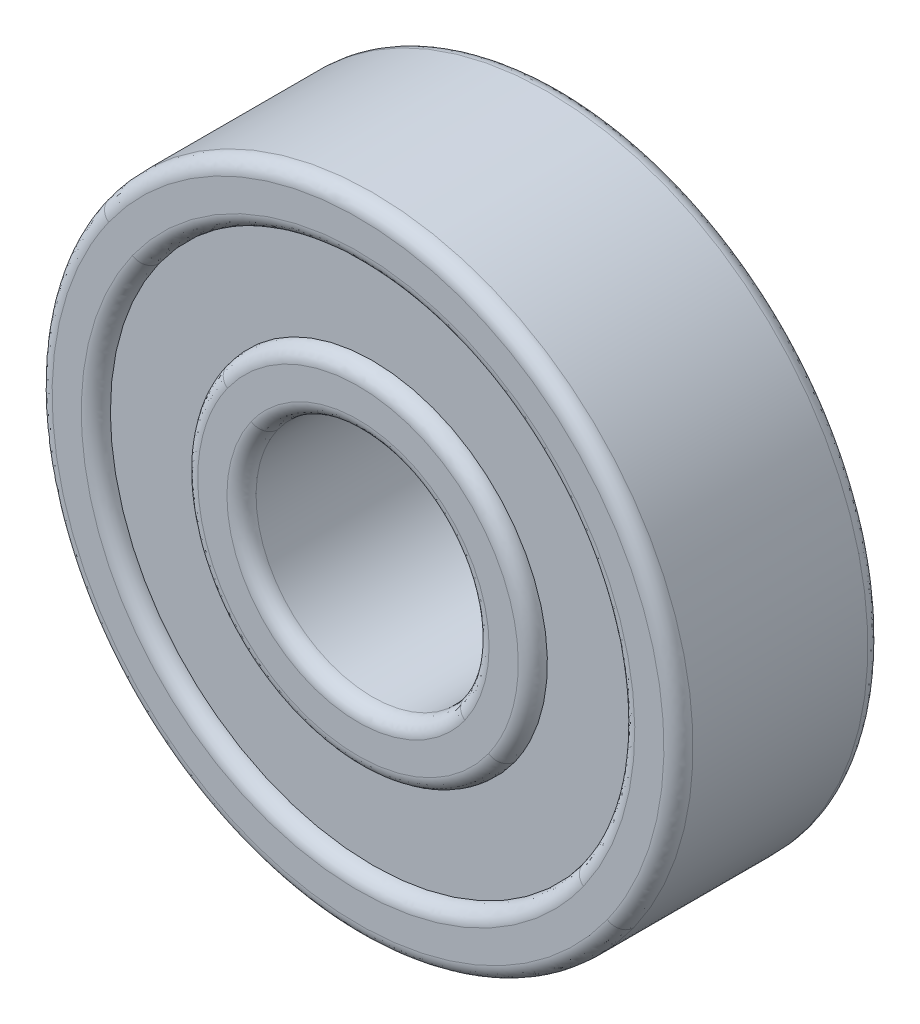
ISO-10303-21;
HEADER;
FILE_DESCRIPTION(('STEP AP214'),'2;1');
FILE_NAME('part.step','',(''),(''),'','','');
FILE_SCHEMA(('AUTOMOTIVE_DESIGN { 1 0 10303 214 1 1 1 1 }'));
ENDSEC;
DATA;
#1=APPLICATION_CONTEXT('core data for automotive mechanical design processes');
#2=APPLICATION_PROTOCOL_DEFINITION('international standard','automotive_design',2000,#1);
#3=PRODUCT_CONTEXT('',#1,'mechanical');
#4=PRODUCT('Part','Part','',(#3));
#5=PRODUCT_RELATED_PRODUCT_CATEGORY('part','',(#4));
#6=PRODUCT_DEFINITION_FORMATION('','',#4);
#7=PRODUCT_DEFINITION_CONTEXT('part definition',#1,'design');
#8=PRODUCT_DEFINITION('design','',#6,#7);
#9=PRODUCT_DEFINITION_SHAPE('','',#8);
#10=(LENGTH_UNIT() NAMED_UNIT(*) SI_UNIT(.MILLI.,.METRE.));
#11=(NAMED_UNIT(*) PLANE_ANGLE_UNIT() SI_UNIT($,.RADIAN.));
#12=(NAMED_UNIT(*) SI_UNIT($,.STERADIAN.) SOLID_ANGLE_UNIT());
#13=UNCERTAINTY_MEASURE_WITH_UNIT(LENGTH_MEASURE(1.E-05),#10,'distance_accuracy_value','');
#14=(GEOMETRIC_REPRESENTATION_CONTEXT(3) GLOBAL_UNCERTAINTY_ASSIGNED_CONTEXT((#13)) GLOBAL_UNIT_ASSIGNED_CONTEXT((#10,
#11,#12)) REPRESENTATION_CONTEXT('',''));
#15=CARTESIAN_POINT('',(0.,0.,0.));
#16=DIRECTION('',(0.,0.,1.));
#17=DIRECTION('',(1.,0.,0.));
#18=AXIS2_PLACEMENT_3D('',#15,#16,#17);
#19=CARTESIAN_POINT('',(20.399651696,212.00166637,-23.5));
#20=CARTESIAN_POINT('',(15.762984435,205.482362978,-23.5));
#21=CARTESIAN_POINT('',(9.243681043,210.119030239,-23.5));
#22=CARTESIAN_POINT('',(13.880348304,216.63833363,-23.5));
#23=CARTESIAN_POINT('',(20.399651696,212.00166637,-23.792893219));
#24=CARTESIAN_POINT('',(15.762984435,205.482362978,-23.792893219));
#25=CARTESIAN_POINT('',(9.243681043,210.119030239,-23.792893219));
#26=CARTESIAN_POINT('',(13.880348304,216.63833363,-23.792893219));
#27=CARTESIAN_POINT('',(20.568425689,211.881630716,-24.));
#28=CARTESIAN_POINT('',(15.69168712,205.024779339,-24.));
#29=CARTESIAN_POINT('',(8.834835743,209.901517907,-24.));
#30=CARTESIAN_POINT('',(13.711574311,216.758369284,-24.));
#31=CARTESIAN_POINT('',(20.807108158,211.711874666,-24.));
#32=CARTESIAN_POINT('',(15.59085749,204.37765835,-24.));
#33=CARTESIAN_POINT('',(8.256641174,209.593909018,-24.));
#34=CARTESIAN_POINT('',(13.472891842,216.928125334,-24.));
#35=(BOUNDED_SURFACE() B_SPLINE_SURFACE(3,3,((#19,#20,#21,#22),(#23,#24,#25,#26),(#27,#28,#29,
#30),(#31,#32,#33,#34)),.UNSPECIFIED.,.F.,.F.,.F.) B_SPLINE_SURFACE_WITH_KNOTS((4,4),(4,4),(0.,
1.),(0.,1.),.UNSPECIFIED.) GEOMETRIC_REPRESENTATION_ITEM() RATIONAL_B_SPLINE_SURFACE(((1.,
0.333333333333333,0.333333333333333,1.),(0.804737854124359,0.268245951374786,0.268245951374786,
0.804737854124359),(0.804737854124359,0.268245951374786,0.268245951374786,0.804737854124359),
(1.,0.333333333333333,0.333333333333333,1.))) REPRESENTATION_ITEM('') SURFACE());
#36=CARTESIAN_POINT('',(13.4728918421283,216.92812533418,-23.5));
#37=DIRECTION('',(0.579583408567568,0.814912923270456,0.));
#38=DIRECTION('',(-0.814912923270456,0.579583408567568,0.));
#39=AXIS2_PLACEMENT_3D('',#36,#37,#38);
#40=CIRCLE('',#39,0.500000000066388);
#41=CARTESIAN_POINT('',(13.8803483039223,216.638333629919,-23.5));
#42=VERTEX_POINT('',#41);
#43=CARTESIAN_POINT('',(13.4728918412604,216.928125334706,-24.0000000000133));
#44=VERTEX_POINT('',#43);
#45=EDGE_CURVE('E109',#42,#44,#40,.T.);
#46=CARTESIAN_POINT('',(17.14,214.32,-23.5));
#47=DIRECTION('',(0.,0.,-1.));
#48=DIRECTION('',(-0.814912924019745,0.579583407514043,0.));
#49=AXIS2_PLACEMENT_3D('',#46,#47,#48);
#50=CIRCLE('',#49,3.99999999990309);
#51=CARTESIAN_POINT('',(20.3996516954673,212.001666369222,-23.5));
#52=VERTEX_POINT('',#51);
#53=EDGE_CURVE('E105',#52,#42,#50,.T.);
#54=CARTESIAN_POINT('',(20.8071081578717,211.71187466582,-23.5));
#55=DIRECTION('',(0.579583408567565,0.814912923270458,0.));
#56=DIRECTION('',(-0.814912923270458,0.579583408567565,0.));
#57=AXIS2_PLACEMENT_3D('',#54,#55,#56);
#58=CIRCLE('',#57,0.50000000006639);
#59=CARTESIAN_POINT('',(20.8071081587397,211.711874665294,-24.0000000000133));
#60=VERTEX_POINT('',#59);
#61=EDGE_CURVE('E107',#60,#52,#58,.T.);
#62=CARTESIAN_POINT('',(20.8071081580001,211.711874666,-24.));
#63=CARTESIAN_POINT('',(20.7795115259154,211.673072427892,-24.));
#64=CARTESIAN_POINT('',(20.7512985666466,211.63470847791,-24.));
#65=CARTESIAN_POINT('',(20.6927553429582,211.557692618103,-24.));
#66=CARTESIAN_POINT('',(20.662386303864,211.519070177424,-24.));
#67=CARTESIAN_POINT('',(20.5994181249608,211.441633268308,-24.));
#68=CARTESIAN_POINT('',(20.5667788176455,211.402851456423,-24.));
#69=CARTESIAN_POINT('',(20.4991574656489,211.325205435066,-24.));
#70=CARTESIAN_POINT('',(20.4641339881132,211.286377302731,-24.));
#71=CARTESIAN_POINT('',(20.3916326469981,211.208763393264,-24.));
#72=CARTESIAN_POINT('',(20.3541122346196,211.170017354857,-24.));
#73=CARTESIAN_POINT('',(20.2765079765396,211.092708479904,-24.));
#74=CARTESIAN_POINT('',(20.2363806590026,211.054189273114,-24.));
#75=CARTESIAN_POINT('',(20.1534578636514,210.97749201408,-24.));
#76=CARTESIAN_POINT('',(20.1106182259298,210.939361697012,-24.));
#77=CARTESIAN_POINT('',(20.0221724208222,210.86361813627,-24.));
#78=CARTESIAN_POINT('',(19.976521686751,210.826056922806,-24.));
#79=CARTESIAN_POINT('',(19.8823639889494,210.751646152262,-24.));
#80=CARTESIAN_POINT('',(19.8338123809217,210.714853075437,-24.));
#81=CARTESIAN_POINT('',(19.7337745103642,210.642192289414,-24.));
#82=CARTESIAN_POINT('',(19.6822439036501,210.606385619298,-24.));
#83=CARTESIAN_POINT('',(19.5761837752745,210.535930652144,-24.));
#84=CARTESIAN_POINT('',(19.5216106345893,210.501348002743,-24.));
#85=CARTESIAN_POINT('',(19.4094184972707,210.433593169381,-24.));
#86=CARTESIAN_POINT('',(19.3517570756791,210.400491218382,-24.));
#87=CARTESIAN_POINT('',(19.2333621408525,210.33596830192,-24.));
#88=CARTESIAN_POINT('',(19.1725879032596,210.304622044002,-24.));
#89=CARTESIAN_POINT('',(19.0479653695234,210.243898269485,-24.));
#90=CARTESIAN_POINT('',(18.984078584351,210.214599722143,-24.));
#91=CARTESIAN_POINT('',(18.853256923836,210.158274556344,-24.));
#92=CARTESIAN_POINT('',(18.7862863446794,210.131330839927,-24.));
#93=CARTESIAN_POINT('',(18.6493546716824,210.08003146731,-24.));
#94=CARTESIAN_POINT('',(18.5793612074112,210.05576218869,-24.));
#95=CARTESIAN_POINT('',(18.436476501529,210.01013753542,-24.));
#96=CARTESIAN_POINT('',(18.3635567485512,209.988871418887,-24.));
#97=CARTESIAN_POINT('',(18.2149506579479,209.949584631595,-24.));
#98=CARTESIAN_POINT('',(18.1392401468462,209.931655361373,-24.));
#99=CARTESIAN_POINT('',(17.9852250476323,209.899374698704,-24.));
#100=CARTESIAN_POINT('',(17.9069010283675,209.885115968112,-24.));
#101=CARTESIAN_POINT('',(17.7478750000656,209.860504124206,-24.));
#102=CARTESIAN_POINT('',(17.6671586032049,209.850243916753,-24.));
#103=CARTESIAN_POINT('',(17.5036088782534,209.83394589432,-24.));
#104=CARTESIAN_POINT('',(17.4207663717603,209.828000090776,-24.));
#105=CARTESIAN_POINT('',(17.2532711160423,209.82062976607,-24.));
#106=CARTESIAN_POINT('',(17.168614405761,209.819295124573,-24.));
#107=CARTESIAN_POINT('',(16.9978415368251,209.821421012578,-24.));
#108=CARTESIAN_POINT('',(16.9117264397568,209.824967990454,-24.));
#109=CARTESIAN_POINT('',(16.7384327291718,209.83709780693,-24.));
#110=CARTESIAN_POINT('',(16.6512598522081,209.845762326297,-24.));
#111=CARTESIAN_POINT('',(16.4762764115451,209.868329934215,-24.));
#112=CARTESIAN_POINT('',(16.3884755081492,209.882308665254,-24.));
#113=CARTESIAN_POINT('',(16.2570838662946,209.90723734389,-24.));
#114=CARTESIAN_POINT('',(16.213119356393,209.916262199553,-24.));
#115=CARTESIAN_POINT('',(16.1252105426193,209.935682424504,-24.));
#116=CARTESIAN_POINT('',(16.0812680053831,209.946085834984,-24.));
#117=CARTESIAN_POINT('',(15.9934679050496,209.9682731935,-24.));
#118=CARTESIAN_POINT('',(15.9496122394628,209.980064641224,-24.));
#119=CARTESIAN_POINT('',(15.8620494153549,210.005034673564,-24.));
#120=CARTESIAN_POINT('',(15.8183442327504,210.018220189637,-24.));
#121=CARTESIAN_POINT('',(15.7311475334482,210.045981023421,-24.));
#122=CARTESIAN_POINT('',(15.6876580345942,210.060562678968,-24.));
#123=CARTESIAN_POINT('',(15.6009583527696,210.091114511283,-24.));
#124=CARTESIAN_POINT('',(15.5577501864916,210.107090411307,-24.));
#125=CARTESIAN_POINT('',(15.4716792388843,210.140425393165,-24.));
#126=CARTESIAN_POINT('',(15.428818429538,210.157789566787,-24.));
#127=CARTESIAN_POINT('',(15.3435083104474,210.193891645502,-24.));
#128=CARTESIAN_POINT('',(15.3010608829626,210.212633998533,-24.));
#129=CARTESIAN_POINT('',(15.2166433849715,210.251478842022,-24.));
#130=CARTESIAN_POINT('',(15.174675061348,210.271585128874,-24.));
#131=CARTESIAN_POINT('',(15.0912810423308,210.313140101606,-24.));
#132=CARTESIAN_POINT('',(15.0498569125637,210.334591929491,-24.));
#133=CARTESIAN_POINT('',(14.9676156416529,210.378816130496,-24.));
#134=CARTESIAN_POINT('',(14.9267998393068,210.401590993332,-24.));
#135=CARTESIAN_POINT('',(14.8458383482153,210.448435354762,-24.));
#136=CARTESIAN_POINT('',(14.8056937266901,210.472506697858,-24.));
#137=CARTESIAN_POINT('',(14.7261361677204,210.521914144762,-24.));
#138=CARTESIAN_POINT('',(14.6867239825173,210.547251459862,-24.));
#139=CARTESIAN_POINT('',(14.608691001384,210.5991571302,-24.));
#140=CARTESIAN_POINT('',(14.570070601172,210.625726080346,-24.));
#141=CARTESIAN_POINT('',(14.4936787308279,210.680057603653,-24.));
#142=CARTESIAN_POINT('',(14.4559072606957,210.707820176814,-24.));
#143=CARTESIAN_POINT('',(14.3812683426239,210.764498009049,-24.));
#144=CARTESIAN_POINT('',(14.3444004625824,210.79341269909,-24.));
#145=CARTESIAN_POINT('',(14.2716211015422,210.852350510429,-24.));
#146=CARTESIAN_POINT('',(14.2357087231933,210.882372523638,-24.));
#147=CARTESIAN_POINT('',(14.1648897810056,210.943477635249,-24.));
#148=CARTESIAN_POINT('',(14.1299818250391,210.97455912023,-24.));
#149=CARTESIAN_POINT('',(14.0612179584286,211.03773298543,-24.));
#150=CARTESIAN_POINT('',(14.0273601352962,211.069823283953,-24.));
#151=CARTESIAN_POINT('',(13.9607393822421,211.13496200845,-24.));
#152=CARTESIAN_POINT('',(13.9279739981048,211.168007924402,-24.));
#153=CARTESIAN_POINT('',(13.8635774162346,211.235002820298,-24.));
#154=CARTESIAN_POINT('',(13.8319432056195,211.268948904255,-24.));
#155=CARTESIAN_POINT('',(13.7698445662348,211.337687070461,-24.));
#156=CARTESIAN_POINT('',(13.7393765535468,211.372475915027,-24.));
#157=CARTESIAN_POINT('',(13.6796420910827,211.442840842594,-24.));
#158=CARTESIAN_POINT('',(13.6503714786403,211.47841339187,-24.));
#159=CARTESIAN_POINT('',(13.5930597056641,211.550285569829,-24.));
#160=CARTESIAN_POINT('',(13.5650138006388,211.586581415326,-24.));
#161=CARTESIAN_POINT('',(13.5101753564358,211.65983899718,-24.));
#162=CARTESIAN_POINT('',(13.4833774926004,211.696796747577,-24.));
#163=CARTESIAN_POINT('',(13.4310551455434,211.77131602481,-24.));
#164=CARTESIAN_POINT('',(13.4055247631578,211.808873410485,-24.));
#165=CARTESIAN_POINT('',(13.3557531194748,211.884530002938,-24.));
#166=CARTESIAN_POINT('',(13.331505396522,211.922624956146,-24.));
#167=CARTESIAN_POINT('',(13.2843119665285,211.999292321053,-24.));
#168=CARTESIAN_POINT('',(13.2613592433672,212.037860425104,-24.));
#169=CARTESIAN_POINT('',(13.1946928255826,212.153794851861,-24.));
#170=CARTESIAN_POINT('',(13.1526749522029,212.232145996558,-24.));
#171=CARTESIAN_POINT('',(13.0739334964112,212.390032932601,-24.));
#172=CARTESIAN_POINT('',(13.0371416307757,212.469534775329,-24.));
#173=CARTESIAN_POINT('',(12.9688144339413,212.629250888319,-24.));
#174=CARTESIAN_POINT('',(12.9372038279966,212.709432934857,-24.));
#175=CARTESIAN_POINT('',(12.8791537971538,212.870050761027,-24.));
#176=CARTESIAN_POINT('',(12.8526330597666,212.950457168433,-24.));
#177=CARTESIAN_POINT('',(12.8046289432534,213.111095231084,-24.));
#178=CARTESIAN_POINT('',(12.7830593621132,213.191301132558,-24.));
#179=CARTESIAN_POINT('',(12.744783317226,213.35114193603,-24.));
#180=CARTESIAN_POINT('',(12.727986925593,213.430755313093,-24.));
#181=CARTESIAN_POINT('',(12.6990488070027,213.589051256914,-24.));
#182=CARTESIAN_POINT('',(12.6868145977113,213.667716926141,-24.));
#183=CARTESIAN_POINT('',(12.6667650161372,213.823796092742,-24.));
#184=CARTESIAN_POINT('',(12.6588557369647,213.901197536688,-24.));
#185=CARTESIAN_POINT('',(12.647199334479,214.0544664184,-24.));
#186=CARTESIAN_POINT('',(12.6433579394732,214.130326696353,-24.));
#187=CARTESIAN_POINT('',(12.6395659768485,214.280270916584,-24.));
#188=CARTESIAN_POINT('',(12.6395217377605,214.354352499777,-24.));
#189=CARTESIAN_POINT('',(12.6430438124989,214.500535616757,-24.));
#190=CARTESIAN_POINT('',(12.646517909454,214.572639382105,-24.));
#191=CARTESIAN_POINT('',(12.6567925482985,214.714700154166,-24.));
#192=CARTESIAN_POINT('',(12.6635030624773,214.784663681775,-24.));
#193=CARTESIAN_POINT('',(12.6799670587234,214.92231210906,-24.));
#194=CARTESIAN_POINT('',(12.6896333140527,214.990007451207,-24.));
#195=CARTESIAN_POINT('',(12.7117297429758,215.123019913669,-24.));
#196=CARTESIAN_POINT('',(12.7240759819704,215.188350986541,-24.));
#197=CARTESIAN_POINT('',(12.7512608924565,215.316564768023,-24.));
#198=CARTESIAN_POINT('',(12.7660192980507,215.379464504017,-24.));
#199=CARTESIAN_POINT('',(12.7977671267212,215.502771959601,-24.));
#200=CARTESIAN_POINT('',(12.8146802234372,215.563199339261,-24.));
#201=CARTESIAN_POINT('',(12.8504880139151,215.681541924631,-24.));
#202=CARTESIAN_POINT('',(12.8693104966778,215.739478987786,-24.));
#203=CARTESIAN_POINT('',(12.9087010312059,215.852841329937,-24.));
#204=CARTESIAN_POINT('',(12.9292010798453,215.908290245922,-24.));
#205=CARTESIAN_POINT('',(12.9717250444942,216.016694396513,-24.));
#206=CARTESIAN_POINT('',(12.9936851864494,216.069674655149,-24.));
#207=CARTESIAN_POINT('',(13.038922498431,216.173174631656,-24.));
#208=CARTESIAN_POINT('',(13.062140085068,216.22372039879,-24.));
#209=CARTESIAN_POINT('',(13.1097005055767,216.32239709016,-24.));
#210=CARTESIAN_POINT('',(13.1339878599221,216.370554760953,-24.));
#211=CARTESIAN_POINT('',(13.1835110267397,216.464511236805,-24.));
#212=CARTESIAN_POINT('',(13.2086953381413,216.510337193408,-24.));
#213=CARTESIAN_POINT('',(13.2598502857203,216.599694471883,-24.));
#214=CARTESIAN_POINT('',(13.2857732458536,216.643253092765,-24.));
#215=CARTESIAN_POINT('',(13.3382576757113,216.728146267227,-24.));
#216=CARTESIAN_POINT('',(13.3647751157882,216.769508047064,-24.));
#217=CARTESIAN_POINT('',(13.4183139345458,216.850083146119,-24.));
#218=CARTESIAN_POINT('',(13.4452947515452,216.889323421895,-24.));
#219=CARTESIAN_POINT('',(13.4728918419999,216.928125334,-24.));
#220=B_SPLINE_CURVE_WITH_KNOTS('',3,(#62,#63,#64,#65,#66,#67,#68,#69,#70,#71,#72,#73,#74,#75,
#76,#77,#78,#79,#80,#81,#82,#83,#84,#85,#86,#87,#88,#89,#90,#91,#92,#93,#94,#95,#96,#97,#98,#99,
#100,#101,#102,#103,#104,#105,#106,#107,#108,#109,#110,#111,#112,#113,#114,#115,#116,#117,#118,
#119,#120,#121,#122,#123,#124,#125,#126,#127,#128,#129,#130,#131,#132,#133,#134,#135,#136,#137,
#138,#139,#140,#141,#142,#143,#144,#145,#146,#147,#148,#149,#150,#151,#152,#153,#154,#155,#156,
#157,#158,#159,#160,#161,#162,#163,#164,#165,#166,#167,#168,#169,#170,#171,#172,#173,#174,#175,
#176,#177,#178,#179,#180,#181,#182,#183,#184,#185,#186,#187,#188,#189,#190,#191,#192,#193,#194,
#195,#196,#197,#198,#199,#200,#201,#202,#203,#204,#205,#206,#207,#208,#209,#210,#211,#212,#213,
#214,#215,#216,#217,#218,#219),.UNSPECIFIED.,.F.,.F.,(4,2,2,2,2,2,2,2,2,2,2,2,2,2,2,2,2,2,2,2,2,
2,2,2,2,2,2,2,2,2,2,2,2,2,2,2,2,2,2,2,2,2,2,2,2,2,2,2,2,2,2,2,2,2,2,2,2,2,2,2,2,2,2,2,2,2,2,2,2,
2,2,2,2,2,2,2,2,2,4),(0.,0.142839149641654,0.29020935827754,0.442246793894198,0.599085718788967,
0.760857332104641,0.927688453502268,1.09970003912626,1.27700552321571,1.45970898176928,
1.64790311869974,1.84166708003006,2.04106410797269,2.24613905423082,2.45691578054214,
2.67339448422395,2.89554899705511,3.12332411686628,3.35663304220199,3.59535499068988,
3.83933309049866,4.08837264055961,4.34223983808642,4.60066107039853,4.86332286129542,
5.12987254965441,5.26449984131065,5.39995016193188,5.53616918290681,5.67310054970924,
5.81068599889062,5.94886548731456,6.08757733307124,6.22675836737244,6.36634409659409,
6.50626887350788,6.64646607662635,6.7868682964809,6.92740752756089,7.06801536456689,
7.20862320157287,7.34916243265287,7.48956465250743,7.62976185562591,7.7696866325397,
7.90927236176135,8.04845339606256,8.18716524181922,8.32534473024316,8.46293017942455,
8.59986154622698,8.73608056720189,8.87153088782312,9.00615817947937,9.27270786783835,
9.53536965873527,9.79379089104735,10.0476580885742,10.2966976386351,10.5406757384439,
10.7793976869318,11.0127066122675,11.2404817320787,11.4626362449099,11.6791149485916,
11.8898916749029,12.0949666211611,12.2943636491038,12.4881276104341,12.6763217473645,
12.8590252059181,13.0363306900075,13.2083422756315,13.3751733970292,13.5369450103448,
13.6937839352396,13.8458213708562,13.9931915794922,14.1360307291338),.UNSPECIFIED.);
#221=EDGE_CURVE('E94',#60,#44,#220,.T.);
#222=ORIENTED_EDGE('',*,*,#45,.F.);
#223=ORIENTED_EDGE('',*,*,#53,.F.);
#224=ORIENTED_EDGE('',*,*,#61,.F.);
#225=ORIENTED_EDGE('',*,*,#221,.T.);
#226=EDGE_LOOP('',(#222,#223,#224,#225));
#227=FACE_BOUND('',#226,.T.);
#228=ADVANCED_FACE('F17',(#227),#35,.T.);
#229=CARTESIAN_POINT('',(13.880348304,216.63833363,-23.5));
#230=CARTESIAN_POINT('',(18.517015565,223.157637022,-23.5));
#231=CARTESIAN_POINT('',(25.036318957,218.520969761,-23.5));
#232=CARTESIAN_POINT('',(20.399651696,212.00166637,-23.5));
#233=CARTESIAN_POINT('',(13.880348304,216.63833363,-23.792893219));
#234=CARTESIAN_POINT('',(18.517015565,223.157637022,-23.792893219));
#235=CARTESIAN_POINT('',(25.036318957,218.520969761,-23.792893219));
#236=CARTESIAN_POINT('',(20.399651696,212.00166637,-23.792893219));
#237=CARTESIAN_POINT('',(13.711574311,216.758369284,-24.));
#238=CARTESIAN_POINT('',(18.58831288,223.615220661,-24.));
#239=CARTESIAN_POINT('',(25.445164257,218.738482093,-24.));
#240=CARTESIAN_POINT('',(20.568425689,211.881630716,-24.));
#241=CARTESIAN_POINT('',(13.472891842,216.928125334,-24.));
#242=CARTESIAN_POINT('',(18.68914251,224.26234165,-24.));
#243=CARTESIAN_POINT('',(26.023358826,219.046090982,-24.));
#244=CARTESIAN_POINT('',(20.807108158,211.711874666,-24.));
#245=(BOUNDED_SURFACE() B_SPLINE_SURFACE(3,3,((#229,#230,#231,#232),(#233,#234,#235,#236),(#237,
#238,#239,#240),(#241,#242,#243,#244)),.UNSPECIFIED.,.F.,.F.,
.F.) B_SPLINE_SURFACE_WITH_KNOTS((4,4),(4,4),(0.,1.),(0.,1.),
.UNSPECIFIED.) GEOMETRIC_REPRESENTATION_ITEM() RATIONAL_B_SPLINE_SURFACE(((1.,0.333333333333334,
0.333333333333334,1.),(0.804737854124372,0.268245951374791,0.268245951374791,0.804737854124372),
(0.804737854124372,0.268245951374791,0.268245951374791,0.804737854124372),(1.,0.333333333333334,
0.333333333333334,1.))) REPRESENTATION_ITEM('') SURFACE());
#246=CARTESIAN_POINT('',(17.14,214.32,-23.5));
#247=DIRECTION('',(0.,0.,-1.));
#248=DIRECTION('',(-0.814912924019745,0.579583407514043,0.));
#249=AXIS2_PLACEMENT_3D('',#246,#247,#248);
#250=CIRCLE('',#249,3.99999999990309);
#251=EDGE_CURVE('E114',#42,#52,#250,.T.);
#252=CARTESIAN_POINT('',(13.4728918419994,216.928125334,-24.));
#253=CARTESIAN_POINT('',(13.5004884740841,216.966927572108,-24.));
#254=CARTESIAN_POINT('',(13.5287014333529,217.00529152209,-24.));
#255=CARTESIAN_POINT('',(13.5872446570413,217.082307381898,-24.));
#256=CARTESIAN_POINT('',(13.6176136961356,217.120929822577,-24.));
#257=CARTESIAN_POINT('',(13.6805818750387,217.198366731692,-24.));
#258=CARTESIAN_POINT('',(13.713221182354,217.237148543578,-24.));
#259=CARTESIAN_POINT('',(13.7808425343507,217.314794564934,-24.));
#260=CARTESIAN_POINT('',(13.8158660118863,217.353622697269,-24.));
#261=CARTESIAN_POINT('',(13.8883673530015,217.431236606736,-24.));
#262=CARTESIAN_POINT('',(13.92588776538,217.469982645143,-24.));
#263=CARTESIAN_POINT('',(14.00349202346,217.547291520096,-24.));
#264=CARTESIAN_POINT('',(14.043619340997,217.585810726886,-24.));
#265=CARTESIAN_POINT('',(14.1265421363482,217.66250798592,-24.));
#266=CARTESIAN_POINT('',(14.1693817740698,217.700638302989,-24.));
#267=CARTESIAN_POINT('',(14.2578275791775,217.77638186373,-24.));
#268=CARTESIAN_POINT('',(14.3034783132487,217.813943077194,-24.));
#269=CARTESIAN_POINT('',(14.3976360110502,217.888353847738,-24.));
#270=CARTESIAN_POINT('',(14.4461876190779,217.925146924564,-24.));
#271=CARTESIAN_POINT('',(14.5462254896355,217.997807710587,-24.));
#272=CARTESIAN_POINT('',(14.5977560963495,218.033614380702,-24.));
#273=CARTESIAN_POINT('',(14.7038162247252,218.104069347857,-24.));
#274=CARTESIAN_POINT('',(14.7583893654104,218.138651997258,-24.));
#275=CARTESIAN_POINT('',(14.870581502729,218.20640683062,-24.));
#276=CARTESIAN_POINT('',(14.9282429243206,218.239508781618,-24.));
#277=CARTESIAN_POINT('',(15.0466378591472,218.304031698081,-24.));
#278=CARTESIAN_POINT('',(15.1074120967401,218.335377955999,-24.));
#279=CARTESIAN_POINT('',(15.2320346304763,218.396101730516,-24.));
#280=CARTESIAN_POINT('',(15.2959214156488,218.425400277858,-24.));
#281=CARTESIAN_POINT('',(15.4267430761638,218.481725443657,-24.));
#282=CARTESIAN_POINT('',(15.4937136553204,218.508669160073,-24.));
#283=CARTESIAN_POINT('',(15.6306453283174,218.559968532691,-24.));
#284=CARTESIAN_POINT('',(15.7006387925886,218.584237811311,-24.));
#285=CARTESIAN_POINT('',(15.8435234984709,218.629862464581,-24.));
#286=CARTESIAN_POINT('',(15.9164432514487,218.651128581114,-24.));
#287=CARTESIAN_POINT('',(16.065049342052,218.690415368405,-24.));
#288=CARTESIAN_POINT('',(16.1407598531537,218.708344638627,-24.));
#289=CARTESIAN_POINT('',(16.2947749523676,218.740625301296,-24.));
#290=CARTESIAN_POINT('',(16.3730989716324,218.754884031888,-24.));
#291=CARTESIAN_POINT('',(16.5321249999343,218.779495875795,-24.));
#292=CARTESIAN_POINT('',(16.612841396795,218.789756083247,-24.));
#293=CARTESIAN_POINT('',(16.7763911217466,218.806054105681,-24.));
#294=CARTESIAN_POINT('',(16.8592336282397,218.811999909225,-24.));
#295=CARTESIAN_POINT('',(17.0267288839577,218.81937023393,-24.));
#296=CARTESIAN_POINT('',(17.111385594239,218.820704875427,-24.));
#297=CARTESIAN_POINT('',(17.282158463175,218.818578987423,-24.));
#298=CARTESIAN_POINT('',(17.3682735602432,218.815032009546,-24.));
#299=CARTESIAN_POINT('',(17.5415672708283,218.802902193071,-24.));
#300=CARTESIAN_POINT('',(17.628740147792,218.794237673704,-24.));
#301=CARTESIAN_POINT('',(17.803723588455,218.771670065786,-24.));
#302=CARTESIAN_POINT('',(17.8915244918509,218.757691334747,-24.));
#303=CARTESIAN_POINT('',(18.0229161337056,218.732762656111,-24.));
#304=CARTESIAN_POINT('',(18.0668806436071,218.723737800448,-24.));
#305=CARTESIAN_POINT('',(18.1547894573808,218.704317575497,-24.));
#306=CARTESIAN_POINT('',(18.1987319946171,218.693914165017,-24.));
#307=CARTESIAN_POINT('',(18.2865320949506,218.6717268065,-24.));
#308=CARTESIAN_POINT('',(18.3303877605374,218.659935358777,-24.));
#309=CARTESIAN_POINT('',(18.4179505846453,218.634965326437,-24.));
#310=CARTESIAN_POINT('',(18.4616557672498,218.621779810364,-24.));
#311=CARTESIAN_POINT('',(18.548852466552,218.594018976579,-24.));
#312=CARTESIAN_POINT('',(18.592341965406,218.579437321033,-24.));
#313=CARTESIAN_POINT('',(18.6790416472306,218.548885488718,-24.));
#314=CARTESIAN_POINT('',(18.7222498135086,218.532909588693,-24.));
#315=CARTESIAN_POINT('',(18.8083207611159,218.499574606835,-24.));
#316=CARTESIAN_POINT('',(18.8511815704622,218.482210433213,-24.));
#317=CARTESIAN_POINT('',(18.9364916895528,218.446108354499,-24.));
#318=CARTESIAN_POINT('',(18.9789391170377,218.427366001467,-24.));
#319=CARTESIAN_POINT('',(19.0633566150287,218.388521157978,-24.));
#320=CARTESIAN_POINT('',(19.1053249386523,218.368414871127,-24.));
#321=CARTESIAN_POINT('',(19.1887189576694,218.326859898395,-24.));
#322=CARTESIAN_POINT('',(19.2301430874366,218.30540807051,-24.));
#323=CARTESIAN_POINT('',(19.3123843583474,218.261183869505,-24.));
#324=CARTESIAN_POINT('',(19.3532001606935,218.238409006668,-24.));
#325=CARTESIAN_POINT('',(19.434161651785,218.191564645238,-24.));
#326=CARTESIAN_POINT('',(19.4743062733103,218.167493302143,-24.));
#327=CARTESIAN_POINT('',(19.5538638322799,218.118085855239,-24.));
#328=CARTESIAN_POINT('',(19.593276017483,218.092748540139,-24.));
#329=CARTESIAN_POINT('',(19.6713089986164,218.040842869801,-24.));
#330=CARTESIAN_POINT('',(19.7099293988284,218.014273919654,-24.));
#331=CARTESIAN_POINT('',(19.7863212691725,217.959942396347,-24.));
#332=CARTESIAN_POINT('',(19.8240927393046,217.932179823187,-24.));
#333=CARTESIAN_POINT('',(19.8987316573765,217.875501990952,-24.));
#334=CARTESIAN_POINT('',(19.935599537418,217.84658730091,-24.));
#335=CARTESIAN_POINT('',(20.0083788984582,217.787649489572,-24.));
#336=CARTESIAN_POINT('',(20.0442912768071,217.757627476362,-24.));
#337=CARTESIAN_POINT('',(20.1151102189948,217.696522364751,-24.));
#338=CARTESIAN_POINT('',(20.1500181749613,217.665440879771,-24.));
#339=CARTESIAN_POINT('',(20.2187820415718,217.60226701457,-24.));
#340=CARTESIAN_POINT('',(20.2526398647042,217.570176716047,-24.));
#341=CARTESIAN_POINT('',(20.3192606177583,217.50503799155,-24.));
#342=CARTESIAN_POINT('',(20.3520260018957,217.471992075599,-24.));
#343=CARTESIAN_POINT('',(20.4164225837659,217.404997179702,-24.));
#344=CARTESIAN_POINT('',(20.448056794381,217.371051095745,-24.));
#345=CARTESIAN_POINT('',(20.5101554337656,217.30231292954,-24.));
#346=CARTESIAN_POINT('',(20.5406234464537,217.267524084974,-24.));
#347=CARTESIAN_POINT('',(20.6003579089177,217.197159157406,-24.));
#348=CARTESIAN_POINT('',(20.6296285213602,217.161586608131,-24.));
#349=CARTESIAN_POINT('',(20.6869402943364,217.089714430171,-24.));
#350=CARTESIAN_POINT('',(20.7149861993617,217.053418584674,-24.));
#351=CARTESIAN_POINT('',(20.7698246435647,216.980161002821,-24.));
#352=CARTESIAN_POINT('',(20.7966225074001,216.943203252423,-24.));
#353=CARTESIAN_POINT('',(20.8489448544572,216.868683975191,-24.));
#354=CARTESIAN_POINT('',(20.8744752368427,216.831126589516,-24.));
#355=CARTESIAN_POINT('',(20.9242468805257,216.755469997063,-24.));
#356=CARTESIAN_POINT('',(20.9484946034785,216.717375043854,-24.));
#357=CARTESIAN_POINT('',(20.995688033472,216.640707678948,-24.));
#358=CARTESIAN_POINT('',(21.0186407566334,216.602139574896,-24.));
#359=CARTESIAN_POINT('',(21.0853071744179,216.486205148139,-24.));
#360=CARTESIAN_POINT('',(21.1273250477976,216.407854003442,-24.));
#361=CARTESIAN_POINT('',(21.2060665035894,216.249967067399,-24.));
#362=CARTESIAN_POINT('',(21.2428583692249,216.170465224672,-24.));
#363=CARTESIAN_POINT('',(21.3111855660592,216.010749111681,-24.));
#364=CARTESIAN_POINT('',(21.3427961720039,215.930567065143,-24.));
#365=CARTESIAN_POINT('',(21.4008462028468,215.769949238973,-24.));
#366=CARTESIAN_POINT('',(21.427366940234,215.689542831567,-24.));
#367=CARTESIAN_POINT('',(21.4753710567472,215.528904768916,-24.));
#368=CARTESIAN_POINT('',(21.4969406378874,215.448698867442,-24.));
#369=CARTESIAN_POINT('',(21.5352166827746,215.28885806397,-24.));
#370=CARTESIAN_POINT('',(21.5520130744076,215.209244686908,-24.));
#371=CARTESIAN_POINT('',(21.5809511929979,215.050948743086,-24.));
#372=CARTESIAN_POINT('',(21.5931854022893,214.972283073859,-24.));
#373=CARTESIAN_POINT('',(21.6132349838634,214.816203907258,-24.));
#374=CARTESIAN_POINT('',(21.6211442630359,214.738802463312,-24.));
#375=CARTESIAN_POINT('',(21.6328006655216,214.5855335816,-24.));
#376=CARTESIAN_POINT('',(21.6366420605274,214.509673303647,-24.));
#377=CARTESIAN_POINT('',(21.6404340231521,214.359729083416,-24.));
#378=CARTESIAN_POINT('',(21.6404782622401,214.285647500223,-24.));
#379=CARTESIAN_POINT('',(21.6369561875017,214.139464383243,-24.));
#380=CARTESIAN_POINT('',(21.6334820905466,214.067360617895,-24.));
#381=CARTESIAN_POINT('',(21.6232074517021,213.925299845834,-24.));
#382=CARTESIAN_POINT('',(21.6164969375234,213.855336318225,-24.));
#383=CARTESIAN_POINT('',(21.6000329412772,213.71768789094,-24.));
#384=CARTESIAN_POINT('',(21.5903666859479,213.649992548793,-24.));
#385=CARTESIAN_POINT('',(21.5682702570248,213.516980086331,-24.));
#386=CARTESIAN_POINT('',(21.5559240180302,213.451649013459,-24.));
#387=CARTESIAN_POINT('',(21.5287391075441,213.323435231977,-24.));
#388=CARTESIAN_POINT('',(21.5139807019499,213.260535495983,-24.));
#389=CARTESIAN_POINT('',(21.4822328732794,213.137228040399,-24.));
#390=CARTESIAN_POINT('',(21.4653197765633,213.076800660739,-24.));
#391=CARTESIAN_POINT('',(21.4295119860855,212.958458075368,-24.));
#392=CARTESIAN_POINT('',(21.4106895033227,212.900521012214,-24.));
#393=CARTESIAN_POINT('',(21.3712989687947,212.787158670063,-24.));
#394=CARTESIAN_POINT('',(21.3507989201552,212.731709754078,-24.));
#395=CARTESIAN_POINT('',(21.3082749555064,212.623305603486,-24.));
#396=CARTESIAN_POINT('',(21.2863148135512,212.57032534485,-24.));
#397=CARTESIAN_POINT('',(21.2410775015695,212.466825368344,-24.));
#398=CARTESIAN_POINT('',(21.2178599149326,212.416279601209,-24.));
#399=CARTESIAN_POINT('',(21.1702994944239,212.317602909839,-24.));
#400=CARTESIAN_POINT('',(21.1460121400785,212.269445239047,-24.));
#401=CARTESIAN_POINT('',(21.0964889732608,212.175488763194,-24.));
#402=CARTESIAN_POINT('',(21.0713046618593,212.129662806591,-24.));
#403=CARTESIAN_POINT('',(21.0201497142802,212.040305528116,-24.));
#404=CARTESIAN_POINT('',(20.994226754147,211.996746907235,-24.));
#405=CARTESIAN_POINT('',(20.9417423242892,211.911853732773,-24.));
#406=CARTESIAN_POINT('',(20.9152248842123,211.870491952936,-24.));
#407=CARTESIAN_POINT('',(20.8616860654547,211.789916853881,-24.));
#408=CARTESIAN_POINT('',(20.8347052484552,211.750676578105,-24.));
#409=CARTESIAN_POINT('',(20.8071081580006,211.711874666,-24.));
#410=B_SPLINE_CURVE_WITH_KNOTS('',3,(#252,#253,#254,#255,#256,#257,#258,#259,#260,#261,#262,
#263,#264,#265,#266,#267,#268,#269,#270,#271,#272,#273,#274,#275,#276,#277,#278,#279,#280,#281,
#282,#283,#284,#285,#286,#287,#288,#289,#290,#291,#292,#293,#294,#295,#296,#297,#298,#299,#300,
#301,#302,#303,#304,#305,#306,#307,#308,#309,#310,#311,#312,#313,#314,#315,#316,#317,#318,#319,
#320,#321,#322,#323,#324,#325,#326,#327,#328,#329,#330,#331,#332,#333,#334,#335,#336,#337,#338,
#339,#340,#341,#342,#343,#344,#345,#346,#347,#348,#349,#350,#351,#352,#353,#354,#355,#356,#357,
#358,#359,#360,#361,#362,#363,#364,#365,#366,#367,#368,#369,#370,#371,#372,#373,#374,#375,#376,
#377,#378,#379,#380,#381,#382,#383,#384,#385,#386,#387,#388,#389,#390,#391,#392,#393,#394,#395,
#396,#397,#398,#399,#400,#401,#402,#403,#404,#405,#406,#407,#408,#409),.UNSPECIFIED.,.F.,.F.,(4,
2,2,2,2,2,2,2,2,2,2,2,2,2,2,2,2,2,2,2,2,2,2,2,2,2,2,2,2,2,2,2,2,2,2,2,2,2,2,2,2,2,2,2,2,2,2,2,2,
2,2,2,2,2,2,2,2,2,2,2,2,2,2,2,2,2,2,2,2,2,2,2,2,2,2,2,2,2,4),(0.,0.14283914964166,
0.290209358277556,0.442246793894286,0.599085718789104,0.760857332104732,0.927688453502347,
1.0997000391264,1.27700552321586,1.45970898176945,1.64790311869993,1.84166708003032,
2.04106410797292,2.24613905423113,2.45691578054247,2.67339448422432,2.8955489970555,
3.12332411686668,3.35663304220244,3.59535499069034,3.83933309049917,4.08837264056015,
4.34223983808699,4.60066107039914,4.86332286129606,5.12987254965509,5.26449984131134,
5.39995016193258,5.53616918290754,5.67310054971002,5.8106859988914,5.94886548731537,
6.08757733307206,6.22675836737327,6.36634409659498,6.50626887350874,6.64646607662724,
6.78686829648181,6.92740752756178,7.06801536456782,7.20862320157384,7.34916243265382,
7.48956465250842,7.62976185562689,7.76968663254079,7.90927236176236,8.04845339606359,
8.18716524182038,8.32534473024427,8.46293017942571,8.5998615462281,8.73608056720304,
8.8715308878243,9.00615817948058,9.27270786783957,9.53536965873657,9.7937908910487,
10.0476580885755,10.2966976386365,10.5406757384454,10.7793976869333,11.0127066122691,
11.2404817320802,11.4626362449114,11.6791149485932,11.8898916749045,12.0949666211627,
12.2943636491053,12.4881276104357,12.6763217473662,12.8590252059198,13.0363306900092,
13.2083422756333,13.3751733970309,13.5369450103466,13.6937839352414,13.8458213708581,
13.993191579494,14.1360307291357),.UNSPECIFIED.);
#411=EDGE_CURVE('E119',#44,#60,#410,.T.);
#412=ORIENTED_EDGE('',*,*,#251,.F.);
#413=ORIENTED_EDGE('',*,*,#45,.T.);
#414=ORIENTED_EDGE('',*,*,#411,.T.);
#415=ORIENTED_EDGE('',*,*,#61,.T.);
#416=EDGE_LOOP('',(#412,#413,#414,#415));
#417=FACE_BOUND('',#416,.T.);
#418=ADVANCED_FACE('F117',(#417),#245,.T.);
#419=CARTESIAN_POINT('',(17.14,214.32,-17.5));
#420=DIRECTION('',(0.,0.,-1.));
#421=DIRECTION('',(-1.,0.,0.));
#422=AXIS2_PLACEMENT_3D('',#419,#420,#421);
#423=CYLINDRICAL_SURFACE('',#422,3.99999999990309);
#424=CARTESIAN_POINT('',(17.14,214.32,-17.5));
#425=DIRECTION('',(0.,0.,-1.));
#426=DIRECTION('',(-1.,0.,0.));
#427=AXIS2_PLACEMENT_3D('',#424,#425,#426);
#428=CIRCLE('',#427,3.99999999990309);
#429=CARTESIAN_POINT('',(20.3996516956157,212.001666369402,-17.5));
#430=VERTEX_POINT('',#429);
#431=CARTESIAN_POINT('',(13.8803483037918,216.638333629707,-17.5));
#432=VERTEX_POINT('',#431);
#433=EDGE_CURVE('E22',#430,#432,#428,.T.);
#434=ORIENTED_EDGE('',*,*,#433,.F.);
#435=CARTESIAN_POINT('',(17.14,214.32,-17.5));
#436=DIRECTION('',(0.,0.,-1.));
#437=DIRECTION('',(-1.,0.,0.));
#438=AXIS2_PLACEMENT_3D('',#435,#436,#437);
#439=CIRCLE('',#438,3.99999999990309);
#440=EDGE_CURVE('E86',#432,#430,#439,.T.);
#441=ORIENTED_EDGE('',*,*,#440,.F.);
#442=EDGE_LOOP('',(#434,#441));
#443=FACE_BOUND('',#442,.T.);
#444=ORIENTED_EDGE('',*,*,#251,.T.);
#445=ORIENTED_EDGE('',*,*,#53,.T.);
#446=EDGE_LOOP('',(#444,#445));
#447=FACE_BOUND('',#446,.T.);
#448=ADVANCED_FACE('F123',(#443,#447),#423,.F.);
#449=CARTESIAN_POINT('',(9.378233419,213.010155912,-24.));
#450=DIRECTION('',(0.,0.,1.));
#451=DIRECTION('',(0.814912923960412,-0.579583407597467,0.));
#452=AXIS2_PLACEMENT_3D('',#449,#450,#451);
#453=PLANE('',#452);
#454=ORIENTED_EDGE('',*,*,#221,.F.);
#455=ORIENTED_EDGE('',*,*,#411,.F.);
#456=EDGE_LOOP('',(#454,#455));
#457=FACE_BOUND('',#456,.T.);
#458=CARTESIAN_POINT('',(12.657978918,217.507708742,-24.));
#459=CARTESIAN_POINT('',(6.282561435,208.543666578,-24.));
#460=CARTESIAN_POINT('',(15.246603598,202.168249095,-24.));
#461=CARTESIAN_POINT('',(21.622021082,211.132291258,-24.));
#462=(BOUNDED_CURVE() B_SPLINE_CURVE(3,(#458,#459,#460,#461),.UNSPECIFIED.,.F.,
.F.) B_SPLINE_CURVE_WITH_KNOTS((4,4),(0.,1.),
.UNSPECIFIED.) CURVE() GEOMETRIC_REPRESENTATION_ITEM() RATIONAL_B_SPLINE_CURVE((1.,
0.333333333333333,0.333333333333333,1.)) REPRESENTATION_ITEM(''));
#463=CARTESIAN_POINT('',(12.6579789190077,217.507708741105,-23.9999999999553));
#464=VERTEX_POINT('',#463);
#465=CARTESIAN_POINT('',(21.6220210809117,211.132291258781,-23.9999999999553));
#466=VERTEX_POINT('',#465);
#467=EDGE_CURVE('E658',#464,#466,#462,.T.);
#468=ORIENTED_EDGE('',*,*,#467,.F.);
#469=CARTESIAN_POINT('',(21.622021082,211.132291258,-24.));
#470=CARTESIAN_POINT('',(27.997438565,220.096333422,-24.));
#471=CARTESIAN_POINT('',(19.033396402,226.471750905,-24.));
#472=CARTESIAN_POINT('',(12.657978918,217.507708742,-24.));
#473=(BOUNDED_CURVE() B_SPLINE_CURVE(3,(#469,#470,#471,#472),.UNSPECIFIED.,.F.,
.F.) B_SPLINE_CURVE_WITH_KNOTS((4,4),(0.,1.),
.UNSPECIFIED.) CURVE() GEOMETRIC_REPRESENTATION_ITEM() RATIONAL_B_SPLINE_CURVE((1.,
0.333333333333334,0.333333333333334,1.)) REPRESENTATION_ITEM(''));
#474=EDGE_CURVE('E181',#466,#464,#473,.T.);
#475=ORIENTED_EDGE('',*,*,#474,.F.);
#476=EDGE_LOOP('',(#468,#475));
#477=FACE_BOUND('',#476,.T.);
#478=ADVANCED_FACE('F142',(#457,#477),#453,.F.);
#479=CARTESIAN_POINT('',(20.807108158,211.711874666,-17.));
#480=CARTESIAN_POINT('',(15.59085749,204.37765835,-17.));
#481=CARTESIAN_POINT('',(8.256641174,209.593909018,-17.));
#482=CARTESIAN_POINT('',(13.472891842,216.928125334,-17.));
#483=CARTESIAN_POINT('',(20.568425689,211.881630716,-17.));
#484=CARTESIAN_POINT('',(15.69168712,205.024779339,-17.));
#485=CARTESIAN_POINT('',(8.834835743,209.901517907,-17.));
#486=CARTESIAN_POINT('',(13.711574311,216.758369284,-17.));
#487=CARTESIAN_POINT('',(20.399651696,212.00166637,-17.207106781));
#488=CARTESIAN_POINT('',(15.762984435,205.482362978,-17.207106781));
#489=CARTESIAN_POINT('',(9.243681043,210.119030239,-17.207106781));
#490=CARTESIAN_POINT('',(13.880348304,216.63833363,-17.207106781));
#491=CARTESIAN_POINT('',(20.399651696,212.00166637,-17.5));
#492=CARTESIAN_POINT('',(15.762984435,205.482362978,-17.5));
#493=CARTESIAN_POINT('',(9.243681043,210.119030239,-17.5));
#494=CARTESIAN_POINT('',(13.880348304,216.63833363,-17.5));
#495=(BOUNDED_SURFACE() B_SPLINE_SURFACE(3,3,((#479,#480,#481,#482),(#483,#484,#485,#486),(#487,
#488,#489,#490),(#491,#492,#493,#494)),.UNSPECIFIED.,.F.,.F.,
.F.) B_SPLINE_SURFACE_WITH_KNOTS((4,4),(4,4),(0.,1.),(0.,1.),
.UNSPECIFIED.) GEOMETRIC_REPRESENTATION_ITEM() RATIONAL_B_SPLINE_SURFACE(((1.,0.333333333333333,
0.333333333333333,1.),(0.80473785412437,0.26824595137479,0.26824595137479,0.80473785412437),
(0.80473785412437,0.26824595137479,0.26824595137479,0.80473785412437),(1.,0.333333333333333,
0.333333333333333,1.))) REPRESENTATION_ITEM('') SURFACE());
#496=CARTESIAN_POINT('',(13.4728918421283,216.92812533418,-17.5));
#497=DIRECTION('',(0.579583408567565,0.814912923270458,0.));
#498=DIRECTION('',(-0.814912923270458,0.579583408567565,0.));
#499=AXIS2_PLACEMENT_3D('',#496,#497,#498);
#500=CIRCLE('',#499,0.500000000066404);
#501=CARTESIAN_POINT('',(13.4728918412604,216.928125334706,-16.9999999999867));
#502=VERTEX_POINT('',#501);
#503=EDGE_CURVE('E661',#502,#432,#500,.T.);
#504=CARTESIAN_POINT('',(13.4728918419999,216.928125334,-17.));
#505=CARTESIAN_POINT('',(13.4452947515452,216.889323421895,-17.));
#506=CARTESIAN_POINT('',(13.4183139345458,216.850083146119,-17.));
#507=CARTESIAN_POINT('',(13.3647751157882,216.769508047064,-17.));
#508=CARTESIAN_POINT('',(13.3382576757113,216.728146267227,-17.));
#509=CARTESIAN_POINT('',(13.2857732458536,216.643253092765,-17.));
#510=CARTESIAN_POINT('',(13.2598502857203,216.599694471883,-17.));
#511=CARTESIAN_POINT('',(13.2086953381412,216.510337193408,-17.));
#512=CARTESIAN_POINT('',(13.1835110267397,216.464511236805,-17.));
#513=CARTESIAN_POINT('',(13.1339878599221,216.370554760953,-17.));
#514=CARTESIAN_POINT('',(13.1097005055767,216.32239709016,-17.));
#515=CARTESIAN_POINT('',(13.062140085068,216.22372039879,-17.));
#516=CARTESIAN_POINT('',(13.038922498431,216.173174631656,-17.));
#517=CARTESIAN_POINT('',(12.9936851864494,216.069674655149,-17.));
#518=CARTESIAN_POINT('',(12.9717250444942,216.016694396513,-17.));
#519=CARTESIAN_POINT('',(12.9292010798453,215.908290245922,-17.));
#520=CARTESIAN_POINT('',(12.9087010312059,215.852841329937,-17.));
#521=CARTESIAN_POINT('',(12.8693104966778,215.739478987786,-17.));
#522=CARTESIAN_POINT('',(12.8504880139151,215.681541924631,-17.));
#523=CARTESIAN_POINT('',(12.8146802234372,215.563199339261,-17.));
#524=CARTESIAN_POINT('',(12.7977671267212,215.502771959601,-17.));
#525=CARTESIAN_POINT('',(12.7660192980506,215.379464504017,-17.));
#526=CARTESIAN_POINT('',(12.7512608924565,215.316564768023,-17.));
#527=CARTESIAN_POINT('',(12.7240759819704,215.188350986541,-17.));
#528=CARTESIAN_POINT('',(12.7117297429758,215.123019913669,-17.));
#529=CARTESIAN_POINT('',(12.6896333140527,214.990007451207,-17.));
#530=CARTESIAN_POINT('',(12.6799670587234,214.92231210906,-17.));
#531=CARTESIAN_POINT('',(12.6635030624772,214.784663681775,-17.));
#532=CARTESIAN_POINT('',(12.6567925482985,214.714700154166,-17.));
#533=CARTESIAN_POINT('',(12.646517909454,214.572639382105,-17.));
#534=CARTESIAN_POINT('',(12.6430438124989,214.500535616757,-17.));
#535=CARTESIAN_POINT('',(12.6395217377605,214.354352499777,-17.));
#536=CARTESIAN_POINT('',(12.6395659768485,214.280270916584,-17.));
#537=CARTESIAN_POINT('',(12.6433579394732,214.130326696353,-17.));
#538=CARTESIAN_POINT('',(12.647199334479,214.0544664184,-17.));
#539=CARTESIAN_POINT('',(12.6588557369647,213.901197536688,-17.));
#540=CARTESIAN_POINT('',(12.6667650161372,213.823796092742,-17.));
#541=CARTESIAN_POINT('',(12.6868145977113,213.667716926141,-17.));
#542=CARTESIAN_POINT('',(12.6990488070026,213.589051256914,-17.));
#543=CARTESIAN_POINT('',(12.727986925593,213.430755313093,-17.));
#544=CARTESIAN_POINT('',(12.744783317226,213.35114193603,-17.));
#545=CARTESIAN_POINT('',(12.7830593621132,213.191301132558,-17.));
#546=CARTESIAN_POINT('',(12.8046289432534,213.111095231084,-17.));
#547=CARTESIAN_POINT('',(12.8526330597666,212.950457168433,-17.));
#548=CARTESIAN_POINT('',(12.8791537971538,212.870050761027,-17.));
#549=CARTESIAN_POINT('',(12.9372038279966,212.709432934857,-17.));
#550=CARTESIAN_POINT('',(12.9688144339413,212.629250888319,-17.));
#551=CARTESIAN_POINT('',(13.0371416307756,212.469534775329,-17.));
#552=CARTESIAN_POINT('',(13.0739334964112,212.390032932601,-17.));
#553=CARTESIAN_POINT('',(13.1526749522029,212.232145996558,-17.));
#554=CARTESIAN_POINT('',(13.1946928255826,212.153794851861,-17.));
#555=CARTESIAN_POINT('',(13.2613592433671,212.037860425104,-17.));
#556=CARTESIAN_POINT('',(13.2843119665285,211.999292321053,-17.));
#557=CARTESIAN_POINT('',(13.331505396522,211.922624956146,-17.));
#558=CARTESIAN_POINT('',(13.3557531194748,211.884530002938,-17.));
#559=CARTESIAN_POINT('',(13.4055247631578,211.808873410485,-17.));
#560=CARTESIAN_POINT('',(13.4310551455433,211.77131602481,-17.));
#561=CARTESIAN_POINT('',(13.4833774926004,211.696796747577,-17.));
#562=CARTESIAN_POINT('',(13.5101753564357,211.65983899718,-17.));
#563=CARTESIAN_POINT('',(13.5650138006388,211.586581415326,-17.));
#564=CARTESIAN_POINT('',(13.5930597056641,211.550285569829,-17.));
#565=CARTESIAN_POINT('',(13.6503714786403,211.47841339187,-17.));
#566=CARTESIAN_POINT('',(13.6796420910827,211.442840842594,-17.));
#567=CARTESIAN_POINT('',(13.7393765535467,211.372475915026,-17.));
#568=CARTESIAN_POINT('',(13.7698445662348,211.337687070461,-17.));
#569=CARTESIAN_POINT('',(13.8319432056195,211.268948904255,-17.));
#570=CARTESIAN_POINT('',(13.8635774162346,211.235002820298,-17.));
#571=CARTESIAN_POINT('',(13.9279739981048,211.168007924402,-17.));
#572=CARTESIAN_POINT('',(13.9607393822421,211.13496200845,-17.));
#573=CARTESIAN_POINT('',(14.0273601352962,211.069823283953,-17.));
#574=CARTESIAN_POINT('',(14.0612179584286,211.03773298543,-17.));
#575=CARTESIAN_POINT('',(14.1299818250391,210.97455912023,-17.));
#576=CARTESIAN_POINT('',(14.1648897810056,210.943477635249,-17.));
#577=CARTESIAN_POINT('',(14.2357087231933,210.882372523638,-17.));
#578=CARTESIAN_POINT('',(14.2716211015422,210.852350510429,-17.));
#579=CARTESIAN_POINT('',(14.3444004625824,210.79341269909,-17.));
#580=CARTESIAN_POINT('',(14.3812683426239,210.764498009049,-17.));
#581=CARTESIAN_POINT('',(14.4559072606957,210.707820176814,-17.));
#582=CARTESIAN_POINT('',(14.4936787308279,210.680057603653,-17.));
#583=CARTESIAN_POINT('',(14.570070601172,210.625726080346,-17.));
#584=CARTESIAN_POINT('',(14.608691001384,210.5991571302,-17.));
#585=CARTESIAN_POINT('',(14.6867239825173,210.547251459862,-17.));
#586=CARTESIAN_POINT('',(14.7261361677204,210.521914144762,-17.));
#587=CARTESIAN_POINT('',(14.8056937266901,210.472506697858,-17.));
#588=CARTESIAN_POINT('',(14.8458383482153,210.448435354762,-17.));
#589=CARTESIAN_POINT('',(14.9267998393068,210.401590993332,-17.));
#590=CARTESIAN_POINT('',(14.9676156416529,210.378816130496,-17.));
#591=CARTESIAN_POINT('',(15.0498569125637,210.334591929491,-17.));
#592=CARTESIAN_POINT('',(15.0912810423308,210.313140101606,-17.));
#593=CARTESIAN_POINT('',(15.174675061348,210.271585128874,-17.));
#594=CARTESIAN_POINT('',(15.2166433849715,210.251478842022,-17.));
#595=CARTESIAN_POINT('',(15.3010608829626,210.212633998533,-17.));
#596=CARTESIAN_POINT('',(15.3435083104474,210.193891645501,-17.));
#597=CARTESIAN_POINT('',(15.428818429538,210.157789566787,-17.));
#598=CARTESIAN_POINT('',(15.4716792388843,210.140425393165,-17.));
#599=CARTESIAN_POINT('',(15.5577501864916,210.107090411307,-17.));
#600=CARTESIAN_POINT('',(15.6009583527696,210.091114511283,-17.));
#601=CARTESIAN_POINT('',(15.6876580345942,210.060562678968,-17.));
#602=CARTESIAN_POINT('',(15.7311475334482,210.045981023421,-17.));
#603=CARTESIAN_POINT('',(15.8183442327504,210.018220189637,-17.));
#604=CARTESIAN_POINT('',(15.8620494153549,210.005034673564,-17.));
#605=CARTESIAN_POINT('',(15.9496122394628,209.980064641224,-17.));
#606=CARTESIAN_POINT('',(15.9934679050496,209.9682731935,-17.));
#607=CARTESIAN_POINT('',(16.0812680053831,209.946085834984,-17.));
#608=CARTESIAN_POINT('',(16.1252105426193,209.935682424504,-17.));
#609=CARTESIAN_POINT('',(16.213119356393,209.916262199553,-17.));
#610=CARTESIAN_POINT('',(16.2570838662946,209.90723734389,-17.));
#611=CARTESIAN_POINT('',(16.3884755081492,209.882308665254,-17.));
#612=CARTESIAN_POINT('',(16.4762764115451,209.868329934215,-17.));
#613=CARTESIAN_POINT('',(16.6512598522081,209.845762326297,-17.));
#614=CARTESIAN_POINT('',(16.7384327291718,209.83709780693,-17.));
#615=CARTESIAN_POINT('',(16.9117264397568,209.824967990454,-17.));
#616=CARTESIAN_POINT('',(16.9978415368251,209.821421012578,-17.));
#617=CARTESIAN_POINT('',(17.168614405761,209.819295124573,-17.));
#618=CARTESIAN_POINT('',(17.2532711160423,209.82062976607,-17.));
#619=CARTESIAN_POINT('',(17.4207663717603,209.828000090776,-17.));
#620=CARTESIAN_POINT('',(17.5036088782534,209.83394589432,-17.));
#621=CARTESIAN_POINT('',(17.6671586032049,209.850243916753,-17.));
#622=CARTESIAN_POINT('',(17.7478750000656,209.860504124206,-17.));
#623=CARTESIAN_POINT('',(17.9069010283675,209.885115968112,-17.));
#624=CARTESIAN_POINT('',(17.9852250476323,209.899374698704,-17.));
#625=CARTESIAN_POINT('',(18.1392401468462,209.931655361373,-17.));
#626=CARTESIAN_POINT('',(18.2149506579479,209.949584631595,-17.));
#627=CARTESIAN_POINT('',(18.3635567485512,209.988871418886,-17.));
#628=CARTESIAN_POINT('',(18.436476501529,210.01013753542,-17.));
#629=CARTESIAN_POINT('',(18.5793612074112,210.05576218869,-17.));
#630=CARTESIAN_POINT('',(18.6493546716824,210.08003146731,-17.));
#631=CARTESIAN_POINT('',(18.7862863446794,210.131330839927,-17.));
#632=CARTESIAN_POINT('',(18.853256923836,210.158274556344,-17.));
#633=CARTESIAN_POINT('',(18.984078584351,210.214599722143,-17.));
#634=CARTESIAN_POINT('',(19.0479653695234,210.243898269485,-17.));
#635=CARTESIAN_POINT('',(19.1725879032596,210.304622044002,-17.));
#636=CARTESIAN_POINT('',(19.2333621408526,210.33596830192,-17.));
#637=CARTESIAN_POINT('',(19.3517570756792,210.400491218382,-17.));
#638=CARTESIAN_POINT('',(19.4094184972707,210.433593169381,-17.));
#639=CARTESIAN_POINT('',(19.5216106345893,210.501348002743,-17.));
#640=CARTESIAN_POINT('',(19.5761837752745,210.535930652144,-17.));
#641=CARTESIAN_POINT('',(19.6822439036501,210.606385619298,-17.));
#642=CARTESIAN_POINT('',(19.7337745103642,210.642192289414,-17.));
#643=CARTESIAN_POINT('',(19.8338123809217,210.714853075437,-17.));
#644=CARTESIAN_POINT('',(19.8823639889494,210.751646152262,-17.));
#645=CARTESIAN_POINT('',(19.976521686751,210.826056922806,-17.));
#646=CARTESIAN_POINT('',(20.0221724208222,210.86361813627,-17.));
#647=CARTESIAN_POINT('',(20.1106182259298,210.939361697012,-17.));
#648=CARTESIAN_POINT('',(20.1534578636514,210.97749201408,-17.));
#649=CARTESIAN_POINT('',(20.2363806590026,211.054189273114,-17.));
#650=CARTESIAN_POINT('',(20.2765079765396,211.092708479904,-17.));
#651=CARTESIAN_POINT('',(20.3541122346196,211.170017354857,-17.));
#652=CARTESIAN_POINT('',(20.3916326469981,211.208763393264,-17.));
#653=CARTESIAN_POINT('',(20.4641339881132,211.286377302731,-17.));
#654=CARTESIAN_POINT('',(20.4991574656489,211.325205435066,-17.));
#655=CARTESIAN_POINT('',(20.5667788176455,211.402851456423,-17.));
#656=CARTESIAN_POINT('',(20.5994181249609,211.441633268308,-17.));
#657=CARTESIAN_POINT('',(20.662386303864,211.519070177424,-17.));
#658=CARTESIAN_POINT('',(20.6927553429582,211.557692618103,-17.));
#659=CARTESIAN_POINT('',(20.7512985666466,211.63470847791,-17.));
#660=CARTESIAN_POINT('',(20.7795115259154,211.673072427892,-17.));
#661=CARTESIAN_POINT('',(20.8071081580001,211.711874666,-17.));
#662=B_SPLINE_CURVE_WITH_KNOTS('',3,(#504,#505,#506,#507,#508,#509,#510,#511,#512,#513,#514,
#515,#516,#517,#518,#519,#520,#521,#522,#523,#524,#525,#526,#527,#528,#529,#530,#531,#532,#533,
#534,#535,#536,#537,#538,#539,#540,#541,#542,#543,#544,#545,#546,#547,#548,#549,#550,#551,#552,
#553,#554,#555,#556,#557,#558,#559,#560,#561,#562,#563,#564,#565,#566,#567,#568,#569,#570,#571,
#572,#573,#574,#575,#576,#577,#578,#579,#580,#581,#582,#583,#584,#585,#586,#587,#588,#589,#590,
#591,#592,#593,#594,#595,#596,#597,#598,#599,#600,#601,#602,#603,#604,#605,#606,#607,#608,#609,
#610,#611,#612,#613,#614,#615,#616,#617,#618,#619,#620,#621,#622,#623,#624,#625,#626,#627,#628,
#629,#630,#631,#632,#633,#634,#635,#636,#637,#638,#639,#640,#641,#642,#643,#644,#645,#646,#647,
#648,#649,#650,#651,#652,#653,#654,#655,#656,#657,#658,#659,#660,#661),.UNSPECIFIED.,.F.,.F.,(4,
2,2,2,2,2,2,2,2,2,2,2,2,2,2,2,2,2,2,2,2,2,2,2,2,2,2,2,2,2,2,2,2,2,2,2,2,2,2,2,2,2,2,2,2,2,2,2,2,
2,2,2,2,2,2,2,2,2,2,2,2,2,2,2,2,2,2,2,2,2,2,2,2,2,2,2,2,2,4),(0.,0.142839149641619,
0.290209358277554,0.442246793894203,0.599085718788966,0.760857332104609,0.927688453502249,
1.09970003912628,1.2770055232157,1.45970898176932,1.64790311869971,1.84166708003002,
2.04106410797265,2.24613905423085,2.45691578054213,2.67339448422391,2.89554899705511,
3.12332411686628,3.35663304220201,3.5953549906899,3.83933309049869,4.08837264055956,
4.34223983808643,4.60066107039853,4.86332286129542,5.12987254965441,5.26449984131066,
5.39995016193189,5.5361691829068,5.67310054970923,5.81068599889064,5.94886548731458,
6.08757733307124,6.22675836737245,6.36634409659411,6.50626887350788,6.64646607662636,
6.78686829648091,6.92740752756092,7.0680153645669,7.2086232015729,7.34916243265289,
7.48956465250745,7.62976185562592,7.76968663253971,7.90927236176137,8.04845339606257,
8.18716524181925,8.32534473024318,8.46293017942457,8.59986154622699,8.73608056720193,
8.87153088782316,9.0061581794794,9.27270786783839,9.53536965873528,9.79379089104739,
10.0476580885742,10.2966976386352,10.5406757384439,10.7793976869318,11.0127066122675,
11.2404817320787,11.4626362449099,11.6791149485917,11.889891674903,12.0949666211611,
12.2943636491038,12.4881276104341,12.6763217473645,12.8590252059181,13.0363306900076,
13.2083422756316,13.3751733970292,13.5369450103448,13.6937839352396,13.8458213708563,
13.9931915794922,14.1360307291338),.UNSPECIFIED.);
#663=CARTESIAN_POINT('',(20.8071081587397,211.711874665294,-16.9999999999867));
#664=VERTEX_POINT('',#663);
#665=EDGE_CURVE('E197',#502,#664,#662,.T.);
#666=CARTESIAN_POINT('',(20.8071081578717,211.71187466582,-17.5));
#667=DIRECTION('',(0.579583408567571,0.814912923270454,0.));
#668=DIRECTION('',(-0.814912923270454,0.579583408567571,0.));
#669=AXIS2_PLACEMENT_3D('',#666,#667,#668);
#670=CIRCLE('',#669,0.50000000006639);
#671=EDGE_CURVE('E674',#430,#664,#670,.T.);
#672=ORIENTED_EDGE('',*,*,#503,.F.);
#673=ORIENTED_EDGE('',*,*,#665,.T.);
#674=ORIENTED_EDGE('',*,*,#671,.F.);
#675=ORIENTED_EDGE('',*,*,#433,.T.);
#676=EDGE_LOOP('',(#672,#673,#674,#675));
#677=FACE_BOUND('',#676,.T.);
#678=ADVANCED_FACE('F152',(#677),#495,.T.);
#679=CARTESIAN_POINT('',(13.472891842,216.928125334,-17.));
#680=CARTESIAN_POINT('',(18.68914251,224.26234165,-17.));
#681=CARTESIAN_POINT('',(26.023358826,219.046090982,-17.));
#682=CARTESIAN_POINT('',(20.807108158,211.711874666,-17.));
#683=CARTESIAN_POINT('',(13.711574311,216.758369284,-17.));
#684=CARTESIAN_POINT('',(18.58831288,223.615220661,-17.));
#685=CARTESIAN_POINT('',(25.445164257,218.738482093,-17.));
#686=CARTESIAN_POINT('',(20.568425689,211.881630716,-17.));
#687=CARTESIAN_POINT('',(13.880348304,216.63833363,-17.207106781));
#688=CARTESIAN_POINT('',(18.517015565,223.157637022,-17.207106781));
#689=CARTESIAN_POINT('',(25.036318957,218.520969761,-17.207106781));
#690=CARTESIAN_POINT('',(20.399651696,212.00166637,-17.207106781));
#691=CARTESIAN_POINT('',(13.880348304,216.63833363,-17.5));
#692=CARTESIAN_POINT('',(18.517015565,223.157637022,-17.5));
#693=CARTESIAN_POINT('',(25.036318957,218.520969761,-17.5));
#694=CARTESIAN_POINT('',(20.399651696,212.00166637,-17.5));
#695=(BOUNDED_SURFACE() B_SPLINE_SURFACE(3,3,((#679,#680,#681,#682),(#683,#684,#685,#686),(#687,
#688,#689,#690),(#691,#692,#693,#694)),.UNSPECIFIED.,.F.,.F.,
.F.) B_SPLINE_SURFACE_WITH_KNOTS((4,4),(4,4),(0.,1.),(0.,1.),
.UNSPECIFIED.) GEOMETRIC_REPRESENTATION_ITEM() RATIONAL_B_SPLINE_SURFACE(((1.,0.333333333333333,
0.333333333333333,1.),(0.804737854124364,0.268245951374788,0.268245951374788,0.804737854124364),
(0.804737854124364,0.268245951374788,0.268245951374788,0.804737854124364),(1.,0.333333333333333,
0.333333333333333,1.))) REPRESENTATION_ITEM('') SURFACE());
#696=CARTESIAN_POINT('',(20.8071081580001,211.711874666,-17.));
#697=CARTESIAN_POINT('',(20.8347052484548,211.750676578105,-17.));
#698=CARTESIAN_POINT('',(20.8616860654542,211.789916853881,-17.));
#699=CARTESIAN_POINT('',(20.9152248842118,211.870491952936,-17.));
#700=CARTESIAN_POINT('',(20.9417423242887,211.911853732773,-17.));
#701=CARTESIAN_POINT('',(20.9942267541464,211.996746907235,-17.));
#702=CARTESIAN_POINT('',(21.0201497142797,212.040305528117,-17.));
#703=CARTESIAN_POINT('',(21.0713046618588,212.129662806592,-17.));
#704=CARTESIAN_POINT('',(21.0964889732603,212.175488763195,-17.));
#705=CARTESIAN_POINT('',(21.1460121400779,212.269445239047,-17.));
#706=CARTESIAN_POINT('',(21.1702994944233,212.31760290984,-17.));
#707=CARTESIAN_POINT('',(21.217859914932,212.41627960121,-17.));
#708=CARTESIAN_POINT('',(21.241077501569,212.466825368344,-17.));
#709=CARTESIAN_POINT('',(21.2863148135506,212.570325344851,-17.));
#710=CARTESIAN_POINT('',(21.3082749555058,212.623305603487,-17.));
#711=CARTESIAN_POINT('',(21.3507989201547,212.731709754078,-17.));
#712=CARTESIAN_POINT('',(21.3712989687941,212.787158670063,-17.));
#713=CARTESIAN_POINT('',(21.4106895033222,212.900521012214,-17.));
#714=CARTESIAN_POINT('',(21.4295119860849,212.958458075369,-17.));
#715=CARTESIAN_POINT('',(21.4653197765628,213.076800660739,-17.));
#716=CARTESIAN_POINT('',(21.4822328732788,213.137228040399,-17.));
#717=CARTESIAN_POINT('',(21.5139807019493,213.260535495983,-17.));
#718=CARTESIAN_POINT('',(21.5287391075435,213.323435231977,-17.));
#719=CARTESIAN_POINT('',(21.5559240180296,213.451649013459,-17.));
#720=CARTESIAN_POINT('',(21.5682702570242,213.516980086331,-17.));
#721=CARTESIAN_POINT('',(21.5903666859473,213.649992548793,-17.));
#722=CARTESIAN_POINT('',(21.6000329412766,213.71768789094,-17.));
#723=CARTESIAN_POINT('',(21.6164969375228,213.855336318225,-17.));
#724=CARTESIAN_POINT('',(21.6232074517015,213.925299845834,-17.));
#725=CARTESIAN_POINT('',(21.633482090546,214.067360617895,-17.));
#726=CARTESIAN_POINT('',(21.6369561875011,214.139464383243,-17.));
#727=CARTESIAN_POINT('',(21.6404782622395,214.285647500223,-17.));
#728=CARTESIAN_POINT('',(21.6404340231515,214.359729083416,-17.));
#729=CARTESIAN_POINT('',(21.6366420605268,214.509673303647,-17.));
#730=CARTESIAN_POINT('',(21.632800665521,214.5855335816,-17.));
#731=CARTESIAN_POINT('',(21.6211442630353,214.738802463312,-17.));
#732=CARTESIAN_POINT('',(21.6132349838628,214.816203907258,-17.));
#733=CARTESIAN_POINT('',(21.5931854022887,214.972283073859,-17.));
#734=CARTESIAN_POINT('',(21.5809511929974,215.050948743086,-17.));
#735=CARTESIAN_POINT('',(21.552013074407,215.209244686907,-17.));
#736=CARTESIAN_POINT('',(21.535216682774,215.28885806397,-17.));
#737=CARTESIAN_POINT('',(21.4969406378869,215.448698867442,-17.));
#738=CARTESIAN_POINT('',(21.4753710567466,215.528904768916,-17.));
#739=CARTESIAN_POINT('',(21.4273669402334,215.689542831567,-17.));
#740=CARTESIAN_POINT('',(21.4008462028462,215.769949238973,-17.));
#741=CARTESIAN_POINT('',(21.3427961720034,215.930567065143,-17.));
#742=CARTESIAN_POINT('',(21.3111855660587,216.010749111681,-17.));
#743=CARTESIAN_POINT('',(21.2428583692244,216.170465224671,-17.));
#744=CARTESIAN_POINT('',(21.2060665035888,216.249967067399,-17.));
#745=CARTESIAN_POINT('',(21.1273250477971,216.407854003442,-17.));
#746=CARTESIAN_POINT('',(21.0853071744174,216.486205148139,-17.));
#747=CARTESIAN_POINT('',(21.0186407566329,216.602139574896,-17.));
#748=CARTESIAN_POINT('',(20.9956880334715,216.640707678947,-17.));
#749=CARTESIAN_POINT('',(20.948494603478,216.717375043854,-17.));
#750=CARTESIAN_POINT('',(20.9242468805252,216.755469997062,-17.));
#751=CARTESIAN_POINT('',(20.8744752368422,216.831126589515,-17.));
#752=CARTESIAN_POINT('',(20.8489448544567,216.86868397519,-17.));
#753=CARTESIAN_POINT('',(20.7966225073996,216.943203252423,-17.));
#754=CARTESIAN_POINT('',(20.7698246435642,216.98016100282,-17.));
#755=CARTESIAN_POINT('',(20.7149861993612,217.053418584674,-17.));
#756=CARTESIAN_POINT('',(20.6869402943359,217.089714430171,-17.));
#757=CARTESIAN_POINT('',(20.6296285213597,217.16158660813,-17.));
#758=CARTESIAN_POINT('',(20.6003579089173,217.197159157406,-17.));
#759=CARTESIAN_POINT('',(20.5406234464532,217.267524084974,-17.));
#760=CARTESIAN_POINT('',(20.5101554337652,217.302312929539,-17.));
#761=CARTESIAN_POINT('',(20.4480567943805,217.371051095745,-17.));
#762=CARTESIAN_POINT('',(20.4164225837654,217.404997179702,-17.));
#763=CARTESIAN_POINT('',(20.3520260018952,217.471992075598,-17.));
#764=CARTESIAN_POINT('',(20.3192606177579,217.50503799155,-17.));
#765=CARTESIAN_POINT('',(20.2526398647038,217.570176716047,-17.));
#766=CARTESIAN_POINT('',(20.2187820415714,217.60226701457,-17.));
#767=CARTESIAN_POINT('',(20.1500181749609,217.66544087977,-17.));
#768=CARTESIAN_POINT('',(20.1151102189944,217.696522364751,-17.));
#769=CARTESIAN_POINT('',(20.0442912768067,217.757627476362,-17.));
#770=CARTESIAN_POINT('',(20.0083788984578,217.787649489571,-17.));
#771=CARTESIAN_POINT('',(19.9355995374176,217.84658730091,-17.));
#772=CARTESIAN_POINT('',(19.8987316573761,217.875501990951,-17.));
#773=CARTESIAN_POINT('',(19.8240927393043,217.932179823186,-17.));
#774=CARTESIAN_POINT('',(19.7863212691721,217.959942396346,-17.));
#775=CARTESIAN_POINT('',(19.709929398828,218.014273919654,-17.));
#776=CARTESIAN_POINT('',(19.671308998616,218.0408428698,-17.));
#777=CARTESIAN_POINT('',(19.5932760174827,218.092748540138,-17.));
#778=CARTESIAN_POINT('',(19.5538638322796,218.118085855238,-17.));
#779=CARTESIAN_POINT('',(19.47430627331,218.167493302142,-17.));
#780=CARTESIAN_POINT('',(19.4341616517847,218.191564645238,-17.));
#781=CARTESIAN_POINT('',(19.3532001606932,218.238409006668,-17.));
#782=CARTESIAN_POINT('',(19.3123843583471,218.261183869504,-17.));
#783=CARTESIAN_POINT('',(19.2301430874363,218.305408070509,-17.));
#784=CARTESIAN_POINT('',(19.1887189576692,218.326859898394,-17.));
#785=CARTESIAN_POINT('',(19.105324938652,218.368414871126,-17.));
#786=CARTESIAN_POINT('',(19.0633566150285,218.388521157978,-17.));
#787=CARTESIAN_POINT('',(18.9789391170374,218.427366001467,-17.));
#788=CARTESIAN_POINT('',(18.9364916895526,218.446108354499,-17.));
#789=CARTESIAN_POINT('',(18.851181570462,218.482210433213,-17.));
#790=CARTESIAN_POINT('',(18.8083207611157,218.499574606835,-17.));
#791=CARTESIAN_POINT('',(18.7222498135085,218.532909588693,-17.));
#792=CARTESIAN_POINT('',(18.6790416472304,218.548885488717,-17.));
#793=CARTESIAN_POINT('',(18.5923419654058,218.579437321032,-17.));
#794=CARTESIAN_POINT('',(18.5488524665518,218.594018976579,-17.));
#795=CARTESIAN_POINT('',(18.4616557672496,218.621779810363,-17.));
#796=CARTESIAN_POINT('',(18.4179505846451,218.634965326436,-17.));
#797=CARTESIAN_POINT('',(18.3303877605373,218.659935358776,-17.));
#798=CARTESIAN_POINT('',(18.2865320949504,218.6717268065,-17.));
#799=CARTESIAN_POINT('',(18.1987319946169,218.693914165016,-17.));
#800=CARTESIAN_POINT('',(18.1547894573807,218.704317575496,-17.));
#801=CARTESIAN_POINT('',(18.066880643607,218.723737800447,-17.));
#802=CARTESIAN_POINT('',(18.0229161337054,218.73276265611,-17.));
#803=CARTESIAN_POINT('',(17.8915244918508,218.757691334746,-17.));
#804=CARTESIAN_POINT('',(17.8037235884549,218.771670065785,-17.));
#805=CARTESIAN_POINT('',(17.6287401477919,218.794237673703,-17.));
#806=CARTESIAN_POINT('',(17.5415672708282,218.80290219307,-17.));
#807=CARTESIAN_POINT('',(17.3682735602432,218.815032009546,-17.));
#808=CARTESIAN_POINT('',(17.2821584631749,218.818578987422,-17.));
#809=CARTESIAN_POINT('',(17.111385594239,218.820704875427,-17.));
#810=CARTESIAN_POINT('',(17.0267288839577,218.81937023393,-17.));
#811=CARTESIAN_POINT('',(16.8592336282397,218.811999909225,-17.));
#812=CARTESIAN_POINT('',(16.7763911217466,218.80605410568,-17.));
#813=CARTESIAN_POINT('',(16.6128413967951,218.789756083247,-17.));
#814=CARTESIAN_POINT('',(16.5321249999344,218.779495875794,-17.));
#815=CARTESIAN_POINT('',(16.3730989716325,218.754884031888,-17.));
#816=CARTESIAN_POINT('',(16.2947749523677,218.740625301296,-17.));
#817=CARTESIAN_POINT('',(16.1407598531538,218.708344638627,-17.));
#818=CARTESIAN_POINT('',(16.0650493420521,218.690415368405,-17.));
#819=CARTESIAN_POINT('',(15.9164432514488,218.651128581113,-17.));
#820=CARTESIAN_POINT('',(15.8435234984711,218.62986246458,-17.));
#821=CARTESIAN_POINT('',(15.7006387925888,218.58423781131,-17.));
#822=CARTESIAN_POINT('',(15.6306453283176,218.55996853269,-17.));
#823=CARTESIAN_POINT('',(15.4937136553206,218.508669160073,-17.));
#824=CARTESIAN_POINT('',(15.426743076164,218.481725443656,-17.));
#825=CARTESIAN_POINT('',(15.295921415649,218.425400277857,-17.));
#826=CARTESIAN_POINT('',(15.2320346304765,218.396101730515,-17.));
#827=CARTESIAN_POINT('',(15.1074120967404,218.335377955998,-17.));
#828=CARTESIAN_POINT('',(15.0466378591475,218.30403169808,-17.));
#829=CARTESIAN_POINT('',(14.9282429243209,218.239508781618,-17.));
#830=CARTESIAN_POINT('',(14.8705815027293,218.206406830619,-17.));
#831=CARTESIAN_POINT('',(14.7583893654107,218.138651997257,-17.));
#832=CARTESIAN_POINT('',(14.7038162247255,218.104069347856,-17.));
#833=CARTESIAN_POINT('',(14.5977560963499,218.033614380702,-17.));
#834=CARTESIAN_POINT('',(14.5462254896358,217.997807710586,-17.));
#835=CARTESIAN_POINT('',(14.4461876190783,217.925146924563,-17.));
#836=CARTESIAN_POINT('',(14.3976360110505,217.888353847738,-17.));
#837=CARTESIAN_POINT('',(14.303478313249,217.813943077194,-17.));
#838=CARTESIAN_POINT('',(14.2578275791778,217.776381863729,-17.));
#839=CARTESIAN_POINT('',(14.1693817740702,217.700638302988,-17.));
#840=CARTESIAN_POINT('',(14.1265421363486,217.66250798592,-17.));
#841=CARTESIAN_POINT('',(14.0436193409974,217.585810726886,-17.));
#842=CARTESIAN_POINT('',(14.0034920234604,217.547291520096,-17.));
#843=CARTESIAN_POINT('',(13.9258877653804,217.469982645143,-17.));
#844=CARTESIAN_POINT('',(13.8883673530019,217.431236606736,-17.));
#845=CARTESIAN_POINT('',(13.8158660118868,217.353622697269,-17.));
#846=CARTESIAN_POINT('',(13.7808425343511,217.314794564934,-17.));
#847=CARTESIAN_POINT('',(13.7132211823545,217.237148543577,-17.));
#848=CARTESIAN_POINT('',(13.6805818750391,217.198366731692,-17.));
#849=CARTESIAN_POINT('',(13.617613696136,217.120929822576,-17.));
#850=CARTESIAN_POINT('',(13.5872446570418,217.082307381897,-17.));
#851=CARTESIAN_POINT('',(13.5287014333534,217.00529152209,-17.));
#852=CARTESIAN_POINT('',(13.5004884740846,216.966927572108,-17.));
#853=CARTESIAN_POINT('',(13.4728918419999,216.928125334,-17.));
#854=B_SPLINE_CURVE_WITH_KNOTS('',3,(#696,#697,#698,#699,#700,#701,#702,#703,#704,#705,#706,
#707,#708,#709,#710,#711,#712,#713,#714,#715,#716,#717,#718,#719,#720,#721,#722,#723,#724,#725,
#726,#727,#728,#729,#730,#731,#732,#733,#734,#735,#736,#737,#738,#739,#740,#741,#742,#743,#744,
#745,#746,#747,#748,#749,#750,#751,#752,#753,#754,#755,#756,#757,#758,#759,#760,#761,#762,#763,
#764,#765,#766,#767,#768,#769,#770,#771,#772,#773,#774,#775,#776,#777,#778,#779,#780,#781,#782,
#783,#784,#785,#786,#787,#788,#789,#790,#791,#792,#793,#794,#795,#796,#797,#798,#799,#800,#801,
#802,#803,#804,#805,#806,#807,#808,#809,#810,#811,#812,#813,#814,#815,#816,#817,#818,#819,#820,
#821,#822,#823,#824,#825,#826,#827,#828,#829,#830,#831,#832,#833,#834,#835,#836,#837,#838,#839,
#840,#841,#842,#843,#844,#845,#846,#847,#848,#849,#850,#851,#852,#853),.UNSPECIFIED.,.F.,.F.,(4,
2,2,2,2,2,2,2,2,2,2,2,2,2,2,2,2,2,2,2,2,2,2,2,2,2,2,2,2,2,2,2,2,2,2,2,2,2,2,2,2,2,2,2,2,2,2,2,2,
2,2,2,2,2,2,2,2,2,2,2,2,2,2,2,2,2,2,2,2,2,2,2,2,2,2,2,2,2,4),(0.,0.142839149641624,
0.290209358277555,0.442246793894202,0.599085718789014,0.760857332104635,0.927688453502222,
1.09970003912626,1.27700552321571,1.45970898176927,1.64790311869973,1.8416670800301,
2.04106410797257,2.24613905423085,2.45691578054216,2.67339448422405,2.89554899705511,
3.12332411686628,3.35663304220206,3.59535499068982,3.83933309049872,4.08837264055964,
4.34223983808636,4.60066107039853,4.86332286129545,5.12987254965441,5.26449984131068,
5.39995016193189,5.53616918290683,5.67310054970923,5.81068599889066,5.94886548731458,
6.08757733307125,6.22675836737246,6.36634409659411,6.50626887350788,6.64646607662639,
6.78686829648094,6.92740752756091,7.0680153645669,7.2086232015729,7.34916243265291,
7.48956465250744,7.62976185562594,7.76968663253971,7.90927236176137,8.04845339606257,
8.18716524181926,8.32534473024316,8.46293017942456,8.59986154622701,8.73608056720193,
8.87153088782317,9.0061581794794,9.2727078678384,9.53536965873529,9.7937908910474,
10.0476580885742,10.2966976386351,10.540675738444,10.7793976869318,11.0127066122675,
11.2404817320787,11.4626362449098,11.6791149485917,11.889891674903,12.0949666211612,
12.2943636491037,12.4881276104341,12.6763217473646,12.8590252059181,13.0363306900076,
13.2083422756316,13.3751733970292,13.5369450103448,13.6937839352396,13.8458213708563,
13.9931915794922,14.1360307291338),.UNSPECIFIED.);
#855=EDGE_CURVE('E208',#664,#502,#854,.T.);
#856=ORIENTED_EDGE('',*,*,#855,.T.);
#857=ORIENTED_EDGE('',*,*,#503,.T.);
#858=ORIENTED_EDGE('',*,*,#440,.T.);
#859=ORIENTED_EDGE('',*,*,#671,.T.);
#860=EDGE_LOOP('',(#856,#857,#858,#859));
#861=FACE_BOUND('',#860,.T.);
#862=ADVANCED_FACE('F566',(#861),#695,.T.);
#863=CARTESIAN_POINT('',(21.622021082,211.132291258,-24.));
#864=CARTESIAN_POINT('',(15.246603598,202.168249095,-24.));
#865=CARTESIAN_POINT('',(6.282561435,208.543666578,-24.));
#866=CARTESIAN_POINT('',(12.657978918,217.507708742,-24.));
#867=CARTESIAN_POINT('',(21.860703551,210.962535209,-24.));
#868=CARTESIAN_POINT('',(15.145773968,201.521128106,-24.));
#869=CARTESIAN_POINT('',(5.704366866,208.236057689,-24.));
#870=CARTESIAN_POINT('',(12.419296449,217.677464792,-24.));
#871=CARTESIAN_POINT('',(22.029477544,210.842499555,-23.792893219));
#872=CARTESIAN_POINT('',(15.074476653,201.063544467,-23.792893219));
#873=CARTESIAN_POINT('',(5.295521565,208.018545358,-23.792893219));
#874=CARTESIAN_POINT('',(12.250522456,217.797500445,-23.792893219));
#875=CARTESIAN_POINT('',(22.029477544,210.842499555,-23.5));
#876=CARTESIAN_POINT('',(15.074476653,201.063544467,-23.5));
#877=CARTESIAN_POINT('',(5.295521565,208.018545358,-23.5));
#878=CARTESIAN_POINT('',(12.250522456,217.797500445,-23.5));
#879=(BOUNDED_SURFACE() B_SPLINE_SURFACE(3,3,((#863,#864,#865,#866),(#867,#868,#869,#870),(#871,
#872,#873,#874),(#875,#876,#877,#878)),.UNSPECIFIED.,.F.,.F.,
.F.) B_SPLINE_SURFACE_WITH_KNOTS((4,4),(4,4),(0.,1.),(0.,1.),
.UNSPECIFIED.) GEOMETRIC_REPRESENTATION_ITEM() RATIONAL_B_SPLINE_SURFACE(((1.,0.333333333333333,
0.333333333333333,1.),(0.804737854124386,0.268245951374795,0.268245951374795,0.804737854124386),
(0.804737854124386,0.268245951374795,0.268245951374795,0.804737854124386),(1.,0.333333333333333,
0.333333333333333,1.))) REPRESENTATION_ITEM('') SURFACE());
#880=CARTESIAN_POINT('',(12.6579789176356,217.507708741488,-23.5));
#881=DIRECTION('',(0.579583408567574,0.814912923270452,0.));
#882=DIRECTION('',(-0.814912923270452,0.579583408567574,0.));
#883=AXIS2_PLACEMENT_3D('',#880,#881,#882);
#884=CIRCLE('',#883,0.499999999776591);
#885=CARTESIAN_POINT('',(12.2505224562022,217.797500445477,-23.5));
#886=VERTEX_POINT('',#885);
#887=EDGE_CURVE('E649',#464,#886,#884,.T.);
#888=CARTESIAN_POINT('',(21.6220210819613,211.132291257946,-23.5));
#889=DIRECTION('',(0.579583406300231,0.814912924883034,0.));
#890=DIRECTION('',(-0.814912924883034,0.579583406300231,0.));
#891=AXIS2_PLACEMENT_3D('',#888,#889,#890);
#892=CIRCLE('',#891,0.499999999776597);
#893=CARTESIAN_POINT('',(22.0294775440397,210.842499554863,-23.5));
#894=VERTEX_POINT('',#893);
#895=EDGE_CURVE('E651',#894,#466,#892,.T.);
#896=CARTESIAN_POINT('',(22.0294775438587,210.842499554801,-23.5));
#897=CARTESIAN_POINT('',(21.9325291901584,210.706156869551,-23.5));
#898=CARTESIAN_POINT('',(21.8298525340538,210.573891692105,-23.5));
#899=CARTESIAN_POINT('',(21.6136221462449,210.318158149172,-23.5));
#900=CARTESIAN_POINT('',(21.5000489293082,210.194706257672,-23.5));
#901=CARTESIAN_POINT('',(21.2622751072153,209.957055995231,-23.5));
#902=CARTESIAN_POINT('',(21.1380165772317,209.84291556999,-23.5));
#903=CARTESIAN_POINT('',(20.8802867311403,209.625461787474,-23.5));
#904=CARTESIAN_POINT('',(20.7468121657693,209.522152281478,-23.5));
#905=CARTESIAN_POINT('',(20.4715567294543,209.32708487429,-23.5));
#906=CARTESIAN_POINT('',(20.3297710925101,209.235333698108,-23.5));
#907=CARTESIAN_POINT('',(20.0389188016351,209.064073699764,-23.5));
#908=CARTESIAN_POINT('',(19.8898494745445,208.984569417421,-23.5));
#909=CARTESIAN_POINT('',(19.5856553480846,208.838465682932,-23.5));
#910=CARTESIAN_POINT('',(19.4305352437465,208.771856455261,-23.5));
#911=CARTESIAN_POINT('',(19.1151773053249,208.651918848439,-23.5));
#912=CARTESIAN_POINT('',(18.9549376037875,208.598595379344,-23.5));
#913=CARTESIAN_POINT('',(18.6306202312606,208.505665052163,-23.5));
#914=CARTESIAN_POINT('',(18.4665446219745,208.466050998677,-23.5));
#915=CARTESIAN_POINT('',(18.1355788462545,208.400770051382,-23.5));
#916=CARTESIAN_POINT('',(17.9686876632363,208.375108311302,-23.5));
#917=CARTESIAN_POINT('',(17.6333863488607,208.337942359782,-23.5));
#918=CARTESIAN_POINT('',(17.4649766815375,208.326433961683,-23.5));
#919=CARTESIAN_POINT('',(17.1277240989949,208.317640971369,-23.5));
#920=CARTESIAN_POINT('',(16.9588810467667,208.320361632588,-23.5));
#921=CARTESIAN_POINT('',(16.6220850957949,208.340016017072,-23.5));
#922=CARTESIAN_POINT('',(16.454131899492,208.356944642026,-23.5));
#923=CARTESIAN_POINT('',(16.1201864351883,208.404896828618,-23.5));
#924=CARTESIAN_POINT('',(15.9541949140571,208.435925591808,-23.5));
#925=CARTESIAN_POINT('',(15.625479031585,208.511844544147,-23.5));
#926=CARTESIAN_POINT('',(15.4627534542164,208.556729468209,-23.5));
#927=CARTESIAN_POINT('',(15.1416017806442,208.660064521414,-23.5));
#928=CARTESIAN_POINT('',(14.9831772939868,208.718519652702,-23.5));
#929=CARTESIAN_POINT('',(14.6718723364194,208.84854785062,-23.5));
#930=CARTESIAN_POINT('',(14.5189898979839,208.920116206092,-23.5));
#931=CARTESIAN_POINT('',(14.2197429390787,209.075901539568,-23.5));
#932=CARTESIAN_POINT('',(14.073380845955,209.16012317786,-23.5));
#933=CARTESIAN_POINT('',(13.788318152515,209.34057643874,-23.5));
#934=CARTESIAN_POINT('',(13.6496147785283,209.436803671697,-23.5));
#935=CARTESIAN_POINT('',(13.3807838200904,209.640598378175,-23.5));
#936=CARTESIAN_POINT('',(13.2506594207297,209.748170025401,-23.5));
#937=CARTESIAN_POINT('',(12.8746956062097,210.086724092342,-23.5));
#938=CARTESIAN_POINT('',(12.6429502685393,210.333745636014,-23.5));
#939=CARTESIAN_POINT('',(12.2243550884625,210.863057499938,-23.5));
#940=CARTESIAN_POINT('',(12.0375047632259,211.14534744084,-23.5));
#941=CARTESIAN_POINT('',(11.7138053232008,211.737336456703,-23.5));
#942=CARTESIAN_POINT('',(11.5769582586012,212.047036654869,-23.5));
#943=CARTESIAN_POINT('',(11.357210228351,212.685008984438,-23.5));
#944=CARTESIAN_POINT('',(11.2743096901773,213.013281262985,-23.5));
#945=CARTESIAN_POINT('',(11.164800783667,213.679070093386,-23.5));
#946=CARTESIAN_POINT('',(11.138189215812,214.016586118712,-23.5));
#947=CARTESIAN_POINT('',(11.1420029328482,214.691322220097,-23.5));
#948=CARTESIAN_POINT('',(11.1724342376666,215.028542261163,-23.5));
#949=CARTESIAN_POINT('',(11.2894903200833,215.693065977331,-23.5));
#950=CARTESIAN_POINT('',(11.3761064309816,216.020371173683,-23.5));
#951=CARTESIAN_POINT('',(11.5821646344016,216.597351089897,-23.5));
#952=CARTESIAN_POINT('',(11.692658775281,216.850244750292,-23.5));
#953=CARTESIAN_POINT('',(11.8834917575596,217.216217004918,-23.5));
#954=CARTESIAN_POINT('',(11.9512767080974,217.335968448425,-23.5));
#955=CARTESIAN_POINT('',(12.094920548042,217.570552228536,-23.5));
#956=CARTESIAN_POINT('',(12.1707806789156,217.685383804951,-23.5));
#957=CARTESIAN_POINT('',(12.2505224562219,217.797500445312,-23.5));
#958=B_SPLINE_CURVE_WITH_KNOTS('',3,(#896,#897,#898,#899,#900,#901,#902,#903,#904,#905,#906,
#907,#908,#909,#910,#911,#912,#913,#914,#915,#916,#917,#918,#919,#920,#921,#922,#923,#924,#925,
#926,#927,#928,#929,#930,#931,#932,#933,#934,#935,#936,#937,#938,#939,#940,#941,#942,#943,#944,
#945,#946,#947,#948,#949,#950,#951,#952,#953,#954,#955,#956,#957),.UNSPECIFIED.,.F.,.F.,(4,2,2,
2,2,2,2,2,2,2,2,2,2,2,2,2,2,2,2,2,2,2,2,2,2,2,2,2,2,2,4),(0.,0.501740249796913,1.00439505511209,
1.5099710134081,2.01572613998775,2.52177418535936,3.02800936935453,3.53385926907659,
4.03989584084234,4.54566641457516,5.05162368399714,5.55743125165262,6.06342557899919,
6.56923841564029,7.07523799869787,7.58104554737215,8.08703983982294,8.59285270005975,
9.09885231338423,9.60466745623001,10.1106693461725,11.1215670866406,12.1324539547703,
13.1433822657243,14.1543185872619,15.1651974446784,16.1761829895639,17.1870126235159,
18.0122326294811,18.4247604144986,18.8373517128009),.UNSPECIFIED.);
#959=EDGE_CURVE('E553',#894,#886,#958,.T.);
#960=ORIENTED_EDGE('',*,*,#887,.F.);
#961=ORIENTED_EDGE('',*,*,#467,.T.);
#962=ORIENTED_EDGE('',*,*,#895,.F.);
#963=ORIENTED_EDGE('',*,*,#959,.T.);
#964=EDGE_LOOP('',(#960,#961,#962,#963));
#965=FACE_BOUND('',#964,.T.);
#966=ADVANCED_FACE('F559',(#965),#879,.T.);
#967=CARTESIAN_POINT('',(12.657978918,217.507708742,-24.));
#968=CARTESIAN_POINT('',(19.033396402,226.471750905,-24.));
#969=CARTESIAN_POINT('',(27.997438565,220.096333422,-24.));
#970=CARTESIAN_POINT('',(21.622021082,211.132291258,-24.));
#971=CARTESIAN_POINT('',(12.419296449,217.677464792,-24.));
#972=CARTESIAN_POINT('',(19.134226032,227.118871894,-24.));
#973=CARTESIAN_POINT('',(28.575633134,220.403942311,-24.));
#974=CARTESIAN_POINT('',(21.860703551,210.962535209,-24.));
#975=CARTESIAN_POINT('',(12.250522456,217.797500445,-23.792893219));
#976=CARTESIAN_POINT('',(19.205523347,227.576455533,-23.792893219));
#977=CARTESIAN_POINT('',(28.984478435,220.621454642,-23.792893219));
#978=CARTESIAN_POINT('',(22.029477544,210.842499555,-23.792893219));
#979=CARTESIAN_POINT('',(12.250522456,217.797500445,-23.5));
#980=CARTESIAN_POINT('',(19.205523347,227.576455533,-23.5));
#981=CARTESIAN_POINT('',(28.984478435,220.621454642,-23.5));
#982=CARTESIAN_POINT('',(22.029477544,210.842499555,-23.5));
#983=(BOUNDED_SURFACE() B_SPLINE_SURFACE(3,3,((#967,#968,#969,#970),(#971,#972,#973,#974),(#975,
#976,#977,#978),(#979,#980,#981,#982)),.UNSPECIFIED.,.F.,.F.,
.F.) B_SPLINE_SURFACE_WITH_KNOTS((4,4),(4,4),(0.,1.),(0.,1.),
.UNSPECIFIED.) GEOMETRIC_REPRESENTATION_ITEM() RATIONAL_B_SPLINE_SURFACE(((1.,0.333333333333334,
0.333333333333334,1.),(0.804737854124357,0.268245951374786,0.268245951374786,0.804737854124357),
(0.804737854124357,0.268245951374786,0.268245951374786,0.804737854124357),(1.,0.333333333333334,
0.333333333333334,1.))) REPRESENTATION_ITEM('') SURFACE());
#984=CARTESIAN_POINT('',(12.2505224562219,217.797500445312,-23.5));
#985=CARTESIAN_POINT('',(12.3474708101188,217.933843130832,-23.5));
#986=CARTESIAN_POINT('',(12.4501474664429,218.066108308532,-23.5));
#987=CARTESIAN_POINT('',(12.6663778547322,218.321841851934,-23.5));
#988=CARTESIAN_POINT('',(12.7799510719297,218.44529374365,-23.5));
#989=CARTESIAN_POINT('',(13.0177248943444,218.682944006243,-23.5));
#990=CARTESIAN_POINT('',(13.1419834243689,218.797084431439,-23.5));
#991=CARTESIAN_POINT('',(13.3997132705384,219.014538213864,-23.5));
#992=CARTESIAN_POINT('',(13.5331878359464,219.117847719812,-23.5));
#993=CARTESIAN_POINT('',(13.8084432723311,219.312915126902,-23.5));
#994=CARTESIAN_POINT('',(13.950228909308,219.404666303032,-23.5));
#995=CARTESIAN_POINT('',(14.2410812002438,219.575926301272,-23.5));
#996=CARTESIAN_POINT('',(14.3901505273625,219.655430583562,-23.5));
#997=CARTESIAN_POINT('',(14.6943446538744,219.801534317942,-23.5));
#998=CARTESIAN_POINT('',(14.8494647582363,219.868143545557,-23.5));
#999=CARTESIAN_POINT('',(15.1648226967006,219.988081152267,-23.5));
#1000=CARTESIAN_POINT('',(15.3250623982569,220.041404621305,-23.5));
#1001=CARTESIAN_POINT('',(15.649379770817,220.13433494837,-23.5));
#1002=CARTESIAN_POINT('',(15.8134553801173,220.173949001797,-23.5));
#1003=CARTESIAN_POINT('',(16.1444211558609,220.239229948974,-23.5));
#1004=CARTESIAN_POINT('',(16.3113123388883,220.264891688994,-23.5));
#1005=CARTESIAN_POINT('',(16.6466136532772,220.302057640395,-23.5));
#1006=CARTESIAN_POINT('',(16.8150233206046,220.313566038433,-23.5));
#1007=CARTESIAN_POINT('',(17.1522759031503,220.322359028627,-23.5));
#1008=CARTESIAN_POINT('',(17.3211189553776,220.319638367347,-23.5));
#1009=CARTESIAN_POINT('',(17.6579149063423,220.299983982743,-23.5));
#1010=CARTESIAN_POINT('',(17.8258681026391,220.283055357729,-23.5));
#1011=CARTESIAN_POINT('',(18.1598135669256,220.235103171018,-23.5));
#1012=CARTESIAN_POINT('',(18.3258050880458,220.204074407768,-23.5));
#1013=CARTESIAN_POINT('',(18.6545209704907,220.128155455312,-23.5));
#1014=CARTESIAN_POINT('',(18.8172465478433,220.083270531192,-23.5));
#1015=CARTESIAN_POINT('',(19.1383982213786,219.979935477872,-23.5));
#1016=CARTESIAN_POINT('',(19.2968227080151,219.921480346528,-23.5));
#1017=CARTESIAN_POINT('',(19.608127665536,219.791452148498,-23.5));
#1018=CARTESIAN_POINT('',(19.7610101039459,219.719883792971,-23.5));
#1019=CARTESIAN_POINT('',(20.0602570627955,219.564098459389,-23.5));
#1020=CARTESIAN_POINT('',(20.2066191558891,219.479876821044,-23.5));
#1021=CARTESIAN_POINT('',(20.4916818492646,219.299423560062,-23.5));
#1022=CARTESIAN_POINT('',(20.6303852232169,219.203196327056,-23.5));
#1023=CARTESIAN_POINT('',(20.8992161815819,218.999401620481,-23.5));
#1024=CARTESIAN_POINT('',(21.0293405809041,218.891829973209,-23.5));
#1025=CARTESIAN_POINT('',(21.4053043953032,218.553275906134,-23.5));
#1026=CARTESIAN_POINT('',(21.6370497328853,218.306254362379,-23.5));
#1027=CARTESIAN_POINT('',(22.055644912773,217.776942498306,-23.5));
#1028=CARTESIAN_POINT('',(22.2424952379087,217.494652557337,-23.5));
#1029=CARTESIAN_POINT('',(22.5661946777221,216.902663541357,-23.5));
#1030=CARTESIAN_POINT('',(22.7030417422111,216.592963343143,-23.5));
#1031=CARTESIAN_POINT('',(22.9227897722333,215.954991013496,-23.5));
#1032=CARTESIAN_POINT('',(23.0056903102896,215.626718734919,-23.5));
#1033=CARTESIAN_POINT('',(23.1151992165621,214.960929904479,-23.5));
#1034=CARTESIAN_POINT('',(23.1418107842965,214.623413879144,-23.5));
#1035=CARTESIAN_POINT('',(23.1379970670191,213.948677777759,-23.5));
#1036=CARTESIAN_POINT('',(23.1075657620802,213.611457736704,-23.5));
#1037=CARTESIAN_POINT('',(22.9905096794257,212.946934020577,-23.5));
#1038=CARTESIAN_POINT('',(22.9038935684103,212.619628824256,-23.5));
#1039=CARTESIAN_POINT('',(22.6978353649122,212.042648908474,-23.5));
#1040=CARTESIAN_POINT('',(22.5873412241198,211.789755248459,-23.5));
#1041=CARTESIAN_POINT('',(22.3965082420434,211.42378299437,-23.5));
#1042=CARTESIAN_POINT('',(22.3287232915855,211.304031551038,-23.5));
#1043=CARTESIAN_POINT('',(22.1850794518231,211.069447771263,-23.5));
#1044=CARTESIAN_POINT('',(22.1092193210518,210.954616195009,-23.5));
#1045=CARTESIAN_POINT('',(22.0294775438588,210.842499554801,-23.5));
#1046=B_SPLINE_CURVE_WITH_KNOTS('',3,(#984,#985,#986,#987,#988,#989,#990,#991,#992,#993,#994,
#995,#996,#997,#998,#999,#1000,#1001,#1002,#1003,#1004,#1005,#1006,#1007,#1008,#1009,#1010,
#1011,#1012,#1013,#1014,#1015,#1016,#1017,#1018,#1019,#1020,#1021,#1022,#1023,#1024,#1025,#1026,
#1027,#1028,#1029,#1030,#1031,#1032,#1033,#1034,#1035,#1036,#1037,#1038,#1039,#1040,#1041,#1042,
#1043,#1044,#1045),.UNSPECIFIED.,.F.,.F.,(4,2,2,2,2,2,2,2,2,2,2,2,2,2,2,2,2,2,2,2,2,2,2,2,2,2,2,
2,2,2,4),(0.,0.501740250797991,1.00439505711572,1.50997101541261,2.01572614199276,
2.52177418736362,3.02800937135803,3.53385927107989,4.0398958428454,4.5456664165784,
5.05162368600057,5.55743125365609,6.06342558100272,6.56923841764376,7.07523800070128,
7.58104554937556,8.08703984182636,8.5928527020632,9.09885231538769,9.60466745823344,
10.110669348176,11.121567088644,12.1324539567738,13.1433822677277,14.154318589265,
15.1651974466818,16.1761829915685,17.1870126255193,18.012232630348,18.4247604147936,
18.8373517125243),.UNSPECIFIED.);
#1047=EDGE_CURVE('E539',#886,#894,#1046,.T.);
#1048=ORIENTED_EDGE('',*,*,#474,.T.);
#1049=ORIENTED_EDGE('',*,*,#887,.T.);
#1050=ORIENTED_EDGE('',*,*,#1047,.T.);
#1051=ORIENTED_EDGE('',*,*,#895,.T.);
#1052=EDGE_LOOP('',(#1048,#1049,#1050,#1051));
#1053=FACE_BOUND('',#1052,.T.);
#1054=ADVANCED_FACE('F565',(#1053),#983,.T.);
#1055=CARTESIAN_POINT('',(18.449844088,206.558233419,-17.));
#1056=DIRECTION('',(0.,0.,-1.));
#1057=DIRECTION('',(-0.814912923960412,0.579583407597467,0.));
#1058=AXIS2_PLACEMENT_3D('',#1055,#1056,#1057);
#1059=PLANE('',#1058);
#1060=ORIENTED_EDGE('',*,*,#665,.F.);
#1061=ORIENTED_EDGE('',*,*,#855,.F.);
#1062=EDGE_LOOP('',(#1060,#1061));
#1063=FACE_BOUND('',#1062,.T.);
#1064=CARTESIAN_POINT('',(21.622021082,211.132291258,-17.));
#1065=CARTESIAN_POINT('',(15.246603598,202.168249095,-17.));
#1066=CARTESIAN_POINT('',(6.282561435,208.543666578,-17.));
#1067=CARTESIAN_POINT('',(12.657978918,217.507708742,-17.));
#1068=(BOUNDED_CURVE() B_SPLINE_CURVE(3,(#1064,#1065,#1066,#1067),.UNSPECIFIED.,.F.,
.F.) B_SPLINE_CURVE_WITH_KNOTS((4,4),(0.,1.),
.UNSPECIFIED.) CURVE() GEOMETRIC_REPRESENTATION_ITEM() RATIONAL_B_SPLINE_CURVE((1.,
0.333333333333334,0.333333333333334,1.)) REPRESENTATION_ITEM(''));
#1069=CARTESIAN_POINT('',(21.6220210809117,211.132291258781,-17.0000000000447));
#1070=VERTEX_POINT('',#1069);
#1071=CARTESIAN_POINT('',(12.6579789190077,217.507708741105,-17.0000000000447));
#1072=VERTEX_POINT('',#1071);
#1073=EDGE_CURVE('E222',#1070,#1072,#1068,.T.);
#1074=ORIENTED_EDGE('',*,*,#1073,.F.);
#1075=CARTESIAN_POINT('',(12.657978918,217.507708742,-17.));
#1076=CARTESIAN_POINT('',(19.033396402,226.471750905,-17.));
#1077=CARTESIAN_POINT('',(27.997438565,220.096333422,-17.));
#1078=CARTESIAN_POINT('',(21.622021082,211.132291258,-17.));
#1079=(BOUNDED_CURVE() B_SPLINE_CURVE(3,(#1075,#1076,#1077,#1078),.UNSPECIFIED.,.F.,
.F.) B_SPLINE_CURVE_WITH_KNOTS((4,4),(0.,1.),
.UNSPECIFIED.) CURVE() GEOMETRIC_REPRESENTATION_ITEM() RATIONAL_B_SPLINE_CURVE((1.,
0.333333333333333,0.333333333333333,1.)) REPRESENTATION_ITEM(''));
#1080=EDGE_CURVE('E234',#1072,#1070,#1079,.T.);
#1081=ORIENTED_EDGE('',*,*,#1080,.F.);
#1082=EDGE_LOOP('',(#1074,#1081));
#1083=FACE_BOUND('',#1082,.T.);
#1084=ADVANCED_FACE('F158',(#1063,#1083),#1059,.F.);
#1085=CARTESIAN_POINT('',(4.438927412,212.176618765,-23.5));
#1086=DIRECTION('',(0.,0.,1.));
#1087=DIRECTION('',(0.814912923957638,-0.579583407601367,0.));
#1088=AXIS2_PLACEMENT_3D('',#1085,#1086,#1087);
#1089=PLANE('',#1088);
#1090=ORIENTED_EDGE('',*,*,#959,.F.);
#1091=ORIENTED_EDGE('',*,*,#1047,.F.);
#1092=EDGE_LOOP('',(#1090,#1091));
#1093=FACE_BOUND('',#1092,.T.);
#1094=CARTESIAN_POINT('',(9.8057836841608,219.536250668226,-23.5));
#1095=CARTESIAN_POINT('',(9.70905387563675,219.400250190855,-23.5));
#1096=CARTESIAN_POINT('',(9.61612225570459,219.261570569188,-23.5));
#1097=CARTESIAN_POINT('',(9.43796841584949,218.979038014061,-23.5));
#1098=CARTESIAN_POINT('',(9.35275862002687,218.83517724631,-23.5));
#1099=CARTESIAN_POINT('',(9.14893574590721,218.468100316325,-23.5));
#1100=CARTESIAN_POINT('',(9.03554888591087,218.241955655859,-23.5));
#1101=CARTESIAN_POINT('',(8.82816671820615,217.780835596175,-23.5));
#1102=CARTESIAN_POINT('',(8.73418079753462,217.545855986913,-23.5));
#1103=CARTESIAN_POINT('',(8.56620939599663,217.068493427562,-23.5));
#1104=CARTESIAN_POINT('',(8.4922508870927,216.826100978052,-23.5));
#1105=CARTESIAN_POINT('',(8.36500204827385,216.335832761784,-23.5));
#1106=CARTESIAN_POINT('',(8.3117212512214,216.08795452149,-23.5));
#1107=CARTESIAN_POINT('',(8.22625154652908,215.588568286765,-23.5));
#1108=CARTESIAN_POINT('',(8.19406423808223,215.337060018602,-23.5));
#1109=CARTESIAN_POINT('',(8.15102747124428,214.832340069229,-23.5));
#1110=CARTESIAN_POINT('',(8.14016828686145,214.579129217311,-23.5));
#1111=CARTESIAN_POINT('',(8.13983585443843,214.073087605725,-23.5));
#1112=CARTESIAN_POINT('',(8.15032939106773,213.820256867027,-23.5));
#1113=CARTESIAN_POINT('',(8.19255373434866,213.316467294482,-23.5));
#1114=CARTESIAN_POINT('',(8.22427677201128,213.065507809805,-23.5));
#1115=CARTESIAN_POINT('',(8.30816294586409,212.570475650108,-23.5));
#1116=CARTESIAN_POINT('',(8.36004773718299,212.326355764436,-23.5));
#1117=CARTESIAN_POINT('',(8.48392744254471,211.843181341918,-23.5));
#1118=CARTESIAN_POINT('',(8.55592942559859,211.604128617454,-23.5));
#1119=CARTESIAN_POINT('',(8.72069866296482,211.129488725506,-23.5));
#1120=CARTESIAN_POINT('',(8.81374556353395,210.89399858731,-23.5));
#1121=CARTESIAN_POINT('',(9.01938832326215,210.431591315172,-23.5));
#1122=CARTESIAN_POINT('',(9.13199275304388,210.204677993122,-23.5));
#1123=CARTESIAN_POINT('',(9.37591273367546,209.761162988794,-23.5));
#1124=CARTESIAN_POINT('',(9.50722691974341,209.544560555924,-23.5));
#1125=CARTESIAN_POINT('',(9.78757760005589,209.123282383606,-23.5));
#1126=CARTESIAN_POINT('',(9.93660626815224,208.918601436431,-23.5));
#1127=CARTESIAN_POINT('',(10.2491590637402,208.525302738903,-23.5));
#1128=CARTESIAN_POINT('',(10.4124501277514,208.336499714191,-23.5));
#1129=CARTESIAN_POINT('',(10.7541406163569,207.973111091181,-23.5));
#1130=CARTESIAN_POINT('',(10.9325395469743,207.798525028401,-23.5));
#1131=CARTESIAN_POINT('',(11.3058474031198,207.462402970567,-23.5));
#1132=CARTESIAN_POINT('',(11.5009544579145,207.301086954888,-23.5));
#1133=CARTESIAN_POINT('',(11.9041491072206,206.995390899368,-23.5));
#1134=CARTESIAN_POINT('',(12.1122424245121,206.851018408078,-23.5));
#1135=CARTESIAN_POINT('',(12.5399158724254,206.58027802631,-23.5));
#1136=CARTESIAN_POINT('',(12.7594993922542,206.453915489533,-23.5));
#1137=CARTESIAN_POINT('',(13.2084330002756,206.220197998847,-23.5));
#1138=CARTESIAN_POINT('',(13.4377786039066,206.112834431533,-23.5));
#1139=CARTESIAN_POINT('',(13.9015093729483,205.919139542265,-23.5));
#1140=CARTESIAN_POINT('',(14.135783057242,205.832541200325,-23.5));
#1141=CARTESIAN_POINT('',(14.6104313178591,205.679200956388,-23.5));
#1142=CARTESIAN_POINT('',(14.8507982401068,205.612435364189,-23.5));
#1143=CARTESIAN_POINT('',(15.336266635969,205.49907690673,-23.5));
#1144=CARTESIAN_POINT('',(15.5813685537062,205.452485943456,-23.5));
#1145=CARTESIAN_POINT('',(16.0748426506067,205.379770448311,-23.5));
#1146=CARTESIAN_POINT('',(16.3232178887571,205.353666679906,-23.5));
#1147=CARTESIAN_POINT('',(16.8245681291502,205.321976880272,-23.5));
#1148=CARTESIAN_POINT('',(17.0775605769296,205.316666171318,-23.5));
#1149=CARTESIAN_POINT('',(17.5831883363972,205.327361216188,-23.5));
#1150=CARTESIAN_POINT('',(17.8358234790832,205.343374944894,-23.5));
#1151=CARTESIAN_POINT('',(18.3391098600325,205.39664662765,-23.5));
#1152=CARTESIAN_POINT('',(18.5897587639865,205.433926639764,-23.5));
#1153=CARTESIAN_POINT('',(19.087027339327,205.529483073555,-23.5));
#1154=CARTESIAN_POINT('',(19.3336469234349,205.587759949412,-23.5));
#1155=CARTESIAN_POINT('',(19.8209602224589,205.724856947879,-23.5));
#1156=CARTESIAN_POINT('',(20.0616571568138,205.803665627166,-23.5));
#1157=CARTESIAN_POINT('',(20.5355618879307,205.981283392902,-23.5));
#1158=CARTESIAN_POINT('',(20.7687694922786,206.080092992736,-23.5));
#1159=CARTESIAN_POINT('',(21.2259909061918,206.296989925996,-23.5));
#1160=CARTESIAN_POINT('',(21.4500063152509,206.415073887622,-23.5));
#1161=CARTESIAN_POINT('',(21.8872897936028,206.6696894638,-23.5));
#1162=CARTESIAN_POINT('',(22.1005580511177,206.806220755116,-23.5));
#1163=CARTESIAN_POINT('',(22.5169469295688,207.098244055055,-23.5));
#1164=CARTESIAN_POINT('',(22.7199420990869,207.253914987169,-23.5));
#1165=CARTESIAN_POINT('',(23.11195570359,207.581967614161,-23.5));
#1166=CARTESIAN_POINT('',(23.3009737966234,207.754349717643,-23.5));
#1167=CARTESIAN_POINT('',(23.663844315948,208.11476975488,-23.5));
#1168=CARTESIAN_POINT('',(23.8376803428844,208.302824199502,-23.5));
#1169=CARTESIAN_POINT('',(24.1687285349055,208.693048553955,-23.5));
#1170=CARTESIAN_POINT('',(24.3259400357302,208.895219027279,-23.5));
#1171=CARTESIAN_POINT('',(24.4742163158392,209.103749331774,-23.5));
#1172=B_SPLINE_CURVE_WITH_KNOTS('',3,(#1094,#1095,#1096,#1097,#1098,#1099,#1100,#1101,#1102,
#1103,#1104,#1105,#1106,#1107,#1108,#1109,#1110,#1111,#1112,#1113,#1114,#1115,#1116,#1117,#1118,
#1119,#1120,#1121,#1122,#1123,#1124,#1125,#1126,#1127,#1128,#1129,#1130,#1131,#1132,#1133,#1134,
#1135,#1136,#1137,#1138,#1139,#1140,#1141,#1142,#1143,#1144,#1145,#1146,#1147,#1148,#1149,#1150,
#1151,#1152,#1153,#1154,#1155,#1156,#1157,#1158,#1159,#1160,#1161,#1162,#1163,#1164,#1165,#1166,
#1167,#1168,#1169,#1170,#1171),.UNSPECIFIED.,.F.,.F.,(4,2,2,2,2,2,2,2,2,2,2,2,2,2,2,2,2,2,2,2,2,
2,2,2,2,2,2,2,2,2,2,2,2,2,2,2,2,2,4),(0.,0.500574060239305,1.00193973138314,1.7599251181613,
2.51827639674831,3.27764396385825,4.03736120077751,4.79713602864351,5.55656430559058,
6.31481215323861,7.07278266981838,7.82064083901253,8.56876213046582,9.32747868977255,
10.086528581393,10.8455231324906,11.6041836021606,12.3521855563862,13.1001630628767,
13.8587396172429,14.617652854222,15.3767912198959,16.1355845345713,16.8840230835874,
17.6315639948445,18.3791753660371,19.1275434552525,19.8857878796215,20.6443159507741,
21.4036322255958,22.162964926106,22.9218753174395,23.6808051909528,24.4396024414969,
25.1983863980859,25.9648972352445,26.7314268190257,27.498774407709,28.2661526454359),.UNSPECIFIED.);
#1173=CARTESIAN_POINT('',(9.80578368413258,219.536250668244,-23.5));
#1174=VERTEX_POINT('',#1173);
#1175=CARTESIAN_POINT('',(24.4742163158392,209.103749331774,-23.5));
#1176=VERTEX_POINT('',#1175);
#1177=EDGE_CURVE('E494',#1174,#1176,#1172,.T.);
#1178=ORIENTED_EDGE('',*,*,#1177,.F.);
#1179=CARTESIAN_POINT('',(24.4742163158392,209.103749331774,-23.5));
#1180=CARTESIAN_POINT('',(24.5709461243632,209.239749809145,-23.5));
#1181=CARTESIAN_POINT('',(24.6638777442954,209.378429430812,-23.5));
#1182=CARTESIAN_POINT('',(24.8420315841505,209.660961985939,-23.5));
#1183=CARTESIAN_POINT('',(24.9272413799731,209.80482275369,-23.5));
#1184=CARTESIAN_POINT('',(25.1310642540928,210.171899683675,-23.5));
#1185=CARTESIAN_POINT('',(25.2444511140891,210.398044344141,-23.5));
#1186=CARTESIAN_POINT('',(25.4518332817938,210.859164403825,-23.5));
#1187=CARTESIAN_POINT('',(25.5458192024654,211.094144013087,-23.5));
#1188=CARTESIAN_POINT('',(25.7137906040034,211.571506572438,-23.5));
#1189=CARTESIAN_POINT('',(25.7877491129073,211.813899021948,-23.5));
#1190=CARTESIAN_POINT('',(25.9149979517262,212.304167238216,-23.5));
#1191=CARTESIAN_POINT('',(25.9682787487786,212.55204547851,-23.5));
#1192=CARTESIAN_POINT('',(26.0537484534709,213.051431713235,-23.5));
#1193=CARTESIAN_POINT('',(26.0859357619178,213.302939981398,-23.5));
#1194=CARTESIAN_POINT('',(26.1289725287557,213.807659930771,-23.5));
#1195=CARTESIAN_POINT('',(26.1398317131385,214.060870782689,-23.5));
#1196=CARTESIAN_POINT('',(26.1401641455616,214.566912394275,-23.5));
#1197=CARTESIAN_POINT('',(26.1296706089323,214.819743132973,-23.5));
#1198=CARTESIAN_POINT('',(26.0874462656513,215.323532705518,-23.5));
#1199=CARTESIAN_POINT('',(26.0557232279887,215.574492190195,-23.5));
#1200=CARTESIAN_POINT('',(25.9718370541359,216.069524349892,-23.5));
#1201=CARTESIAN_POINT('',(25.919952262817,216.313644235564,-23.5));
#1202=CARTESIAN_POINT('',(25.7960725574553,216.796818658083,-23.5));
#1203=CARTESIAN_POINT('',(25.7240705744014,217.035871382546,-23.5));
#1204=CARTESIAN_POINT('',(25.5593013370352,217.510511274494,-23.5));
#1205=CARTESIAN_POINT('',(25.4662544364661,217.74600141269,-23.5));
#1206=CARTESIAN_POINT('',(25.2606116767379,218.208408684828,-23.5));
#1207=CARTESIAN_POINT('',(25.1480072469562,218.435322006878,-23.5));
#1208=CARTESIAN_POINT('',(24.9040872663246,218.878837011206,-23.5));
#1209=CARTESIAN_POINT('',(24.7727730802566,219.095439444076,-23.5));
#1210=CARTESIAN_POINT('',(24.4924223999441,219.516717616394,-23.5));
#1211=CARTESIAN_POINT('',(24.3433937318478,219.721398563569,-23.5));
#1212=CARTESIAN_POINT('',(24.0308409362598,220.114697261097,-23.5));
#1213=CARTESIAN_POINT('',(23.8675498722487,220.303500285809,-23.5));
#1214=CARTESIAN_POINT('',(23.5258593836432,220.666888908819,-23.5));
#1215=CARTESIAN_POINT('',(23.3474604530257,220.841474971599,-23.5));
#1216=CARTESIAN_POINT('',(22.9741525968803,221.177597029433,-23.5));
#1217=CARTESIAN_POINT('',(22.7790455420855,221.338913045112,-23.5));
#1218=CARTESIAN_POINT('',(22.3758508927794,221.644609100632,-23.5));
#1219=CARTESIAN_POINT('',(22.1677575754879,221.788981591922,-23.5));
#1220=CARTESIAN_POINT('',(21.7400841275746,222.05972197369,-23.5));
#1221=CARTESIAN_POINT('',(21.5205006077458,222.186084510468,-23.5));
#1222=CARTESIAN_POINT('',(21.0715669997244,222.419802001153,-23.5));
#1223=CARTESIAN_POINT('',(20.8422213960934,222.527165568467,-23.5));
#1224=CARTESIAN_POINT('',(20.3784906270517,222.720860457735,-23.5));
#1225=CARTESIAN_POINT('',(20.144216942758,222.807458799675,-23.5));
#1226=CARTESIAN_POINT('',(19.6695686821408,222.960799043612,-23.5));
#1227=CARTESIAN_POINT('',(19.4292017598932,223.027564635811,-23.5));
#1228=CARTESIAN_POINT('',(18.943733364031,223.14092309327,-23.5));
#1229=CARTESIAN_POINT('',(18.6986314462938,223.187514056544,-23.5));
#1230=CARTESIAN_POINT('',(18.2051573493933,223.260229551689,-23.5));
#1231=CARTESIAN_POINT('',(17.9567821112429,223.286333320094,-23.5));
#1232=CARTESIAN_POINT('',(17.4554318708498,223.318023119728,-23.5));
#1233=CARTESIAN_POINT('',(17.2024394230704,223.323333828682,-23.5));
#1234=CARTESIAN_POINT('',(16.6968116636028,223.312638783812,-23.5));
#1235=CARTESIAN_POINT('',(16.4441765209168,223.296625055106,-23.5));
#1236=CARTESIAN_POINT('',(15.9408901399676,223.24335337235,-23.5));
#1237=CARTESIAN_POINT('',(15.6902412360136,223.206073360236,-23.5));
#1238=CARTESIAN_POINT('',(15.1929726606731,223.110516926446,-23.5));
#1239=CARTESIAN_POINT('',(14.9463530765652,223.052240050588,-23.5));
#1240=CARTESIAN_POINT('',(14.4590397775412,222.915143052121,-23.5));
#1241=CARTESIAN_POINT('',(14.2183428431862,222.836334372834,-23.5));
#1242=CARTESIAN_POINT('',(13.7444381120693,222.658716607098,-23.5));
#1243=CARTESIAN_POINT('',(13.5112305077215,222.559907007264,-23.5));
#1244=CARTESIAN_POINT('',(13.0540090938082,222.343010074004,-23.5));
#1245=CARTESIAN_POINT('',(12.8299936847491,222.224926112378,-23.5));
#1246=CARTESIAN_POINT('',(12.3927102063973,221.9703105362,-23.5));
#1247=CARTESIAN_POINT('',(12.1794419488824,221.833779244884,-23.5));
#1248=CARTESIAN_POINT('',(11.7630530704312,221.541755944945,-23.5));
#1249=CARTESIAN_POINT('',(11.5600579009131,221.386085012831,-23.5));
#1250=CARTESIAN_POINT('',(11.16804429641,221.058032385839,-23.5));
#1251=CARTESIAN_POINT('',(10.9790262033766,220.885650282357,-23.5));
#1252=CARTESIAN_POINT('',(10.616155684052,220.52523024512,-23.5));
#1253=CARTESIAN_POINT('',(10.4423196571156,220.337175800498,-23.5));
#1254=CARTESIAN_POINT('',(10.1112714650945,219.946951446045,-23.5));
#1255=CARTESIAN_POINT('',(9.95405996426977,219.744780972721,-23.5));
#1256=CARTESIAN_POINT('',(9.80578368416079,219.536250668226,-23.5));
#1257=B_SPLINE_CURVE_WITH_KNOTS('',3,(#1179,#1180,#1181,#1182,#1183,#1184,#1185,#1186,#1187,
#1188,#1189,#1190,#1191,#1192,#1193,#1194,#1195,#1196,#1197,#1198,#1199,#1200,#1201,#1202,#1203,
#1204,#1205,#1206,#1207,#1208,#1209,#1210,#1211,#1212,#1213,#1214,#1215,#1216,#1217,#1218,#1219,
#1220,#1221,#1222,#1223,#1224,#1225,#1226,#1227,#1228,#1229,#1230,#1231,#1232,#1233,#1234,#1235,
#1236,#1237,#1238,#1239,#1240,#1241,#1242,#1243,#1244,#1245,#1246,#1247,#1248,#1249,#1250,#1251,
#1252,#1253,#1254,#1255,#1256),.UNSPECIFIED.,.F.,.F.,(4,2,2,2,2,2,2,2,2,2,2,2,2,2,2,2,2,2,2,2,2,
2,2,2,2,2,2,2,2,2,2,2,2,2,2,2,2,2,4),(0.,0.500574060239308,1.00193973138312,1.7599251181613,
2.51827639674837,3.27764396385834,4.03736120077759,4.7971360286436,5.55656430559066,
6.31481215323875,7.07278266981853,7.82064083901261,8.56876213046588,9.32747868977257,
10.086528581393,10.8455231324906,11.6041836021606,12.3521855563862,13.1001630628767,
13.8587396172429,14.617652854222,15.3767912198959,16.1355845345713,16.8840230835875,
17.6315639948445,18.3791753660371,19.1275434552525,19.8857878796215,20.6443159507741,
21.4036322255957,22.162964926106,22.9218753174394,23.6808051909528,24.4396024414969,
25.1983863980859,25.9648972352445,26.7314268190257,27.498774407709,28.266152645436),.UNSPECIFIED.);
#1258=EDGE_CURVE('E488',#1176,#1174,#1257,.T.);
#1259=ORIENTED_EDGE('',*,*,#1258,.F.);
#1260=EDGE_LOOP('',(#1178,#1259));
#1261=FACE_BOUND('',#1260,.T.);
#1262=ADVANCED_FACE('F545',(#1093,#1261),#1089,.F.);
#1263=CARTESIAN_POINT('',(12.250522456,217.797500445,-17.5));
#1264=CARTESIAN_POINT('',(19.205523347,227.576455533,-17.5));
#1265=CARTESIAN_POINT('',(28.984478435,220.621454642,-17.5));
#1266=CARTESIAN_POINT('',(22.029477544,210.842499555,-17.5));
#1267=CARTESIAN_POINT('',(12.250522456,217.797500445,-17.207106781));
#1268=CARTESIAN_POINT('',(19.205523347,227.576455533,-17.207106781));
#1269=CARTESIAN_POINT('',(28.984478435,220.621454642,-17.207106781));
#1270=CARTESIAN_POINT('',(22.029477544,210.842499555,-17.207106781));
#1271=CARTESIAN_POINT('',(12.419296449,217.677464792,-17.));
#1272=CARTESIAN_POINT('',(19.134226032,227.118871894,-17.));
#1273=CARTESIAN_POINT('',(28.575633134,220.403942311,-17.));
#1274=CARTESIAN_POINT('',(21.860703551,210.962535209,-17.));
#1275=CARTESIAN_POINT('',(12.657978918,217.507708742,-17.));
#1276=CARTESIAN_POINT('',(19.033396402,226.471750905,-17.));
#1277=CARTESIAN_POINT('',(27.997438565,220.096333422,-17.));
#1278=CARTESIAN_POINT('',(21.622021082,211.132291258,-17.));
#1279=(BOUNDED_SURFACE() B_SPLINE_SURFACE(3,3,((#1263,#1264,#1265,#1266),(#1267,#1268,#1269,
#1270),(#1271,#1272,#1273,#1274),(#1275,#1276,#1277,#1278)),.UNSPECIFIED.,.F.,.F.,
.F.) B_SPLINE_SURFACE_WITH_KNOTS((4,4),(4,4),(0.,1.),(0.,1.),
.UNSPECIFIED.) GEOMETRIC_REPRESENTATION_ITEM() RATIONAL_B_SPLINE_SURFACE(((1.,0.333333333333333,
0.333333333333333,1.),(0.804737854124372,0.26824595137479,0.26824595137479,0.804737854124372),
(0.804737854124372,0.26824595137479,0.26824595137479,0.804737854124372),(1.,0.333333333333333,
0.333333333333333,1.))) REPRESENTATION_ITEM('') SURFACE());
#1280=CARTESIAN_POINT('',(12.2505224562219,217.797500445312,-17.5));
#1281=CARTESIAN_POINT('',(12.3474708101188,217.933843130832,-17.5));
#1282=CARTESIAN_POINT('',(12.4501474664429,218.066108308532,-17.5));
#1283=CARTESIAN_POINT('',(12.6663778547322,218.321841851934,-17.5));
#1284=CARTESIAN_POINT('',(12.7799510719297,218.44529374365,-17.5));
#1285=CARTESIAN_POINT('',(13.0177248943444,218.682944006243,-17.5));
#1286=CARTESIAN_POINT('',(13.141983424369,218.797084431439,-17.5));
#1287=CARTESIAN_POINT('',(13.3997132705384,219.014538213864,-17.5));
#1288=CARTESIAN_POINT('',(13.5331878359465,219.117847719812,-17.5));
#1289=CARTESIAN_POINT('',(13.8084432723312,219.312915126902,-17.5));
#1290=CARTESIAN_POINT('',(13.950228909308,219.404666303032,-17.5));
#1291=CARTESIAN_POINT('',(14.2410812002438,219.575926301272,-17.5));
#1292=CARTESIAN_POINT('',(14.3901505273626,219.655430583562,-17.5));
#1293=CARTESIAN_POINT('',(14.6943446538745,219.801534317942,-17.5));
#1294=CARTESIAN_POINT('',(14.8494647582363,219.868143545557,-17.5));
#1295=CARTESIAN_POINT('',(15.1648226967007,219.988081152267,-17.5));
#1296=CARTESIAN_POINT('',(15.325062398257,220.041404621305,-17.5));
#1297=CARTESIAN_POINT('',(15.6493797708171,220.13433494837,-17.5));
#1298=CARTESIAN_POINT('',(15.8134553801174,220.173949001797,-17.5));
#1299=CARTESIAN_POINT('',(16.1444211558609,220.239229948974,-17.5));
#1300=CARTESIAN_POINT('',(16.3113123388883,220.264891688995,-17.5));
#1301=CARTESIAN_POINT('',(16.6466136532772,220.302057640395,-17.5));
#1302=CARTESIAN_POINT('',(16.8150233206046,220.313566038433,-17.5));
#1303=CARTESIAN_POINT('',(17.1522759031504,220.322359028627,-17.5));
#1304=CARTESIAN_POINT('',(17.3211189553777,220.319638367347,-17.5));
#1305=CARTESIAN_POINT('',(17.6579149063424,220.299983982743,-17.5));
#1306=CARTESIAN_POINT('',(17.8258681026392,220.283055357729,-17.5));
#1307=CARTESIAN_POINT('',(18.1598135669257,220.235103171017,-17.5));
#1308=CARTESIAN_POINT('',(18.3258050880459,220.204074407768,-17.5));
#1309=CARTESIAN_POINT('',(18.6545209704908,220.128155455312,-17.5));
#1310=CARTESIAN_POINT('',(18.8172465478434,220.083270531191,-17.5));
#1311=CARTESIAN_POINT('',(19.1383982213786,219.979935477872,-17.5));
#1312=CARTESIAN_POINT('',(19.2968227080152,219.921480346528,-17.5));
#1313=CARTESIAN_POINT('',(19.6081276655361,219.791452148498,-17.5));
#1314=CARTESIAN_POINT('',(19.761010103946,219.719883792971,-17.5));
#1315=CARTESIAN_POINT('',(20.0602570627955,219.564098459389,-17.5));
#1316=CARTESIAN_POINT('',(20.2066191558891,219.479876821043,-17.5));
#1317=CARTESIAN_POINT('',(20.4916818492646,219.299423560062,-17.5));
#1318=CARTESIAN_POINT('',(20.6303852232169,219.203196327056,-17.5));
#1319=CARTESIAN_POINT('',(20.8992161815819,218.999401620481,-17.5));
#1320=CARTESIAN_POINT('',(21.0293405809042,218.891829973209,-17.5));
#1321=CARTESIAN_POINT('',(21.4053043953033,218.553275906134,-17.5));
#1322=CARTESIAN_POINT('',(21.6370497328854,218.306254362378,-17.5));
#1323=CARTESIAN_POINT('',(22.055644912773,217.776942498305,-17.5));
#1324=CARTESIAN_POINT('',(22.2424952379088,217.494652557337,-17.5));
#1325=CARTESIAN_POINT('',(22.5661946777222,216.902663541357,-17.5));
#1326=CARTESIAN_POINT('',(22.7030417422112,216.592963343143,-17.5));
#1327=CARTESIAN_POINT('',(22.9227897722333,215.954991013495,-17.5));
#1328=CARTESIAN_POINT('',(23.0056903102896,215.626718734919,-17.5));
#1329=CARTESIAN_POINT('',(23.1151992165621,214.960929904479,-17.5));
#1330=CARTESIAN_POINT('',(23.1418107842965,214.623413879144,-17.5));
#1331=CARTESIAN_POINT('',(23.1379970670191,213.948677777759,-17.5));
#1332=CARTESIAN_POINT('',(23.1075657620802,213.611457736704,-17.5));
#1333=CARTESIAN_POINT('',(22.9905096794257,212.946934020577,-17.5));
#1334=CARTESIAN_POINT('',(22.9038935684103,212.619628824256,-17.5));
#1335=CARTESIAN_POINT('',(22.6978353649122,212.042648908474,-17.5));
#1336=CARTESIAN_POINT('',(22.5873412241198,211.789755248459,-17.5));
#1337=CARTESIAN_POINT('',(22.3965082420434,211.42378299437,-17.5));
#1338=CARTESIAN_POINT('',(22.3287232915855,211.304031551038,-17.5));
#1339=CARTESIAN_POINT('',(22.1850794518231,211.069447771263,-17.5));
#1340=CARTESIAN_POINT('',(22.1092193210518,210.954616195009,-17.5));
#1341=CARTESIAN_POINT('',(22.0294775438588,210.842499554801,-17.5));
#1342=B_SPLINE_CURVE_WITH_KNOTS('',3,(#1280,#1281,#1282,#1283,#1284,#1285,#1286,#1287,#1288,
#1289,#1290,#1291,#1292,#1293,#1294,#1295,#1296,#1297,#1298,#1299,#1300,#1301,#1302,#1303,#1304,
#1305,#1306,#1307,#1308,#1309,#1310,#1311,#1312,#1313,#1314,#1315,#1316,#1317,#1318,#1319,#1320,
#1321,#1322,#1323,#1324,#1325,#1326,#1327,#1328,#1329,#1330,#1331,#1332,#1333,#1334,#1335,#1336,
#1337,#1338,#1339,#1340,#1341),.UNSPECIFIED.,.F.,.F.,(4,2,2,2,2,2,2,2,2,2,2,2,2,2,2,2,2,2,2,2,2,
2,2,2,2,2,2,2,2,2,4),(0.,0.501740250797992,1.00439505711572,1.5099710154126,2.01572614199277,
2.52177418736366,3.02800937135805,3.53385927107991,4.03989584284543,4.54566641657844,
5.05162368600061,5.55743125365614,6.06342558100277,6.56923841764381,7.07523800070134,
7.58104554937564,8.08703984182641,8.59285270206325,9.09885231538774,9.60466745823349,
10.110669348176,11.1215670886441,12.1324539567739,13.1433822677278,14.1543185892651,
15.1651974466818,16.1761829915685,17.1870126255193,18.012232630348,18.4247604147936,
18.8373517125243),.UNSPECIFIED.);
#1343=CARTESIAN_POINT('',(12.2505224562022,217.797500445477,-17.5));
#1344=VERTEX_POINT('',#1343);
#1345=CARTESIAN_POINT('',(22.0294775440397,210.842499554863,-17.5));
#1346=VERTEX_POINT('',#1345);
#1347=EDGE_CURVE('E487',#1344,#1346,#1342,.T.);
#1348=CARTESIAN_POINT('',(12.6579789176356,217.507708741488,-17.5));
#1349=DIRECTION('',(-0.579583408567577,-0.81491292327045,0.));
#1350=DIRECTION('',(0.81491292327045,-0.579583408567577,0.));
#1351=AXIS2_PLACEMENT_3D('',#1348,#1349,#1350);
#1352=CIRCLE('',#1351,0.499999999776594);
#1353=EDGE_CURVE('E504',#1072,#1344,#1352,.T.);
#1354=CARTESIAN_POINT('',(21.6220210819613,211.132291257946,-17.5));
#1355=DIRECTION('',(-0.579583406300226,-0.814912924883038,0.));
#1356=DIRECTION('',(0.814912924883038,-0.579583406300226,0.));
#1357=AXIS2_PLACEMENT_3D('',#1354,#1355,#1356);
#1358=CIRCLE('',#1357,0.499999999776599);
#1359=EDGE_CURVE('E753',#1346,#1070,#1358,.T.);
#1360=ORIENTED_EDGE('',*,*,#1347,.F.);
#1361=ORIENTED_EDGE('',*,*,#1353,.F.);
#1362=ORIENTED_EDGE('',*,*,#1080,.T.);
#1363=ORIENTED_EDGE('',*,*,#1359,.F.);
#1364=EDGE_LOOP('',(#1360,#1361,#1362,#1363));
#1365=FACE_BOUND('',#1364,.T.);
#1366=ADVANCED_FACE('F548',(#1365),#1279,.T.);
#1367=CARTESIAN_POINT('',(22.029477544,210.842499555,-17.5));
#1368=CARTESIAN_POINT('',(15.074476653,201.063544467,-17.5));
#1369=CARTESIAN_POINT('',(5.295521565,208.018545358,-17.5));
#1370=CARTESIAN_POINT('',(12.250522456,217.797500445,-17.5));
#1371=CARTESIAN_POINT('',(22.029477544,210.842499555,-17.207106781));
#1372=CARTESIAN_POINT('',(15.074476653,201.063544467,-17.207106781));
#1373=CARTESIAN_POINT('',(5.295521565,208.018545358,-17.207106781));
#1374=CARTESIAN_POINT('',(12.250522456,217.797500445,-17.207106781));
#1375=CARTESIAN_POINT('',(21.860703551,210.962535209,-17.));
#1376=CARTESIAN_POINT('',(15.145773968,201.521128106,-17.));
#1377=CARTESIAN_POINT('',(5.704366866,208.236057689,-17.));
#1378=CARTESIAN_POINT('',(12.419296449,217.677464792,-17.));
#1379=CARTESIAN_POINT('',(21.622021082,211.132291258,-17.));
#1380=CARTESIAN_POINT('',(15.246603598,202.168249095,-17.));
#1381=CARTESIAN_POINT('',(6.282561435,208.543666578,-17.));
#1382=CARTESIAN_POINT('',(12.657978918,217.507708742,-17.));
#1383=(BOUNDED_SURFACE() B_SPLINE_SURFACE(3,3,((#1367,#1368,#1369,#1370),(#1371,#1372,#1373,
#1374),(#1375,#1376,#1377,#1378),(#1379,#1380,#1381,#1382)),.UNSPECIFIED.,.F.,.F.,
.F.) B_SPLINE_SURFACE_WITH_KNOTS((4,4),(4,4),(0.,1.),(0.,1.),
.UNSPECIFIED.) GEOMETRIC_REPRESENTATION_ITEM() RATIONAL_B_SPLINE_SURFACE(((1.,0.333333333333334,
0.333333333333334,1.),(0.804737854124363,0.268245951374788,0.268245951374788,0.804737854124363),
(0.804737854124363,0.268245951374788,0.268245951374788,0.804737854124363),(1.,0.333333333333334,
0.333333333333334,1.))) REPRESENTATION_ITEM('') SURFACE());
#1384=CARTESIAN_POINT('',(22.0294775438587,210.842499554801,-17.5));
#1385=CARTESIAN_POINT('',(21.9325291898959,210.706156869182,-17.5));
#1386=CARTESIAN_POINT('',(21.8298525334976,210.573891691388,-17.5));
#1387=CARTESIAN_POINT('',(21.6136221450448,210.318158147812,-17.5));
#1388=CARTESIAN_POINT('',(21.500048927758,210.194706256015,-17.5));
#1389=CARTESIAN_POINT('',(21.2622751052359,209.95705599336,-17.5));
#1390=CARTESIAN_POINT('',(21.1380165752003,209.842915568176,-17.5));
#1391=CARTESIAN_POINT('',(20.8802867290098,209.625461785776,-17.5));
#1392=CARTESIAN_POINT('',(20.7468121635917,209.522152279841,-17.5));
#1393=CARTESIAN_POINT('',(20.4715567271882,209.327084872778,-17.5));
#1394=CARTESIAN_POINT('',(20.3297710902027,209.235333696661,-17.5));
#1395=CARTESIAN_POINT('',(20.0389187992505,209.064073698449,-17.5));
#1396=CARTESIAN_POINT('',(19.8898494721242,208.984569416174,-17.5));
#1397=CARTESIAN_POINT('',(19.5856553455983,208.838465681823,-17.5));
#1398=CARTESIAN_POINT('',(19.4305352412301,208.771856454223,-17.5));
#1399=CARTESIAN_POINT('',(19.1151773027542,208.651918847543,-17.5));
#1400=CARTESIAN_POINT('',(18.9549376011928,208.59859537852,-17.5));
#1401=CARTESIAN_POINT('',(18.6306202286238,208.505665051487,-17.5));
#1402=CARTESIAN_POINT('',(18.4665446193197,208.466050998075,-17.5));
#1403=CARTESIAN_POINT('',(18.1355788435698,208.40077005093,-17.5));
#1404=CARTESIAN_POINT('',(17.9686876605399,208.375108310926,-17.5));
#1405=CARTESIAN_POINT('',(17.6333863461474,208.337942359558,-17.5));
#1406=CARTESIAN_POINT('',(17.4649766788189,208.326433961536,-17.5));
#1407=CARTESIAN_POINT('',(17.1277240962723,208.317640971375,-17.5));
#1408=CARTESIAN_POINT('',(16.9588810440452,208.320361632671,-17.5));
#1409=CARTESIAN_POINT('',(16.6220850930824,208.340016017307,-17.5));
#1410=CARTESIAN_POINT('',(16.4541318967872,208.356944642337,-17.5));
#1411=CARTESIAN_POINT('',(16.1201864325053,208.404896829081,-17.5));
#1412=CARTESIAN_POINT('',(15.9541949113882,208.435925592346,-17.5));
#1413=CARTESIAN_POINT('',(15.6254790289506,208.511844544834,-17.5));
#1414=CARTESIAN_POINT('',(15.4627534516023,208.55672946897,-17.5));
#1415=CARTESIAN_POINT('',(15.141601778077,208.66006452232,-17.5));
#1416=CARTESIAN_POINT('',(14.9831772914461,208.71851965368,-17.5));
#1417=CARTESIAN_POINT('',(14.6718723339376,208.848547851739,-17.5));
#1418=CARTESIAN_POINT('',(14.5189898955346,208.920116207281,-17.5));
#1419=CARTESIAN_POINT('',(14.2197429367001,209.075901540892,-17.5));
#1420=CARTESIAN_POINT('',(14.0733808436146,209.160123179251,-17.5));
#1421=CARTESIAN_POINT('',(13.7883181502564,209.340576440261,-17.5));
#1422=CARTESIAN_POINT('',(13.6496147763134,209.43680367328,-17.5));
#1423=CARTESIAN_POINT('',(13.380783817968,209.64059837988,-17.5));
#1424=CARTESIAN_POINT('',(13.250659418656,209.748170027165,-17.5));
#1425=CARTESIAN_POINT('',(12.8746956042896,210.086724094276,-17.5));
#1426=CARTESIAN_POINT('',(12.6429502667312,210.333745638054,-17.5));
#1427=CARTESIAN_POINT('',(12.2243550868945,210.863057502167,-17.5));
#1428=CARTESIAN_POINT('',(12.0375047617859,211.145347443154,-17.5));
#1429=CARTESIAN_POINT('',(11.7138053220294,211.737336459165,-17.5));
#1430=CARTESIAN_POINT('',(11.5769582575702,212.047036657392,-17.5));
#1431=CARTESIAN_POINT('',(11.3572102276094,212.685008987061,-17.5));
#1432=CARTESIAN_POINT('',(11.2743096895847,213.013281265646,-17.5));
#1433=CARTESIAN_POINT('',(11.1648007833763,213.679070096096,-17.5));
#1434=CARTESIAN_POINT('',(11.1381892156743,214.016586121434,-17.5));
#1435=CARTESIAN_POINT('',(11.1420029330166,214.691322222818,-17.5));
#1436=CARTESIAN_POINT('',(11.172434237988,215.02854226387,-17.5));
#1437=CARTESIAN_POINT('',(11.2894903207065,215.693065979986,-17.5));
#1438=CARTESIAN_POINT('',(11.3761064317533,216.020371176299,-17.5));
#1439=CARTESIAN_POINT('',(11.5821646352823,216.597351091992,-17.5));
#1440=CARTESIAN_POINT('',(11.6926587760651,216.850244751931,-17.5));
#1441=CARTESIAN_POINT('',(11.8834917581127,217.216217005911,-17.5));
#1442=CARTESIAN_POINT('',(11.9512767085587,217.335968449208,-17.5));
#1443=CARTESIAN_POINT('',(12.0949205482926,217.570552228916,-17.5));
#1444=CARTESIAN_POINT('',(12.1707806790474,217.685383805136,-17.5));
#1445=CARTESIAN_POINT('',(12.2505224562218,217.797500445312,-17.5));
#1446=B_SPLINE_CURVE_WITH_KNOTS('',3,(#1384,#1385,#1386,#1387,#1388,#1389,#1390,#1391,#1392,
#1393,#1394,#1395,#1396,#1397,#1398,#1399,#1400,#1401,#1402,#1403,#1404,#1405,#1406,#1407,#1408,
#1409,#1410,#1411,#1412,#1413,#1414,#1415,#1416,#1417,#1418,#1419,#1420,#1421,#1422,#1423,#1424,
#1425,#1426,#1427,#1428,#1429,#1430,#1431,#1432,#1433,#1434,#1435,#1436,#1437,#1438,#1439,#1440,
#1441,#1442,#1443,#1444,#1445),.UNSPECIFIED.,.F.,.F.,(4,2,2,2,2,2,2,2,2,2,2,2,2,2,2,2,2,2,2,2,2,
2,2,2,2,2,2,2,2,2,4),(0.,0.501740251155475,1.00439505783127,1.50997101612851,2.01572614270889,
2.52177418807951,3.02800937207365,3.53385927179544,4.03989584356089,4.54566641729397,
5.05162368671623,5.55743125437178,6.06342558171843,6.56923841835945,7.07523800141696,
7.58104555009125,8.08703984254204,8.59285270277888,9.09885231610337,9.60466745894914,
10.1106693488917,11.1215670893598,12.1324539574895,13.1433822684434,14.1543185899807,
15.1651974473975,16.1761829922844,17.187012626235,18.0122326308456,18.4247604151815,
18.8373517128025),.UNSPECIFIED.);
#1447=EDGE_CURVE('E743',#1346,#1344,#1446,.T.);
#1448=ORIENTED_EDGE('',*,*,#1353,.T.);
#1449=ORIENTED_EDGE('',*,*,#1447,.F.);
#1450=ORIENTED_EDGE('',*,*,#1359,.T.);
#1451=ORIENTED_EDGE('',*,*,#1073,.T.);
#1452=EDGE_LOOP('',(#1448,#1449,#1450,#1451));
#1453=FACE_BOUND('',#1452,.T.);
#1454=ADVANCED_FACE('F517',(#1453),#1383,.T.);
#1455=CARTESIAN_POINT('',(24.474216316,209.103749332,-23.5));
#1456=CARTESIAN_POINT('',(14.041714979,194.4353167,-23.5));
#1457=CARTESIAN_POINT('',(-0.626717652,204.867818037,-23.5));
#1458=CARTESIAN_POINT('',(9.805783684,219.536250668,-23.5));
#1459=CARTESIAN_POINT('',(24.474216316,209.103749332,-23.792893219));
#1460=CARTESIAN_POINT('',(14.041714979,194.4353167,-23.792893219));
#1461=CARTESIAN_POINT('',(-0.626717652,204.867818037,-23.792893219));
#1462=CARTESIAN_POINT('',(9.805783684,219.536250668,-23.792893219));
#1463=CARTESIAN_POINT('',(24.642990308,208.983713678,-24.));
#1464=CARTESIAN_POINT('',(13.970417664,193.977733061,-24.));
#1465=CARTESIAN_POINT('',(-1.035562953,204.650305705,-24.));
#1466=CARTESIAN_POINT('',(9.637009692,219.656286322,-24.));
#1467=CARTESIAN_POINT('',(24.881672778,208.813957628,-24.));
#1468=CARTESIAN_POINT('',(13.869588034,193.330612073,-24.));
#1469=CARTESIAN_POINT('',(-1.613757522,204.342696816,-24.));
#1470=CARTESIAN_POINT('',(9.398327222,219.826042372,-24.));
#1471=(BOUNDED_SURFACE() B_SPLINE_SURFACE(3,3,((#1455,#1456,#1457,#1458),(#1459,#1460,#1461,
#1462),(#1463,#1464,#1465,#1466),(#1467,#1468,#1469,#1470)),.UNSPECIFIED.,.F.,.F.,
.F.) B_SPLINE_SURFACE_WITH_KNOTS((4,4),(4,4),(0.,1.),(0.,1.),
.UNSPECIFIED.) GEOMETRIC_REPRESENTATION_ITEM() RATIONAL_B_SPLINE_SURFACE(((1.,0.333333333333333,
0.333333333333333,1.),(0.804737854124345,0.268245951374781,0.268245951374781,0.804737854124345),
(0.804737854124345,0.268245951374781,0.268245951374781,0.804737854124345),(1.,0.333333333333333,
0.333333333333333,1.))) REPRESENTATION_ITEM('') SURFACE());
#1472=CARTESIAN_POINT('',(9.39832722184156,219.826042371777,-23.5));
#1473=DIRECTION('',(0.579583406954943,0.814912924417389,0.));
#1474=DIRECTION('',(-0.814912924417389,0.579583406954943,0.));
#1475=AXIS2_PLACEMENT_3D('',#1472,#1473,#1474);
#1476=CIRCLE('',#1475,0.500000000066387);
#1477=CARTESIAN_POINT('',(9.39832722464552,219.826042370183,-24.0000000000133));
#1478=VERTEX_POINT('',#1477);
#1479=EDGE_CURVE('E479',#1174,#1478,#1476,.T.);
#1480=CARTESIAN_POINT('',(24.8816727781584,208.813957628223,-23.5));
#1481=DIRECTION('',(0.579583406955,0.814912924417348,0.));
#1482=DIRECTION('',(-0.814912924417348,0.579583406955,0.));
#1483=AXIS2_PLACEMENT_3D('',#1480,#1481,#1482);
#1484=CIRCLE('',#1483,0.500000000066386);
#1485=CARTESIAN_POINT('',(24.8816727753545,208.813957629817,-24.0000000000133));
#1486=VERTEX_POINT('',#1485);
#1487=EDGE_CURVE('E491',#1486,#1176,#1484,.T.);
#1488=CARTESIAN_POINT('',(24.881672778,208.813957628,-24.));
#1489=CARTESIAN_POINT('',(13.869588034,193.330612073,-24.));
#1490=CARTESIAN_POINT('',(-1.613757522,204.342696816,-24.));
#1491=CARTESIAN_POINT('',(9.398327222,219.826042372,-24.));
#1492=(BOUNDED_CURVE() B_SPLINE_CURVE(3,(#1488,#1489,#1490,#1491),.UNSPECIFIED.,.F.,
.F.) B_SPLINE_CURVE_WITH_KNOTS((4,4),(0.,1.),
.UNSPECIFIED.) CURVE() GEOMETRIC_REPRESENTATION_ITEM() RATIONAL_B_SPLINE_CURVE((1.,
0.333333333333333,0.333333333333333,1.)) REPRESENTATION_ITEM(''));
#1493=EDGE_CURVE('E249',#1486,#1478,#1492,.T.);
#1494=ORIENTED_EDGE('',*,*,#1479,.F.);
#1495=ORIENTED_EDGE('',*,*,#1177,.T.);
#1496=ORIENTED_EDGE('',*,*,#1487,.F.);
#1497=ORIENTED_EDGE('',*,*,#1493,.T.);
#1498=EDGE_LOOP('',(#1494,#1495,#1496,#1497));
#1499=FACE_BOUND('',#1498,.T.);
#1500=ADVANCED_FACE('F506',(#1499),#1471,.T.);
#1501=CARTESIAN_POINT('',(9.805783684,219.536250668,-23.5));
#1502=CARTESIAN_POINT('',(20.238285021,234.2046833,-23.5));
#1503=CARTESIAN_POINT('',(34.906717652,223.772181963,-23.5));
#1504=CARTESIAN_POINT('',(24.474216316,209.103749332,-23.5));
#1505=CARTESIAN_POINT('',(9.805783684,219.536250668,-23.792893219));
#1506=CARTESIAN_POINT('',(20.238285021,234.2046833,-23.792893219));
#1507=CARTESIAN_POINT('',(34.906717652,223.772181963,-23.792893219));
#1508=CARTESIAN_POINT('',(24.474216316,209.103749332,-23.792893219));
#1509=CARTESIAN_POINT('',(9.637009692,219.656286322,-24.));
#1510=CARTESIAN_POINT('',(20.309582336,234.662266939,-24.));
#1511=CARTESIAN_POINT('',(35.315562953,223.989694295,-24.));
#1512=CARTESIAN_POINT('',(24.642990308,208.983713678,-24.));
#1513=CARTESIAN_POINT('',(9.398327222,219.826042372,-24.));
#1514=CARTESIAN_POINT('',(20.410411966,235.309387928,-24.));
#1515=CARTESIAN_POINT('',(35.893757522,224.297303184,-24.));
#1516=CARTESIAN_POINT('',(24.881672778,208.813957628,-24.));
#1517=(BOUNDED_SURFACE() B_SPLINE_SURFACE(3,3,((#1501,#1502,#1503,#1504),(#1505,#1506,#1507,
#1508),(#1509,#1510,#1511,#1512),(#1513,#1514,#1515,#1516)),.UNSPECIFIED.,.F.,.F.,
.F.) B_SPLINE_SURFACE_WITH_KNOTS((4,4),(4,4),(0.,1.),(0.,1.),
.UNSPECIFIED.) GEOMETRIC_REPRESENTATION_ITEM() RATIONAL_B_SPLINE_SURFACE(((1.,0.333333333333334,
0.333333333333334,1.),(0.804737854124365,0.268245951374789,0.268245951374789,0.804737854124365),
(0.804737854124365,0.268245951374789,0.268245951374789,0.804737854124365),(1.,0.333333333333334,
0.333333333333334,1.))) REPRESENTATION_ITEM('') SURFACE());
#1518=CARTESIAN_POINT('',(9.39832722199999,219.826042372,-24.));
#1519=CARTESIAN_POINT('',(9.45658677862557,219.907958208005,-24.));
#1520=CARTESIAN_POINT('',(9.51614747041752,219.988948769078,-24.));
#1521=CARTESIAN_POINT('',(9.63973872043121,220.151537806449,-24.));
#1522=CARTESIAN_POINT('',(9.70385113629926,220.233074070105,-24.));
#1523=CARTESIAN_POINT('',(9.83678395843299,220.396551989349,-24.));
#1524=CARTESIAN_POINT('',(9.90568916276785,220.478424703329,-24.));
#1525=CARTESIAN_POINT('',(10.0484453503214,220.642344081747,-24.));
#1526=CARTESIAN_POINT('',(10.1223838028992,220.724314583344,-24.));
#1527=CARTESIAN_POINT('',(10.275442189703,220.888166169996,-24.));
#1528=CARTESIAN_POINT('',(10.3546519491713,220.969963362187,-24.));
#1529=CARTESIAN_POINT('',(10.518483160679,221.133170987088,-24.));
#1530=CARTESIAN_POINT('',(10.6031963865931,221.214489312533,-24.));
#1531=CARTESIAN_POINT('',(10.7782556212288,221.37640574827,-24.));
#1532=CARTESIAN_POINT('',(10.8686948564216,221.456903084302,-24.));
#1533=CARTESIAN_POINT('',(11.055413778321,221.616806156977,-24.));
#1534=CARTESIAN_POINT('',(11.151787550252,221.696102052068,-24.));
#1535=CARTESIAN_POINT('',(11.3505649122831,221.853191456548,-24.));
#1536=CARTESIAN_POINT('',(11.4530627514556,221.930865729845,-24.));
#1537=CARTESIAN_POINT('',(11.6642538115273,222.084260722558,-24.));
#1538=CARTESIAN_POINT('',(11.7730406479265,222.15985258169,-24.));
#1539=CARTESIAN_POINT('',(11.9969453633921,222.308590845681,-24.));
#1540=CARTESIAN_POINT('',(12.1121553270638,222.381598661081,-24.));
#1541=CARTESIAN_POINT('',(12.3490053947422,222.524636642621,-24.));
#1542=CARTESIAN_POINT('',(12.4707350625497,222.594518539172,-24.));
#1543=CARTESIAN_POINT('',(12.7206799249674,222.730733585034,-24.));
#1544=CARTESIAN_POINT('',(12.8489810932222,222.796909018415,-24.));
#1545=CARTESIAN_POINT('',(13.1120731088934,222.925103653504,-24.));
#1546=CARTESIAN_POINT('',(13.2469452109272,222.986956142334,-24.));
#1547=CARTESIAN_POINT('',(13.5231242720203,223.105864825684,-24.));
#1548=CARTESIAN_POINT('',(13.6645066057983,223.162746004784,-24.));
#1549=CARTESIAN_POINT('',(13.9535845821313,223.271044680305,-24.));
#1550=CARTESIAN_POINT('',(14.1013485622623,223.322279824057,-24.));
#1551=CARTESIAN_POINT('',(14.4029940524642,223.418598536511,-24.));
#1552=CARTESIAN_POINT('',(14.5569357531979,223.463493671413,-24.));
#1553=CARTESIAN_POINT('',(14.8706597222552,223.546432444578,-24.));
#1554=CARTESIAN_POINT('',(15.0304930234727,223.584283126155,-24.));
#1555=CARTESIAN_POINT('',(15.3556360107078,223.652431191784,-24.));
#1556=CARTESIAN_POINT('',(15.5209867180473,223.682532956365,-24.));
#1557=CARTESIAN_POINT('',(15.8567083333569,223.734491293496,-24.));
#1558=CARTESIAN_POINT('',(16.0271096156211,223.756151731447,-24.));
#1559=CARTESIAN_POINT('',(16.3723812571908,223.79055866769,-24.));
#1560=CARTESIAN_POINT('',(16.5472709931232,223.803110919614,-24.));
#1561=CARTESIAN_POINT('',(16.900872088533,223.818670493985,-24.));
#1562=CARTESIAN_POINT('',(17.0795918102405,223.821488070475,-24.));
#1563=CARTESIAN_POINT('',(17.4401123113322,223.817000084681,-24.));
#1564=CARTESIAN_POINT('',(17.6219108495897,223.809512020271,-24.));
#1565=CARTESIAN_POINT('',(17.9877531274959,223.783904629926,-24.));
#1566=CARTESIAN_POINT('',(18.1717847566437,223.765612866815,-24.));
#1567=CARTESIAN_POINT('',(18.5411942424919,223.71797013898,-24.));
#1568=CARTESIAN_POINT('',(18.7265517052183,223.68845948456,-24.));
#1569=CARTESIAN_POINT('',(19.0039340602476,223.635832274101,-24.));
#1570=CARTESIAN_POINT('',(19.0967480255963,223.616779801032,-24.));
#1571=CARTESIAN_POINT('',(19.2823332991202,223.575781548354,-24.));
#1572=CARTESIAN_POINT('',(19.3751008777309,223.553818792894,-24.));
#1573=CARTESIAN_POINT('',(19.5604566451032,223.5069788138,-24.));
#1574=CARTESIAN_POINT('',(19.6530408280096,223.482085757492,-24.));
#1575=CARTESIAN_POINT('',(19.8378956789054,223.429371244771,-24.));
#1576=CARTESIAN_POINT('',(19.9301621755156,223.401535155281,-24.));
#1577=CARTESIAN_POINT('',(20.1142440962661,223.34292895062,-24.));
#1578=CARTESIAN_POINT('',(20.206055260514,223.312145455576,-24.));
#1579=CARTESIAN_POINT('',(20.389087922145,223.247647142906,-24.));
#1580=CARTESIAN_POINT('',(20.4803051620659,223.213920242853,-24.));
#1581=CARTESIAN_POINT('',(20.6620104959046,223.143546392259,-24.));
#1582=CARTESIAN_POINT('',(20.7524944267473,223.106888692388,-24.));
#1583=CARTESIAN_POINT('',(20.9325935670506,223.030673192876,-24.));
#1584=CARTESIAN_POINT('',(21.0222048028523,222.99110600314,-24.));
#1585=CARTESIAN_POINT('',(21.2004195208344,222.909100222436,-24.));
#1586=CARTESIAN_POINT('',(21.2890193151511,222.866653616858,-24.));
#1587=CARTESIAN_POINT('',(21.4650733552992,222.778926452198,-24.));
#1588=CARTESIAN_POINT('',(21.552524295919,222.733639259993,-24.));
#1589=CARTESIAN_POINT('',(21.7261447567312,222.640277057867,-24.));
#1590=CARTESIAN_POINT('',(21.8123114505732,222.592196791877,-24.));
#1591=CARTESIAN_POINT('',(21.9832301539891,222.493303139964,-24.));
#1592=CARTESIAN_POINT('',(22.0679799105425,222.442485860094,-24.));
#1593=CARTESIAN_POINT('',(22.2359347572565,222.338181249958,-24.));
#1594=CARTESIAN_POINT('',(22.3191382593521,222.284691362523,-24.));
#1595=CARTESIAN_POINT('',(22.4838745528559,222.175112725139,-24.));
#1596=CARTESIAN_POINT('',(22.565406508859,222.119022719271,-24.));
#1597=CARTESIAN_POINT('',(22.726678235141,222.004322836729,-24.));
#1598=CARTESIAN_POINT('',(22.80641800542,221.945712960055,-24.));
#1599=CARTESIAN_POINT('',(22.9639890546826,221.826059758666,-24.));
#1600=CARTESIAN_POINT('',(23.0418212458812,221.765017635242,-24.));
#1601=CARTESIAN_POINT('',(23.1954665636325,221.640593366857,-24.));
#1602=CARTESIAN_POINT('',(23.271281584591,221.57721356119,-24.));
#1603=CARTESIAN_POINT('',(23.4207882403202,221.448213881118,-24.));
#1604=CARTESIAN_POINT('',(23.494482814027,221.382597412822,-24.));
#1605=CARTESIAN_POINT('',(23.6396509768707,221.249230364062,-24.));
#1606=CARTESIAN_POINT('',(23.7111286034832,221.181484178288,-24.));
#1607=CARTESIAN_POINT('',(23.8517724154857,221.043969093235,-24.));
#1608=CARTESIAN_POINT('',(23.9209437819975,220.974205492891,-24.));
#1609=CARTESIAN_POINT('',(24.0568921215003,220.832771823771,-24.));
#1610=CARTESIAN_POINT('',(24.1236754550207,220.761107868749,-24.));
#1611=CARTESIAN_POINT('',(24.2547725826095,220.61599396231,-24.));
#1612=CARTESIAN_POINT('',(24.3190939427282,220.542550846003,-24.));
#1613=CARTESIAN_POINT('',(24.4452000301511,220.394002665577,-24.));
#1614=CARTESIAN_POINT('',(24.5069935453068,220.318905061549,-24.));
#1615=CARTESIAN_POINT('',(24.627985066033,220.167174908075,-24.));
#1616=CARTESIAN_POINT('',(24.6871930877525,220.090550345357,-24.));
#1617=CARTESIAN_POINT('',(24.8029631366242,219.935895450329,-24.));
#1618=CARTESIAN_POINT('',(24.8595364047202,219.85787353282,-24.));
#1619=CARTESIAN_POINT('',(24.9699946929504,219.700555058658,-24.));
#1620=CARTESIAN_POINT('',(25.0238921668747,219.621267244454,-24.));
#1621=CARTESIAN_POINT('',(25.1289656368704,219.461547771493,-24.));
#1622=CARTESIAN_POINT('',(25.1801552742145,219.381125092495,-24.));
#1623=CARTESIAN_POINT('',(25.2797858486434,219.219271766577,-24.));
#1624=CARTESIAN_POINT('',(25.3282415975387,219.137850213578,-24.));
#1625=CARTESIAN_POINT('',(25.4689818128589,218.893099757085,-24.));
#1626=CARTESIAN_POINT('',(25.557686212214,218.727691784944,-24.));
#1627=CARTESIAN_POINT('',(25.7239181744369,218.394374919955,-24.));
#1628=CARTESIAN_POINT('',(25.8015898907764,218.226537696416,-24.));
#1629=CARTESIAN_POINT('',(25.9458361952,217.889359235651,-24.));
#1630=CARTESIAN_POINT('',(26.0125696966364,217.72008602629,-24.));
#1631=CARTESIAN_POINT('',(26.1351197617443,217.381003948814,-24.));
#1632=CARTESIAN_POINT('',(26.1911079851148,217.21125708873,-24.));
#1633=CARTESIAN_POINT('',(26.2924500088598,216.872132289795,-24.));
#1634=CARTESIAN_POINT('',(26.3379857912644,216.702808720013,-24.));
#1635=CARTESIAN_POINT('',(26.4187907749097,216.365367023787,-24.));
#1636=CARTESIAN_POINT('',(26.45424982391,216.197294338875,-24.));
#1637=CARTESIAN_POINT('',(26.5153414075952,215.863114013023,-24.));
#1638=CARTESIAN_POINT('',(26.5411691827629,215.697042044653,-24.));
#1639=CARTESIAN_POINT('',(26.5834960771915,215.367541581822,-24.));
#1640=CARTESIAN_POINT('',(26.6001934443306,215.204138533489,-24.));
#1641=CARTESIAN_POINT('',(26.6248014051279,214.880570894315,-24.));
#1642=CARTESIAN_POINT('',(26.6329110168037,214.720421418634,-24.));
#1643=CARTESIAN_POINT('',(26.6409162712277,214.403872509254,-24.));
#1644=CARTESIAN_POINT('',(26.641009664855,214.247478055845,-24.));
#1645=CARTESIAN_POINT('',(26.6335741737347,213.938869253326,-24.));
#1646=CARTESIAN_POINT('',(26.6262399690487,213.786650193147,-24.));
#1647=CARTESIAN_POINT('',(26.6045490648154,213.48674411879,-24.));
#1648=CARTESIAN_POINT('',(26.5903824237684,213.339043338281,-24.));
#1649=CARTESIAN_POINT('',(26.5556250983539,213.048452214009,-24.));
#1650=CARTESIAN_POINT('',(26.5352185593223,212.905539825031,-24.));
#1651=CARTESIAN_POINT('',(26.4885705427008,212.624735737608,-24.));
#1652=CARTESIAN_POINT('',(26.462506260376,212.486814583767,-24.));
#1653=CARTESIAN_POINT('',(26.4051158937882,212.21614104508,-24.));
#1654=CARTESIAN_POINT('',(26.3739592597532,212.083352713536,-24.));
#1655=CARTESIAN_POINT('',(26.3069360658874,211.823036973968,-24.));
#1656=CARTESIAN_POINT('',(26.2712306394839,211.695468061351,-24.));
#1657=CARTESIAN_POINT('',(26.1956364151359,211.445633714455,-24.));
#1658=CARTESIAN_POINT('',(26.1559000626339,211.323322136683,-24.));
#1659=CARTESIAN_POINT('',(26.0727422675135,211.084001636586,-24.));
#1660=CARTESIAN_POINT('',(26.0294643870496,210.96694281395,-24.));
#1661=CARTESIAN_POINT('',(25.9396915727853,210.738089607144,-24.));
#1662=CARTESIAN_POINT('',(25.8933312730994,210.626242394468,-24.));
#1663=CARTESIAN_POINT('',(25.7978302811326,210.407742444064,-24.));
#1664=CARTESIAN_POINT('',(25.7488153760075,210.301034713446,-24.));
#1665=CARTESIAN_POINT('',(25.6484100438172,210.092717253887,-24.));
#1666=CARTESIAN_POINT('',(25.5971367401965,209.991051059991,-24.));
#1667=CARTESIAN_POINT('',(25.4925878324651,209.792698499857,-24.));
#1668=CARTESIAN_POINT('',(25.4394209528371,209.695954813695,-24.));
#1669=CARTESIAN_POINT('',(25.3314271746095,209.507311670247,-24.));
#1670=CARTESIAN_POINT('',(25.2767009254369,209.41535458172,-24.));
#1671=CARTESIAN_POINT('',(25.1659004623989,209.236135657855,-24.));
#1672=CARTESIAN_POINT('',(25.109919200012,209.148816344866,-24.));
#1673=CARTESIAN_POINT('',(24.9968928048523,208.978713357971,-24.));
#1674=CARTESIAN_POINT('',(24.9399333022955,208.895872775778,-24.));
#1675=CARTESIAN_POINT('',(24.881672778,208.813957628,-24.));
#1676=B_SPLINE_CURVE_WITH_KNOTS('',3,(#1518,#1519,#1520,#1521,#1522,#1523,#1524,#1525,#1526,
#1527,#1528,#1529,#1530,#1531,#1532,#1533,#1534,#1535,#1536,#1537,#1538,#1539,#1540,#1541,#1542,
#1543,#1544,#1545,#1546,#1547,#1548,#1549,#1550,#1551,#1552,#1553,#1554,#1555,#1556,#1557,#1558,
#1559,#1560,#1561,#1562,#1563,#1564,#1565,#1566,#1567,#1568,#1569,#1570,#1571,#1572,#1573,#1574,
#1575,#1576,#1577,#1578,#1579,#1580,#1581,#1582,#1583,#1584,#1585,#1586,#1587,#1588,#1589,#1590,
#1591,#1592,#1593,#1594,#1595,#1596,#1597,#1598,#1599,#1600,#1601,#1602,#1603,#1604,#1605,#1606,
#1607,#1608,#1609,#1610,#1611,#1612,#1613,#1614,#1615,#1616,#1617,#1618,#1619,#1620,#1621,#1622,
#1623,#1624,#1625,#1626,#1627,#1628,#1629,#1630,#1631,#1632,#1633,#1634,#1635,#1636,#1637,#1638,
#1639,#1640,#1641,#1642,#1643,#1644,#1645,#1646,#1647,#1648,#1649,#1650,#1651,#1652,#1653,#1654,
#1655,#1656,#1657,#1658,#1659,#1660,#1661,#1662,#1663,#1664,#1665,#1666,#1667,#1668,#1669,#1670,
#1671,#1672,#1673,#1674,#1675),.UNSPECIFIED.,.F.,.F.,(4,2,2,2,2,2,2,2,2,2,2,2,2,2,2,2,2,2,2,2,2,
2,2,2,2,2,2,2,2,2,2,2,2,2,2,2,2,2,2,2,2,2,2,2,2,2,2,2,2,2,2,2,2,2,2,2,2,2,2,2,2,2,2,2,2,2,2,2,2,
2,2,2,2,2,2,2,2,2,4),(0.,0.301549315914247,0.612664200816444,0.93363212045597,1.26473651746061,
1.6062543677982,1.95845340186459,2.32158897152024,2.69590054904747,3.08160785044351,
3.47890658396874,3.88796383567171,4.3089131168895,4.74184911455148,5.186822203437,
5.6438328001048,6.11282566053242,6.59368424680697,7.08622531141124,7.59019386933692,
8.10525874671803,8.63100890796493,9.16695076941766,9.71250670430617,10.2670149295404,
10.8297309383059,11.1139441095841,11.399894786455,11.6874682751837,11.9765456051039,
12.2670037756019,12.5587160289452,12.8515521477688,13.145378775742,13.4400597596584,
13.7354565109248,14.0314283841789,14.3278330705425,14.6245270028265,14.9213657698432,
15.2182045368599,15.5148984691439,15.8113031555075,16.1072750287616,16.4026717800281,
16.6973527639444,16.9911793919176,17.2840155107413,17.5757277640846,17.8661859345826,
18.1552632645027,18.4428367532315,18.7287874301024,19.0130006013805,19.575716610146,
20.1302248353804,20.6757807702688,21.2117226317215,21.7374727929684,22.2525376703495,
22.7565062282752,23.2490472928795,23.729905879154,24.1988987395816,24.6559093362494,
25.1008824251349,25.533818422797,25.9547677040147,26.3638249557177,26.761123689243,
27.146830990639,27.5211425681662,27.8842781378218,28.2364771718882,28.5779950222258,
28.9090994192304,29.23006733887,29.5411822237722,29.8427315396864),.UNSPECIFIED.);
#1677=EDGE_CURVE('E475',#1478,#1486,#1676,.T.);
#1678=ORIENTED_EDGE('',*,*,#1258,.T.);
#1679=ORIENTED_EDGE('',*,*,#1479,.T.);
#1680=ORIENTED_EDGE('',*,*,#1677,.T.);
#1681=ORIENTED_EDGE('',*,*,#1487,.T.);
#1682=EDGE_LOOP('',(#1678,#1679,#1680,#1681));
#1683=FACE_BOUND('',#1682,.T.);
#1684=ADVANCED_FACE('F448',(#1683),#1517,.T.);
#1685=CARTESIAN_POINT('',(4.438927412,212.176618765,-17.5));
#1686=DIRECTION('',(0.,0.,1.));
#1687=DIRECTION('',(0.814912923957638,-0.579583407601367,0.));
#1688=AXIS2_PLACEMENT_3D('',#1685,#1686,#1687);
#1689=PLANE('',#1688);
#1690=ORIENTED_EDGE('',*,*,#1347,.T.);
#1691=ORIENTED_EDGE('',*,*,#1447,.T.);
#1692=EDGE_LOOP('',(#1690,#1691));
#1693=FACE_BOUND('',#1692,.T.);
#1694=CARTESIAN_POINT('',(9.8057836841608,219.536250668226,-17.5));
#1695=CARTESIAN_POINT('',(9.90250900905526,219.67225433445,-17.5));
#1696=CARTESIAN_POINT('',(10.0030115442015,219.805549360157,-17.5));
#1697=CARTESIAN_POINT('',(10.2114333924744,220.06655466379,-17.5));
#1698=CARTESIAN_POINT('',(10.3193641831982,220.194255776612,-17.5));
#1699=CARTESIAN_POINT('',(10.5992246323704,220.507253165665,-17.5));
#1700=CARTESIAN_POINT('',(10.7756356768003,220.68857368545,-17.5));
#1701=CARTESIAN_POINT('',(11.1431631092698,221.035795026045,-17.5));
#1702=CARTESIAN_POINT('',(11.3342865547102,221.201688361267,-17.5));
#1703=CARTESIAN_POINT('',(11.7300902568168,221.517011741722,-17.5));
#1704=CARTESIAN_POINT('',(11.9347883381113,221.666419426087,-17.5));
#1705=CARTESIAN_POINT('',(12.3561467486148,221.947510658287,-17.5));
#1706=CARTESIAN_POINT('',(12.5728125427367,222.07918601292,-17.5));
#1707=CARTESIAN_POINT('',(13.0164945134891,222.323804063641,-17.5));
#1708=CARTESIAN_POINT('',(13.2435114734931,222.436745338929,-17.5));
#1709=CARTESIAN_POINT('',(13.7061568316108,222.64303073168,-17.5));
#1710=CARTESIAN_POINT('',(13.9417812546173,222.736383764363,-17.5));
#1711=CARTESIAN_POINT('',(14.4196891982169,222.90276351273,-17.5));
#1712=CARTESIAN_POINT('',(14.6619617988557,222.975821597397,-17.5));
#1713=CARTESIAN_POINT('',(15.1517081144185,223.101262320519,-17.5));
#1714=CARTESIAN_POINT('',(15.3991798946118,223.153652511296,-17.5));
#1715=CARTESIAN_POINT('',(15.8943257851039,223.2368647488,-17.5));
#1716=CARTESIAN_POINT('',(16.1419531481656,223.267965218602,-17.5));
#1717=CARTESIAN_POINT('',(16.6390225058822,223.309507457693,-17.5));
#1718=CARTESIAN_POINT('',(16.8884651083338,223.319941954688,-17.5));
#1719=CARTESIAN_POINT('',(17.3908911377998,223.320058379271,-17.5));
#1720=CARTESIAN_POINT('',(17.6438746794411,223.309444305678,-17.5));
#1721=CARTESIAN_POINT('',(18.1481588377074,223.266936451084,-17.5));
#1722=CARTESIAN_POINT('',(18.3994586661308,223.235033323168,-17.5));
#1723=CARTESIAN_POINT('',(18.8984580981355,223.150168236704,-17.5));
#1724=CARTESIAN_POINT('',(19.1461579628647,223.097207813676,-17.5));
#1725=CARTESIAN_POINT('',(19.6361073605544,222.970632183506,-17.5));
#1726=CARTESIAN_POINT('',(19.8783592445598,222.897026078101,-17.5));
#1727=CARTESIAN_POINT('',(20.3524463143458,222.730849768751,-17.5));
#1728=CARTESIAN_POINT('',(20.584380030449,222.638560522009,-17.5));
#1729=CARTESIAN_POINT('',(21.0397754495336,222.435044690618,-17.5));
#1730=CARTESIAN_POINT('',(21.2632374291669,222.323818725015,-17.5));
#1731=CARTESIAN_POINT('',(21.7032520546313,222.081488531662,-17.5));
#1732=CARTESIAN_POINT('',(21.9196619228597,221.950124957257,-17.5));
#1733=CARTESIAN_POINT('',(22.3407433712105,221.669578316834,-17.5));
#1734=CARTESIAN_POINT('',(22.5454096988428,221.520387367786,-17.5));
#1735=CARTESIAN_POINT('',(22.9415044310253,221.205246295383,-17.5));
#1736=CARTESIAN_POINT('',(23.1329288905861,221.039291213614,-17.5));
#1737=CARTESIAN_POINT('',(23.5010279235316,220.691917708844,-17.5));
#1738=CARTESIAN_POINT('',(23.6777091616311,220.51050634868,-17.5));
#1739=CARTESIAN_POINT('',(24.0128579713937,220.136021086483,-17.5));
#1740=CARTESIAN_POINT('',(24.171541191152,219.943140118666,-17.5));
#1741=CARTESIAN_POINT('',(24.4721529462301,219.545098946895,-17.5));
#1742=CARTESIAN_POINT('',(24.6141013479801,219.339953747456,-17.5));
#1743=CARTESIAN_POINT('',(24.8804963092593,218.918570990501,-17.5));
#1744=CARTESIAN_POINT('',(25.0049412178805,218.702332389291,-17.5));
#1745=CARTESIAN_POINT('',(25.2355712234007,218.260049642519,-17.5));
#1746=CARTESIAN_POINT('',(25.3417377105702,218.033995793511,-17.5));
#1747=CARTESIAN_POINT('',(25.5361987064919,217.570809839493,-17.5));
#1748=CARTESIAN_POINT('',(25.6242388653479,217.333570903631,-17.5));
#1749=CARTESIAN_POINT('',(25.7800660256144,216.852435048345,-17.5));
#1750=CARTESIAN_POINT('',(25.8478454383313,216.608535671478,-17.5));
#1751=CARTESIAN_POINT('',(25.9626854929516,216.115639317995,-17.5));
#1752=CARTESIAN_POINT('',(26.0097245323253,215.866637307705,-17.5));
#1753=CARTESIAN_POINT('',(26.0826467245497,215.365549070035,-17.5));
#1754=CARTESIAN_POINT('',(26.1085294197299,215.113462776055,-17.5));
#1755=CARTESIAN_POINT('',(26.1389445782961,214.608146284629,-17.5));
#1756=CARTESIAN_POINT('',(26.1434889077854,214.354916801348,-17.5));
#1757=CARTESIAN_POINT('',(26.131227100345,213.848968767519,-17.5));
#1758=CARTESIAN_POINT('',(26.1144204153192,213.596250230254,-17.5));
#1759=CARTESIAN_POINT('',(26.0595798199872,213.093171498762,-17.5));
#1760=CARTESIAN_POINT('',(26.0215496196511,212.842810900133,-17.5));
#1761=CARTESIAN_POINT('',(25.9245362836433,212.346187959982,-17.5));
#1762=CARTESIAN_POINT('',(25.8655535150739,212.099925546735,-17.5));
#1763=CARTESIAN_POINT('',(25.7263471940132,211.610764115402,-17.5));
#1764=CARTESIAN_POINT('',(25.6459134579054,211.367924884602,-17.5));
#1765=CARTESIAN_POINT('',(25.4646739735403,210.889965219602,-17.5));
#1766=CARTESIAN_POINT('',(25.3638677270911,210.654844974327,-17.5));
#1767=CARTESIAN_POINT('',(25.1424895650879,210.193792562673,-17.5));
#1768=CARTESIAN_POINT('',(25.0218966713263,209.967870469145,-17.5));
#1769=CARTESIAN_POINT('',(24.761921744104,209.527097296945,-17.5));
#1770=CARTESIAN_POINT('',(24.6225389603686,209.312246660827,-17.5));
#1771=CARTESIAN_POINT('',(24.4742163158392,209.103749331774,-17.5));
#1772=B_SPLINE_CURVE_WITH_KNOTS('',3,(#1694,#1695,#1696,#1697,#1698,#1699,#1700,#1701,#1702,
#1703,#1704,#1705,#1706,#1707,#1708,#1709,#1710,#1711,#1712,#1713,#1714,#1715,#1716,#1717,#1718,
#1719,#1720,#1721,#1722,#1723,#1724,#1725,#1726,#1727,#1728,#1729,#1730,#1731,#1732,#1733,#1734,
#1735,#1736,#1737,#1738,#1739,#1740,#1741,#1742,#1743,#1744,#1745,#1746,#1747,#1748,#1749,#1750,
#1751,#1752,#1753,#1754,#1755,#1756,#1757,#1758,#1759,#1760,#1761,#1762,#1763,#1764,#1765,#1766,
#1767,#1768,#1769,#1770,#1771),.UNSPECIFIED.,.F.,.F.,(4,2,2,2,2,2,2,2,2,2,2,2,2,2,2,2,2,2,2,2,2,
2,2,2,2,2,2,2,2,2,2,2,2,2,2,2,2,2,4),(0.,0.500574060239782,1.00193973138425,1.75992511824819,
2.51827639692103,3.27764396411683,4.03736120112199,4.79713602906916,5.55656430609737,
6.31481215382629,7.07278267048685,7.82064083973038,8.56876213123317,9.32747869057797,
10.0865285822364,10.845523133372,11.6041836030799,12.352185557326,13.100163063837,
13.8587396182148,14.6176528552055,15.3767912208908,16.1355845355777,16.8840230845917,
17.6315639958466,18.3791753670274,19.127543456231,19.8857878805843,20.6443159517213,
21.4036322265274,22.1629649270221,22.9218753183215,23.6808051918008,24.4396024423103,
25.1983863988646,25.9648972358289,26.7314268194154,27.4987744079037,28.2661526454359),.UNSPECIFIED.);
#1773=CARTESIAN_POINT('',(9.80578368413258,219.536250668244,-17.5));
#1774=VERTEX_POINT('',#1773);
#1775=CARTESIAN_POINT('',(24.4742163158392,209.103749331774,-17.5));
#1776=VERTEX_POINT('',#1775);
#1777=EDGE_CURVE('E357',#1774,#1776,#1772,.T.);
#1778=ORIENTED_EDGE('',*,*,#1777,.F.);
#1779=CARTESIAN_POINT('',(24.4742163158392,209.103749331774,-17.5));
#1780=CARTESIAN_POINT('',(24.3774909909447,208.96774566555,-17.5));
#1781=CARTESIAN_POINT('',(24.2769884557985,208.834450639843,-17.5));
#1782=CARTESIAN_POINT('',(24.0685666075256,208.57344533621,-17.5));
#1783=CARTESIAN_POINT('',(23.9606358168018,208.445744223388,-17.5));
#1784=CARTESIAN_POINT('',(23.6807753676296,208.132746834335,-17.5));
#1785=CARTESIAN_POINT('',(23.5043643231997,207.95142631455,-17.5));
#1786=CARTESIAN_POINT('',(23.1368368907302,207.604204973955,-17.5));
#1787=CARTESIAN_POINT('',(22.9457134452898,207.438311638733,-17.5));
#1788=CARTESIAN_POINT('',(22.5499097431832,207.122988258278,-17.5));
#1789=CARTESIAN_POINT('',(22.3452116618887,206.973580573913,-17.5));
#1790=CARTESIAN_POINT('',(21.9238532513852,206.692489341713,-17.5));
#1791=CARTESIAN_POINT('',(21.7071874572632,206.56081398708,-17.5));
#1792=CARTESIAN_POINT('',(21.2635054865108,206.316195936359,-17.5));
#1793=CARTESIAN_POINT('',(21.0364885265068,206.203254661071,-17.5));
#1794=CARTESIAN_POINT('',(20.5738431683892,205.99696926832,-17.5));
#1795=CARTESIAN_POINT('',(20.3382187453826,205.903616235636,-17.5));
#1796=CARTESIAN_POINT('',(19.8603108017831,205.73723648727,-17.5));
#1797=CARTESIAN_POINT('',(19.6180382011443,205.664178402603,-17.5));
#1798=CARTESIAN_POINT('',(19.1282918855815,205.538737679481,-17.5));
#1799=CARTESIAN_POINT('',(18.8808201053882,205.486347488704,-17.5));
#1800=CARTESIAN_POINT('',(18.3856742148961,205.4031352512,-17.5));
#1801=CARTESIAN_POINT('',(18.1380468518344,205.372034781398,-17.5));
#1802=CARTESIAN_POINT('',(17.6409774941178,205.330492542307,-17.5));
#1803=CARTESIAN_POINT('',(17.3915348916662,205.320058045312,-17.5));
#1804=CARTESIAN_POINT('',(16.8891088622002,205.319941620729,-17.5));
#1805=CARTESIAN_POINT('',(16.6361253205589,205.330555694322,-17.5));
#1806=CARTESIAN_POINT('',(16.1318411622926,205.373063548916,-17.5));
#1807=CARTESIAN_POINT('',(15.8805413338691,205.404966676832,-17.5));
#1808=CARTESIAN_POINT('',(15.3815419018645,205.489831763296,-17.5));
#1809=CARTESIAN_POINT('',(15.1338420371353,205.542792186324,-17.5));
#1810=CARTESIAN_POINT('',(14.6438926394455,205.669367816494,-17.5));
#1811=CARTESIAN_POINT('',(14.4016407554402,205.742973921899,-17.5));
#1812=CARTESIAN_POINT('',(13.9275536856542,205.909150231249,-17.5));
#1813=CARTESIAN_POINT('',(13.6956199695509,206.001439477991,-17.5));
#1814=CARTESIAN_POINT('',(13.2402245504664,206.204955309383,-17.5));
#1815=CARTESIAN_POINT('',(13.0167625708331,206.316181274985,-17.5));
#1816=CARTESIAN_POINT('',(12.5767479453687,206.558511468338,-17.5));
#1817=CARTESIAN_POINT('',(12.3603380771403,206.689875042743,-17.5));
#1818=CARTESIAN_POINT('',(11.9392566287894,206.970421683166,-17.5));
#1819=CARTESIAN_POINT('',(11.7345903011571,207.119612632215,-17.5));
#1820=CARTESIAN_POINT('',(11.3384955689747,207.434753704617,-17.5));
#1821=CARTESIAN_POINT('',(11.1470711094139,207.600708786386,-17.5));
#1822=CARTESIAN_POINT('',(10.7789720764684,207.948082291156,-17.5));
#1823=CARTESIAN_POINT('',(10.6022908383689,208.12949365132,-17.5));
#1824=CARTESIAN_POINT('',(10.2671420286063,208.503978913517,-17.5));
#1825=CARTESIAN_POINT('',(10.108458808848,208.696859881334,-17.5));
#1826=CARTESIAN_POINT('',(9.80784705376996,209.094901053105,-17.5));
#1827=CARTESIAN_POINT('',(9.66589865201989,209.300046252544,-17.5));
#1828=CARTESIAN_POINT('',(9.39950369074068,209.721429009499,-17.5));
#1829=CARTESIAN_POINT('',(9.27505878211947,209.937667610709,-17.5));
#1830=CARTESIAN_POINT('',(9.04442877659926,210.379950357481,-17.5));
#1831=CARTESIAN_POINT('',(8.93826228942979,210.606004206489,-17.5));
#1832=CARTESIAN_POINT('',(8.74380129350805,211.069190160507,-17.5));
#1833=CARTESIAN_POINT('',(8.6557611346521,211.306429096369,-17.5));
#1834=CARTESIAN_POINT('',(8.49993397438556,211.787564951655,-17.5));
#1835=CARTESIAN_POINT('',(8.43215456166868,212.031464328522,-17.5));
#1836=CARTESIAN_POINT('',(8.31731450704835,212.524360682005,-17.5));
#1837=CARTESIAN_POINT('',(8.27027546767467,212.773362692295,-17.5));
#1838=CARTESIAN_POINT('',(8.19735327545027,213.274450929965,-17.5));
#1839=CARTESIAN_POINT('',(8.17147058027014,213.526537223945,-17.5));
#1840=CARTESIAN_POINT('',(8.14105542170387,214.031853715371,-17.5));
#1841=CARTESIAN_POINT('',(8.13651109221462,214.285083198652,-17.5));
#1842=CARTESIAN_POINT('',(8.14877289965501,214.791031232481,-17.5));
#1843=CARTESIAN_POINT('',(8.16557958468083,215.043749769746,-17.5));
#1844=CARTESIAN_POINT('',(8.22042018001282,215.546828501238,-17.5));
#1845=CARTESIAN_POINT('',(8.25845038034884,215.797189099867,-17.5));
#1846=CARTESIAN_POINT('',(8.35546371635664,216.293812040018,-17.5));
#1847=CARTESIAN_POINT('',(8.41444648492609,216.540074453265,-17.5));
#1848=CARTESIAN_POINT('',(8.55365280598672,217.029235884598,-17.5));
#1849=CARTESIAN_POINT('',(8.63408654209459,217.272075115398,-17.5));
#1850=CARTESIAN_POINT('',(8.81532602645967,217.750034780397,-17.5));
#1851=CARTESIAN_POINT('',(8.91613227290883,217.985155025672,-17.5));
#1852=CARTESIAN_POINT('',(9.13751043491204,218.446207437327,-17.5));
#1853=CARTESIAN_POINT('',(9.25810332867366,218.672129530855,-17.5));
#1854=CARTESIAN_POINT('',(9.51807825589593,219.112902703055,-17.5));
#1855=CARTESIAN_POINT('',(9.65746103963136,219.327753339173,-17.5));
#1856=CARTESIAN_POINT('',(9.80578368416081,219.536250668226,-17.5));
#1857=B_SPLINE_CURVE_WITH_KNOTS('',3,(#1779,#1780,#1781,#1782,#1783,#1784,#1785,#1786,#1787,
#1788,#1789,#1790,#1791,#1792,#1793,#1794,#1795,#1796,#1797,#1798,#1799,#1800,#1801,#1802,#1803,
#1804,#1805,#1806,#1807,#1808,#1809,#1810,#1811,#1812,#1813,#1814,#1815,#1816,#1817,#1818,#1819,
#1820,#1821,#1822,#1823,#1824,#1825,#1826,#1827,#1828,#1829,#1830,#1831,#1832,#1833,#1834,#1835,
#1836,#1837,#1838,#1839,#1840,#1841,#1842,#1843,#1844,#1845,#1846,#1847,#1848,#1849,#1850,#1851,
#1852,#1853,#1854,#1855,#1856),.UNSPECIFIED.,.F.,.F.,(4,2,2,2,2,2,2,2,2,2,2,2,2,2,2,2,2,2,2,2,2,
2,2,2,2,2,2,2,2,2,2,2,2,2,2,2,2,2,4),(0.,0.500574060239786,1.00193973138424,1.75992511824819,
2.51827639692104,3.27764396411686,4.03736120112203,4.79713602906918,5.55656430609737,
6.31481215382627,7.0727826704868,7.82064083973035,8.56876213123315,9.32747869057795,
10.0865285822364,10.845523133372,11.6041836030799,12.3521855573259,13.100163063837,
13.8587396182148,14.6176528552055,15.3767912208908,16.1355845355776,16.8840230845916,
17.6315639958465,18.3791753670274,19.1275434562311,19.8857878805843,20.6443159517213,
21.4036322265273,22.162964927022,22.9218753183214,23.6808051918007,24.4396024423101,
25.1983863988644,25.9648972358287,26.7314268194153,27.4987744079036,28.2661526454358),.UNSPECIFIED.);
#1858=EDGE_CURVE('E347',#1776,#1774,#1857,.T.);
#1859=ORIENTED_EDGE('',*,*,#1858,.F.);
#1860=EDGE_LOOP('',(#1778,#1859));
#1861=FACE_BOUND('',#1860,.T.);
#1862=ADVANCED_FACE('F264',(#1693,#1861),#1689,.T.);
#1863=CARTESIAN_POINT('',(2.322081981,211.819388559,-24.));
#1864=DIRECTION('',(0.,0.,1.));
#1865=DIRECTION('',(0.814912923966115,-0.579583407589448,0.));
#1866=AXIS2_PLACEMENT_3D('',#1863,#1864,#1865);
#1867=PLANE('',#1866);
#1868=ORIENTED_EDGE('',*,*,#1493,.F.);
#1869=ORIENTED_EDGE('',*,*,#1677,.F.);
#1870=EDGE_LOOP('',(#1868,#1869));
#1871=FACE_BOUND('',#1870,.T.);
#1872=CARTESIAN_POINT('',(8.583414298,220.40562578,-24.));
#1873=CARTESIAN_POINT('',(-3.587837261,203.292454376,-24.));
#1874=CARTESIAN_POINT('',(13.525334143,191.121202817,-24.));
#1875=CARTESIAN_POINT('',(25.696585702,208.23437422,-24.));
#1876=(BOUNDED_CURVE() B_SPLINE_CURVE(3,(#1872,#1873,#1874,#1875),.UNSPECIFIED.,.F.,
.F.) B_SPLINE_CURVE_WITH_KNOTS((4,4),(0.,1.),
.UNSPECIFIED.) CURVE() GEOMETRIC_REPRESENTATION_ITEM() RATIONAL_B_SPLINE_CURVE((1.,
0.333333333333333,0.333333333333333,1.)) REPRESENTATION_ITEM(''));
#1877=CARTESIAN_POINT('',(8.58341429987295,220.405625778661,-23.9999999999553));
#1878=VERTEX_POINT('',#1877);
#1879=CARTESIAN_POINT('',(25.696585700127,208.234374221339,-23.9999999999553));
#1880=VERTEX_POINT('',#1879);
#1881=EDGE_CURVE('E752',#1878,#1880,#1876,.T.);
#1882=ORIENTED_EDGE('',*,*,#1881,.F.);
#1883=CARTESIAN_POINT('',(25.696585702,208.23437422,-24.));
#1884=CARTESIAN_POINT('',(37.867837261,225.347545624,-24.));
#1885=CARTESIAN_POINT('',(20.754665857,237.518797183,-24.));
#1886=CARTESIAN_POINT('',(8.583414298,220.40562578,-24.));
#1887=(BOUNDED_CURVE() B_SPLINE_CURVE(3,(#1883,#1884,#1885,#1886),.UNSPECIFIED.,.F.,
.F.) B_SPLINE_CURVE_WITH_KNOTS((4,4),(0.,1.),
.UNSPECIFIED.) CURVE() GEOMETRIC_REPRESENTATION_ITEM() RATIONAL_B_SPLINE_CURVE((1.,
0.333333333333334,0.333333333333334,1.)) REPRESENTATION_ITEM(''));
#1888=EDGE_CURVE('E286',#1880,#1878,#1887,.T.);
#1889=ORIENTED_EDGE('',*,*,#1888,.F.);
#1890=EDGE_LOOP('',(#1882,#1889));
#1891=FACE_BOUND('',#1890,.T.);
#1892=ADVANCED_FACE('F254',(#1871,#1891),#1867,.F.);
#1893=CARTESIAN_POINT('',(25.696585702,208.23437422,-24.));
#1894=CARTESIAN_POINT('',(13.525334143,191.121202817,-24.));
#1895=CARTESIAN_POINT('',(-3.587837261,203.292454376,-24.));
#1896=CARTESIAN_POINT('',(8.583414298,220.40562578,-24.));
#1897=CARTESIAN_POINT('',(25.935268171,208.064618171,-24.));
#1898=CARTESIAN_POINT('',(13.424504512,190.474081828,-24.));
#1899=CARTESIAN_POINT('',(-4.16603183,202.984845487,-24.));
#1900=CARTESIAN_POINT('',(8.344731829,220.575381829,-24.));
#1901=CARTESIAN_POINT('',(26.104042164,207.944582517,-23.792893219));
#1902=CARTESIAN_POINT('',(13.353207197,190.016498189,-23.792893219));
#1903=CARTESIAN_POINT('',(-4.57487713,202.767333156,-23.792893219));
#1904=CARTESIAN_POINT('',(8.175957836,220.695417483,-23.792893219));
#1905=CARTESIAN_POINT('',(26.104042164,207.944582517,-23.5));
#1906=CARTESIAN_POINT('',(13.353207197,190.016498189,-23.5));
#1907=CARTESIAN_POINT('',(-4.57487713,202.767333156,-23.5));
#1908=CARTESIAN_POINT('',(8.175957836,220.695417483,-23.5));
#1909=(BOUNDED_SURFACE() B_SPLINE_SURFACE(3,3,((#1893,#1894,#1895,#1896),(#1897,#1898,#1899,
#1900),(#1901,#1902,#1903,#1904),(#1905,#1906,#1907,#1908)),.UNSPECIFIED.,.F.,.F.,
.F.) B_SPLINE_SURFACE_WITH_KNOTS((4,4),(4,4),(0.,1.),(0.,1.),
.UNSPECIFIED.) GEOMETRIC_REPRESENTATION_ITEM() RATIONAL_B_SPLINE_SURFACE(((1.,0.333333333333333,
0.333333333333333,1.),(0.804737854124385,0.268245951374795,0.268245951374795,0.804737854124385),
(0.804737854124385,0.268245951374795,0.268245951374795,0.804737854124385),(1.,0.333333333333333,
0.333333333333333,1.))) REPRESENTATION_ITEM('') SURFACE());
#1910=CARTESIAN_POINT('',(8.58341429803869,220.405625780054,-23.5));
#1911=DIRECTION('',(0.5795834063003,0.814912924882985,0.));
#1912=DIRECTION('',(-0.814912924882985,0.5795834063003,0.));
#1913=AXIS2_PLACEMENT_3D('',#1910,#1911,#1912);
#1914=CIRCLE('',#1913,0.4999999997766);
#1915=CARTESIAN_POINT('',(8.17595783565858,220.695417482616,-23.5));
#1916=VERTEX_POINT('',#1915);
#1917=EDGE_CURVE('E710',#1878,#1916,#1914,.T.);
#1918=CARTESIAN_POINT('',(25.6965857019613,208.234374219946,-23.5));
#1919=DIRECTION('',(0.5795834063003,0.814912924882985,0.));
#1920=DIRECTION('',(-0.814912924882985,0.5795834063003,0.));
#1921=AXIS2_PLACEMENT_3D('',#1918,#1919,#1920);
#1922=CIRCLE('',#1921,0.499999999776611);
#1923=CARTESIAN_POINT('',(26.1040421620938,207.944582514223,-23.5));
#1924=VERTEX_POINT('',#1923);
#1925=EDGE_CURVE('E399',#1924,#1880,#1922,.T.);
#1926=CARTESIAN_POINT('',(17.14,214.32,-23.5));
#1927=DIRECTION('',(0.,0.,-1.));
#1928=DIRECTION('',(-0.814912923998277,0.579583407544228,0.));
#1929=AXIS2_PLACEMENT_3D('',#1926,#1927,#1928);
#1930=CIRCLE('',#1929,11.0000000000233);
#1931=EDGE_CURVE('E708',#1924,#1916,#1930,.T.);
#1932=ORIENTED_EDGE('',*,*,#1917,.F.);
#1933=ORIENTED_EDGE('',*,*,#1881,.T.);
#1934=ORIENTED_EDGE('',*,*,#1925,.F.);
#1935=ORIENTED_EDGE('',*,*,#1931,.T.);
#1936=EDGE_LOOP('',(#1932,#1933,#1934,#1935));
#1937=FACE_BOUND('',#1936,.T.);
#1938=ADVANCED_FACE('F263',(#1937),#1909,.T.);
#1939=CARTESIAN_POINT('',(26.104042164,207.944582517,-17.5));
#1940=CARTESIAN_POINT('',(13.353207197,190.016498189,-17.5));
#1941=CARTESIAN_POINT('',(-4.57487713,202.767333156,-17.5));
#1942=CARTESIAN_POINT('',(8.175957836,220.695417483,-17.5));
#1943=CARTESIAN_POINT('',(26.104042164,207.944582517,-17.207106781));
#1944=CARTESIAN_POINT('',(13.353207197,190.016498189,-17.207106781));
#1945=CARTESIAN_POINT('',(-4.57487713,202.767333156,-17.207106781));
#1946=CARTESIAN_POINT('',(8.175957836,220.695417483,-17.207106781));
#1947=CARTESIAN_POINT('',(25.935268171,208.064618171,-17.));
#1948=CARTESIAN_POINT('',(13.424504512,190.474081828,-17.));
#1949=CARTESIAN_POINT('',(-4.16603183,202.984845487,-17.));
#1950=CARTESIAN_POINT('',(8.344731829,220.575381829,-17.));
#1951=CARTESIAN_POINT('',(25.696585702,208.23437422,-17.));
#1952=CARTESIAN_POINT('',(13.525334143,191.121202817,-17.));
#1953=CARTESIAN_POINT('',(-3.587837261,203.292454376,-17.));
#1954=CARTESIAN_POINT('',(8.583414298,220.40562578,-17.));
#1955=(BOUNDED_SURFACE() B_SPLINE_SURFACE(3,3,((#1939,#1940,#1941,#1942),(#1943,#1944,#1945,
#1946),(#1947,#1948,#1949,#1950),(#1951,#1952,#1953,#1954)),.UNSPECIFIED.,.F.,.F.,
.F.) B_SPLINE_SURFACE_WITH_KNOTS((4,4),(4,4),(0.,1.),(0.,1.),
.UNSPECIFIED.) GEOMETRIC_REPRESENTATION_ITEM() RATIONAL_B_SPLINE_SURFACE(((1.,0.333333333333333,
0.333333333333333,1.),(0.804737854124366,0.268245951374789,0.268245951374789,0.804737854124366),
(0.804737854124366,0.268245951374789,0.268245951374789,0.804737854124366),(1.,0.333333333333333,
0.333333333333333,1.))) REPRESENTATION_ITEM('') SURFACE());
#1956=CARTESIAN_POINT('',(8.58341429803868,220.405625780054,-17.5));
#1957=DIRECTION('',(-0.579583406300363,-0.81491292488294,0.));
#1958=DIRECTION('',(0.81491292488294,-0.579583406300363,0.));
#1959=AXIS2_PLACEMENT_3D('',#1956,#1957,#1958);
#1960=CIRCLE('',#1959,0.499999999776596);
#1961=CARTESIAN_POINT('',(8.58341429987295,220.405625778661,-17.0000000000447));
#1962=VERTEX_POINT('',#1961);
#1963=CARTESIAN_POINT('',(8.17595783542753,220.695417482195,-17.5));
#1964=VERTEX_POINT('',#1963);
#1965=EDGE_CURVE('E38',#1962,#1964,#1960,.T.);
#1966=CARTESIAN_POINT('',(17.14,214.32,-17.5));
#1967=DIRECTION('',(0.,0.,-1.));
#1968=DIRECTION('',(-0.814912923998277,0.579583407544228,0.));
#1969=AXIS2_PLACEMENT_3D('',#1966,#1967,#1968);
#1970=CIRCLE('',#1969,11.0000000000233);
#1971=CARTESIAN_POINT('',(26.1040421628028,207.944582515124,-17.5));
#1972=VERTEX_POINT('',#1971);
#1973=EDGE_CURVE('E715',#1964,#1972,#1970,.F.);
#1974=CARTESIAN_POINT('',(25.6965857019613,208.234374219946,-17.5));
#1975=DIRECTION('',(-0.5795834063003,-0.814912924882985,0.));
#1976=DIRECTION('',(0.814912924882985,-0.5795834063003,0.));
#1977=AXIS2_PLACEMENT_3D('',#1974,#1975,#1976);
#1978=CIRCLE('',#1977,0.499999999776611);
#1979=CARTESIAN_POINT('',(25.696585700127,208.234374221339,-17.0000000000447));
#1980=VERTEX_POINT('',#1979);
#1981=EDGE_CURVE('E424',#1972,#1980,#1978,.T.);
#1982=CARTESIAN_POINT('',(25.696585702,208.23437422,-17.));
#1983=CARTESIAN_POINT('',(13.525334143,191.121202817,-17.));
#1984=CARTESIAN_POINT('',(-3.587837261,203.292454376,-17.));
#1985=CARTESIAN_POINT('',(8.583414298,220.40562578,-17.));
#1986=(BOUNDED_CURVE() B_SPLINE_CURVE(3,(#1982,#1983,#1984,#1985),.UNSPECIFIED.,.F.,
.F.) B_SPLINE_CURVE_WITH_KNOTS((4,4),(0.,1.),
.UNSPECIFIED.) CURVE() GEOMETRIC_REPRESENTATION_ITEM() RATIONAL_B_SPLINE_CURVE((1.,
0.333333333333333,0.333333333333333,1.)) REPRESENTATION_ITEM(''));
#1987=EDGE_CURVE('E338',#1962,#1980,#1986,.F.);
#1988=ORIENTED_EDGE('',*,*,#1965,.T.);
#1989=ORIENTED_EDGE('',*,*,#1973,.T.);
#1990=ORIENTED_EDGE('',*,*,#1981,.T.);
#1991=ORIENTED_EDGE('',*,*,#1987,.F.);
#1992=EDGE_LOOP('',(#1988,#1989,#1990,#1991));
#1993=FACE_BOUND('',#1992,.T.);
#1994=ADVANCED_FACE('F426',(#1993),#1955,.T.);
#1995=CARTESIAN_POINT('',(9.398327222,219.826042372,-17.));
#1996=CARTESIAN_POINT('',(20.410411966,235.309387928,-17.));
#1997=CARTESIAN_POINT('',(35.893757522,224.297303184,-17.));
#1998=CARTESIAN_POINT('',(24.881672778,208.813957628,-17.));
#1999=CARTESIAN_POINT('',(9.637009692,219.656286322,-17.));
#2000=CARTESIAN_POINT('',(20.309582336,234.662266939,-17.));
#2001=CARTESIAN_POINT('',(35.315562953,223.989694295,-17.));
#2002=CARTESIAN_POINT('',(24.642990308,208.983713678,-17.));
#2003=CARTESIAN_POINT('',(9.805783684,219.536250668,-17.207106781));
#2004=CARTESIAN_POINT('',(20.238285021,234.2046833,-17.207106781));
#2005=CARTESIAN_POINT('',(34.906717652,223.772181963,-17.207106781));
#2006=CARTESIAN_POINT('',(24.474216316,209.103749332,-17.207106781));
#2007=CARTESIAN_POINT('',(9.805783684,219.536250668,-17.5));
#2008=CARTESIAN_POINT('',(20.238285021,234.2046833,-17.5));
#2009=CARTESIAN_POINT('',(34.906717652,223.772181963,-17.5));
#2010=CARTESIAN_POINT('',(24.474216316,209.103749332,-17.5));
#2011=(BOUNDED_SURFACE() B_SPLINE_SURFACE(3,3,((#1995,#1996,#1997,#1998),(#1999,#2000,#2001,
#2002),(#2003,#2004,#2005,#2006),(#2007,#2008,#2009,#2010)),.UNSPECIFIED.,.F.,.F.,
.F.) B_SPLINE_SURFACE_WITH_KNOTS((4,4),(4,4),(0.,1.),(0.,1.),
.UNSPECIFIED.) GEOMETRIC_REPRESENTATION_ITEM() RATIONAL_B_SPLINE_SURFACE(((1.,0.333333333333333,
0.333333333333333,1.),(0.80473785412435,0.268245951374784,0.268245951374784,0.80473785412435),
(0.80473785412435,0.268245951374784,0.268245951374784,0.80473785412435),(1.,0.333333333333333,
0.333333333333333,1.))) REPRESENTATION_ITEM('') SURFACE());
#2012=CARTESIAN_POINT('',(24.881672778,208.813957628,-17.));
#2013=CARTESIAN_POINT('',(24.9399333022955,208.895872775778,-17.));
#2014=CARTESIAN_POINT('',(24.9968928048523,208.978713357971,-17.));
#2015=CARTESIAN_POINT('',(25.109919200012,209.148816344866,-17.));
#2016=CARTESIAN_POINT('',(25.1659004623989,209.236135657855,-17.));
#2017=CARTESIAN_POINT('',(25.2767009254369,209.41535458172,-17.));
#2018=CARTESIAN_POINT('',(25.3314271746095,209.507311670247,-17.));
#2019=CARTESIAN_POINT('',(25.4394209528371,209.695954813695,-17.));
#2020=CARTESIAN_POINT('',(25.4925878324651,209.792698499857,-17.));
#2021=CARTESIAN_POINT('',(25.5971367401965,209.991051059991,-17.));
#2022=CARTESIAN_POINT('',(25.6484100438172,210.092717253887,-17.));
#2023=CARTESIAN_POINT('',(25.7488153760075,210.301034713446,-17.));
#2024=CARTESIAN_POINT('',(25.7978302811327,210.407742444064,-17.));
#2025=CARTESIAN_POINT('',(25.8933312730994,210.626242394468,-17.));
#2026=CARTESIAN_POINT('',(25.9396915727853,210.738089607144,-17.));
#2027=CARTESIAN_POINT('',(26.0294643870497,210.96694281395,-17.));
#2028=CARTESIAN_POINT('',(26.0727422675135,211.084001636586,-17.));
#2029=CARTESIAN_POINT('',(26.1559000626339,211.323322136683,-17.));
#2030=CARTESIAN_POINT('',(26.1956364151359,211.445633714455,-17.));
#2031=CARTESIAN_POINT('',(26.2712306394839,211.695468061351,-17.));
#2032=CARTESIAN_POINT('',(26.3069360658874,211.823036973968,-17.));
#2033=CARTESIAN_POINT('',(26.3739592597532,212.083352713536,-17.));
#2034=CARTESIAN_POINT('',(26.4051158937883,212.21614104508,-17.));
#2035=CARTESIAN_POINT('',(26.462506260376,212.486814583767,-17.));
#2036=CARTESIAN_POINT('',(26.4885705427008,212.624735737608,-17.));
#2037=CARTESIAN_POINT('',(26.5352185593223,212.905539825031,-17.));
#2038=CARTESIAN_POINT('',(26.5556250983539,213.048452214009,-17.));
#2039=CARTESIAN_POINT('',(26.5903824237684,213.339043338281,-17.));
#2040=CARTESIAN_POINT('',(26.6045490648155,213.48674411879,-17.));
#2041=CARTESIAN_POINT('',(26.6262399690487,213.786650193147,-17.));
#2042=CARTESIAN_POINT('',(26.6335741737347,213.938869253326,-17.));
#2043=CARTESIAN_POINT('',(26.641009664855,214.247478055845,-17.));
#2044=CARTESIAN_POINT('',(26.6409162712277,214.403872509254,-17.));
#2045=CARTESIAN_POINT('',(26.6329110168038,214.720421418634,-17.));
#2046=CARTESIAN_POINT('',(26.6248014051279,214.880570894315,-17.));
#2047=CARTESIAN_POINT('',(26.6001934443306,215.204138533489,-17.));
#2048=CARTESIAN_POINT('',(26.5834960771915,215.367541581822,-17.));
#2049=CARTESIAN_POINT('',(26.5411691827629,215.697042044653,-17.));
#2050=CARTESIAN_POINT('',(26.5153414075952,215.863114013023,-17.));
#2051=CARTESIAN_POINT('',(26.4542498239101,216.197294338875,-17.));
#2052=CARTESIAN_POINT('',(26.4187907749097,216.365367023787,-17.));
#2053=CARTESIAN_POINT('',(26.3379857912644,216.702808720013,-17.));
#2054=CARTESIAN_POINT('',(26.2924500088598,216.872132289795,-17.));
#2055=CARTESIAN_POINT('',(26.1911079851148,217.21125708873,-17.));
#2056=CARTESIAN_POINT('',(26.1351197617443,217.381003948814,-17.));
#2057=CARTESIAN_POINT('',(26.0125696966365,217.72008602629,-17.));
#2058=CARTESIAN_POINT('',(25.9458361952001,217.889359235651,-17.));
#2059=CARTESIAN_POINT('',(25.8015898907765,218.226537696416,-17.));
#2060=CARTESIAN_POINT('',(25.723918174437,218.394374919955,-17.));
#2061=CARTESIAN_POINT('',(25.557686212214,218.727691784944,-17.));
#2062=CARTESIAN_POINT('',(25.4689818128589,218.893099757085,-17.));
#2063=CARTESIAN_POINT('',(25.3282415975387,219.137850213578,-17.));
#2064=CARTESIAN_POINT('',(25.2797858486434,219.219271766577,-17.));
#2065=CARTESIAN_POINT('',(25.1801552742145,219.381125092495,-17.));
#2066=CARTESIAN_POINT('',(25.1289656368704,219.461547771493,-17.));
#2067=CARTESIAN_POINT('',(25.0238921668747,219.621267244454,-17.));
#2068=CARTESIAN_POINT('',(24.9699946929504,219.700555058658,-17.));
#2069=CARTESIAN_POINT('',(24.8595364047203,219.85787353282,-17.));
#2070=CARTESIAN_POINT('',(24.8029631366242,219.935895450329,-17.));
#2071=CARTESIAN_POINT('',(24.6871930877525,220.090550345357,-17.));
#2072=CARTESIAN_POINT('',(24.627985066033,220.167174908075,-17.));
#2073=CARTESIAN_POINT('',(24.5069935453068,220.318905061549,-17.));
#2074=CARTESIAN_POINT('',(24.4452000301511,220.394002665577,-17.));
#2075=CARTESIAN_POINT('',(24.3190939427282,220.542550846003,-17.));
#2076=CARTESIAN_POINT('',(24.2547725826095,220.61599396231,-17.));
#2077=CARTESIAN_POINT('',(24.1236754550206,220.761107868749,-17.));
#2078=CARTESIAN_POINT('',(24.0568921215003,220.832771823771,-17.));
#2079=CARTESIAN_POINT('',(23.9209437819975,220.974205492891,-17.));
#2080=CARTESIAN_POINT('',(23.8517724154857,221.043969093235,-17.));
#2081=CARTESIAN_POINT('',(23.7111286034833,221.181484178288,-17.));
#2082=CARTESIAN_POINT('',(23.6396509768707,221.249230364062,-17.));
#2083=CARTESIAN_POINT('',(23.494482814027,221.382597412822,-17.));
#2084=CARTESIAN_POINT('',(23.4207882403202,221.448213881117,-17.));
#2085=CARTESIAN_POINT('',(23.271281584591,221.57721356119,-17.));
#2086=CARTESIAN_POINT('',(23.1954665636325,221.640593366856,-17.));
#2087=CARTESIAN_POINT('',(23.0418212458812,221.765017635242,-17.));
#2088=CARTESIAN_POINT('',(22.9639890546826,221.826059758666,-17.));
#2089=CARTESIAN_POINT('',(22.80641800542,221.945712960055,-17.));
#2090=CARTESIAN_POINT('',(22.726678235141,222.004322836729,-17.));
#2091=CARTESIAN_POINT('',(22.565406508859,222.119022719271,-17.));
#2092=CARTESIAN_POINT('',(22.4838745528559,222.175112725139,-17.));
#2093=CARTESIAN_POINT('',(22.3191382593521,222.284691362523,-17.));
#2094=CARTESIAN_POINT('',(22.2359347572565,222.338181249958,-17.));
#2095=CARTESIAN_POINT('',(22.0679799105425,222.442485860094,-17.));
#2096=CARTESIAN_POINT('',(21.9832301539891,222.493303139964,-17.));
#2097=CARTESIAN_POINT('',(21.8123114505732,222.592196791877,-17.));
#2098=CARTESIAN_POINT('',(21.7261447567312,222.640277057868,-17.));
#2099=CARTESIAN_POINT('',(21.552524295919,222.733639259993,-17.));
#2100=CARTESIAN_POINT('',(21.4650733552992,222.778926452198,-17.));
#2101=CARTESIAN_POINT('',(21.2890193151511,222.866653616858,-17.));
#2102=CARTESIAN_POINT('',(21.2004195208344,222.909100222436,-17.));
#2103=CARTESIAN_POINT('',(21.0222048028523,222.99110600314,-17.));
#2104=CARTESIAN_POINT('',(20.9325935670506,223.030673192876,-17.));
#2105=CARTESIAN_POINT('',(20.7524944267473,223.106888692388,-17.));
#2106=CARTESIAN_POINT('',(20.6620104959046,223.143546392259,-17.));
#2107=CARTESIAN_POINT('',(20.4803051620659,223.213920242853,-17.));
#2108=CARTESIAN_POINT('',(20.389087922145,223.247647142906,-17.));
#2109=CARTESIAN_POINT('',(20.206055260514,223.312145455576,-17.));
#2110=CARTESIAN_POINT('',(20.1142440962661,223.34292895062,-17.));
#2111=CARTESIAN_POINT('',(19.9301621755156,223.401535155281,-17.));
#2112=CARTESIAN_POINT('',(19.8378956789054,223.429371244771,-17.));
#2113=CARTESIAN_POINT('',(19.6530408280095,223.482085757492,-17.));
#2114=CARTESIAN_POINT('',(19.5604566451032,223.5069788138,-17.));
#2115=CARTESIAN_POINT('',(19.3751008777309,223.553818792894,-17.));
#2116=CARTESIAN_POINT('',(19.2823332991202,223.575781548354,-17.));
#2117=CARTESIAN_POINT('',(19.0967480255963,223.616779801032,-17.));
#2118=CARTESIAN_POINT('',(19.0039340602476,223.635832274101,-17.));
#2119=CARTESIAN_POINT('',(18.7265517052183,223.68845948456,-17.));
#2120=CARTESIAN_POINT('',(18.5411942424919,223.71797013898,-17.));
#2121=CARTESIAN_POINT('',(18.1717847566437,223.765612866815,-17.));
#2122=CARTESIAN_POINT('',(17.9877531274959,223.783904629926,-17.));
#2123=CARTESIAN_POINT('',(17.6219108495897,223.809512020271,-17.));
#2124=CARTESIAN_POINT('',(17.4401123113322,223.817000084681,-17.));
#2125=CARTESIAN_POINT('',(17.0795918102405,223.821488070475,-17.));
#2126=CARTESIAN_POINT('',(16.900872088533,223.818670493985,-17.));
#2127=CARTESIAN_POINT('',(16.5472709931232,223.803110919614,-17.));
#2128=CARTESIAN_POINT('',(16.3723812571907,223.79055866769,-17.));
#2129=CARTESIAN_POINT('',(16.0271096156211,223.756151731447,-17.));
#2130=CARTESIAN_POINT('',(15.8567083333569,223.734491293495,-17.));
#2131=CARTESIAN_POINT('',(15.5209867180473,223.682532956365,-17.));
#2132=CARTESIAN_POINT('',(15.3556360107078,223.652431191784,-17.));
#2133=CARTESIAN_POINT('',(15.0304930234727,223.584283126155,-17.));
#2134=CARTESIAN_POINT('',(14.8706597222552,223.546432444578,-17.));
#2135=CARTESIAN_POINT('',(14.5569357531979,223.463493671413,-17.));
#2136=CARTESIAN_POINT('',(14.4029940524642,223.418598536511,-17.));
#2137=CARTESIAN_POINT('',(14.1013485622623,223.322279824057,-17.));
#2138=CARTESIAN_POINT('',(13.9535845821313,223.271044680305,-17.));
#2139=CARTESIAN_POINT('',(13.6645066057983,223.162746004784,-17.));
#2140=CARTESIAN_POINT('',(13.5231242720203,223.105864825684,-17.));
#2141=CARTESIAN_POINT('',(13.2469452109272,222.986956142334,-17.));
#2142=CARTESIAN_POINT('',(13.1120731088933,222.925103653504,-17.));
#2143=CARTESIAN_POINT('',(12.8489810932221,222.796909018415,-17.));
#2144=CARTESIAN_POINT('',(12.7206799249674,222.730733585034,-17.));
#2145=CARTESIAN_POINT('',(12.4707350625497,222.594518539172,-17.));
#2146=CARTESIAN_POINT('',(12.3490053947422,222.524636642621,-17.));
#2147=CARTESIAN_POINT('',(12.1121553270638,222.381598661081,-17.));
#2148=CARTESIAN_POINT('',(11.996945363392,222.308590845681,-17.));
#2149=CARTESIAN_POINT('',(11.7730406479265,222.15985258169,-17.));
#2150=CARTESIAN_POINT('',(11.6642538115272,222.084260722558,-17.));
#2151=CARTESIAN_POINT('',(11.4530627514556,221.930865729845,-17.));
#2152=CARTESIAN_POINT('',(11.3505649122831,221.853191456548,-17.));
#2153=CARTESIAN_POINT('',(11.151787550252,221.696102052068,-17.));
#2154=CARTESIAN_POINT('',(11.055413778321,221.616806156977,-17.));
#2155=CARTESIAN_POINT('',(10.8686948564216,221.456903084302,-17.));
#2156=CARTESIAN_POINT('',(10.7782556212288,221.37640574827,-17.));
#2157=CARTESIAN_POINT('',(10.6031963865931,221.214489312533,-17.));
#2158=CARTESIAN_POINT('',(10.518483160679,221.133170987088,-17.));
#2159=CARTESIAN_POINT('',(10.3546519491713,220.969963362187,-17.));
#2160=CARTESIAN_POINT('',(10.275442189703,220.888166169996,-17.));
#2161=CARTESIAN_POINT('',(10.1223838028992,220.724314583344,-17.));
#2162=CARTESIAN_POINT('',(10.0484453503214,220.642344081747,-17.));
#2163=CARTESIAN_POINT('',(9.90568916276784,220.478424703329,-17.));
#2164=CARTESIAN_POINT('',(9.83678395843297,220.396551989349,-17.));
#2165=CARTESIAN_POINT('',(9.70385113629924,220.233074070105,-17.));
#2166=CARTESIAN_POINT('',(9.63973872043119,220.151537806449,-17.));
#2167=CARTESIAN_POINT('',(9.51614747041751,219.988948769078,-17.));
#2168=CARTESIAN_POINT('',(9.45658677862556,219.907958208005,-17.));
#2169=CARTESIAN_POINT('',(9.39832722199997,219.826042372,-17.));
#2170=B_SPLINE_CURVE_WITH_KNOTS('',3,(#2012,#2013,#2014,#2015,#2016,#2017,#2018,#2019,#2020,
#2021,#2022,#2023,#2024,#2025,#2026,#2027,#2028,#2029,#2030,#2031,#2032,#2033,#2034,#2035,#2036,
#2037,#2038,#2039,#2040,#2041,#2042,#2043,#2044,#2045,#2046,#2047,#2048,#2049,#2050,#2051,#2052,
#2053,#2054,#2055,#2056,#2057,#2058,#2059,#2060,#2061,#2062,#2063,#2064,#2065,#2066,#2067,#2068,
#2069,#2070,#2071,#2072,#2073,#2074,#2075,#2076,#2077,#2078,#2079,#2080,#2081,#2082,#2083,#2084,
#2085,#2086,#2087,#2088,#2089,#2090,#2091,#2092,#2093,#2094,#2095,#2096,#2097,#2098,#2099,#2100,
#2101,#2102,#2103,#2104,#2105,#2106,#2107,#2108,#2109,#2110,#2111,#2112,#2113,#2114,#2115,#2116,
#2117,#2118,#2119,#2120,#2121,#2122,#2123,#2124,#2125,#2126,#2127,#2128,#2129,#2130,#2131,#2132,
#2133,#2134,#2135,#2136,#2137,#2138,#2139,#2140,#2141,#2142,#2143,#2144,#2145,#2146,#2147,#2148,
#2149,#2150,#2151,#2152,#2153,#2154,#2155,#2156,#2157,#2158,#2159,#2160,#2161,#2162,#2163,#2164,
#2165,#2166,#2167,#2168,#2169),.UNSPECIFIED.,.F.,.F.,(4,2,2,2,2,2,2,2,2,2,2,2,2,2,2,2,2,2,2,2,2,
2,2,2,2,2,2,2,2,2,2,2,2,2,2,2,2,2,2,2,2,2,2,2,2,2,2,2,2,2,2,2,2,2,2,2,2,2,2,2,2,2,2,2,2,2,2,2,2,
2,2,2,2,2,2,2,2,2,4),(0.,0.301549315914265,0.612664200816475,0.933632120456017,1.2647365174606,
1.60625436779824,1.95845340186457,2.32158897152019,2.69590054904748,3.08160785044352,
3.47890658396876,3.88796383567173,4.30891311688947,4.74184911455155,5.18682220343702,
5.64383280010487,6.11282566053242,6.59368424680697,7.08622531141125,7.5901938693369,
8.10525874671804,8.63100890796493,9.16695076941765,9.71250670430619,10.2670149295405,
10.8297309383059,11.1139441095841,11.399894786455,11.6874682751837,11.9765456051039,
12.2670037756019,12.5587160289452,12.8515521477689,13.1453787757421,13.4400597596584,
13.7354565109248,14.0314283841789,14.3278330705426,14.6245270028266,14.9213657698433,
15.2182045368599,15.5148984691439,15.8113031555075,16.1072750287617,16.4026717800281,
16.6973527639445,16.9911793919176,17.2840155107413,17.5757277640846,17.8661859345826,
18.1552632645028,18.4428367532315,18.7287874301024,19.0130006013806,19.575716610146,
20.1302248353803,20.6757807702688,21.2117226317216,21.7374727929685,22.2525376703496,
22.7565062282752,23.2490472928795,23.7299058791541,24.1988987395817,24.6559093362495,
25.100882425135,25.533818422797,25.9547677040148,26.3638249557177,26.761123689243,
27.146830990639,27.5211425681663,27.8842781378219,28.2364771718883,28.5779950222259,
28.9090994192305,29.23006733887,29.5411822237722,29.8427315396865),.UNSPECIFIED.);
#2171=CARTESIAN_POINT('',(9.39832722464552,219.826042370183,-16.9999999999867));
#2172=VERTEX_POINT('',#2171);
#2173=CARTESIAN_POINT('',(24.8816727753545,208.813957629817,-16.9999999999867));
#2174=VERTEX_POINT('',#2173);
#2175=EDGE_CURVE('E302',#2172,#2174,#2170,.F.);
#2176=CARTESIAN_POINT('',(9.39832722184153,219.826042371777,-17.5));
#2177=DIRECTION('',(-0.57958340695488,-0.814912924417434,0.));
#2178=DIRECTION('',(0.814912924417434,-0.57958340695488,0.));
#2179=AXIS2_PLACEMENT_3D('',#2176,#2177,#2178);
#2180=CIRCLE('',#2179,0.500000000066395);
#2181=EDGE_CURVE('E355',#1774,#2172,#2180,.T.);
#2182=CARTESIAN_POINT('',(24.8816727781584,208.813957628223,-17.5));
#2183=DIRECTION('',(-0.579583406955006,-0.814912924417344,0.));
#2184=DIRECTION('',(0.814912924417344,-0.579583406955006,0.));
#2185=AXIS2_PLACEMENT_3D('',#2182,#2183,#2184);
#2186=CIRCLE('',#2185,0.500000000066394);
#2187=EDGE_CURVE('E356',#2174,#1776,#2186,.T.);
#2188=ORIENTED_EDGE('',*,*,#2175,.F.);
#2189=ORIENTED_EDGE('',*,*,#2181,.F.);
#2190=ORIENTED_EDGE('',*,*,#1777,.T.);
#2191=ORIENTED_EDGE('',*,*,#2187,.F.);
#2192=EDGE_LOOP('',(#2188,#2189,#2190,#2191));
#2193=FACE_BOUND('',#2192,.T.);
#2194=ADVANCED_FACE('F370',(#2193),#2011,.T.);
#2195=CARTESIAN_POINT('',(24.881672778,208.813957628,-17.));
#2196=CARTESIAN_POINT('',(13.869588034,193.330612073,-17.));
#2197=CARTESIAN_POINT('',(-1.613757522,204.342696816,-17.));
#2198=CARTESIAN_POINT('',(9.398327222,219.826042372,-17.));
#2199=CARTESIAN_POINT('',(24.642990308,208.983713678,-17.));
#2200=CARTESIAN_POINT('',(13.970417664,193.977733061,-17.));
#2201=CARTESIAN_POINT('',(-1.035562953,204.650305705,-17.));
#2202=CARTESIAN_POINT('',(9.637009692,219.656286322,-17.));
#2203=CARTESIAN_POINT('',(24.474216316,209.103749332,-17.207106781));
#2204=CARTESIAN_POINT('',(14.041714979,194.4353167,-17.207106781));
#2205=CARTESIAN_POINT('',(-0.626717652,204.867818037,-17.207106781));
#2206=CARTESIAN_POINT('',(9.805783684,219.536250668,-17.207106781));
#2207=CARTESIAN_POINT('',(24.474216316,209.103749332,-17.5));
#2208=CARTESIAN_POINT('',(14.041714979,194.4353167,-17.5));
#2209=CARTESIAN_POINT('',(-0.626717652,204.867818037,-17.5));
#2210=CARTESIAN_POINT('',(9.805783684,219.536250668,-17.5));
#2211=(BOUNDED_SURFACE() B_SPLINE_SURFACE(3,3,((#2195,#2196,#2197,#2198),(#2199,#2200,#2201,
#2202),(#2203,#2204,#2205,#2206),(#2207,#2208,#2209,#2210)),.UNSPECIFIED.,.F.,.F.,
.F.) B_SPLINE_SURFACE_WITH_KNOTS((4,4),(4,4),(0.,1.),(0.,1.),
.UNSPECIFIED.) GEOMETRIC_REPRESENTATION_ITEM() RATIONAL_B_SPLINE_SURFACE(((1.,0.333333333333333,
0.333333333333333,1.),(0.80473785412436,0.268245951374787,0.268245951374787,0.80473785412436),
(0.80473785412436,0.268245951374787,0.268245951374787,0.80473785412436),(1.,0.333333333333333,
0.333333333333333,1.))) REPRESENTATION_ITEM('') SURFACE());
#2212=CARTESIAN_POINT('',(9.398327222,219.826042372,-17.));
#2213=CARTESIAN_POINT('',(-1.613757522,204.342696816,-17.));
#2214=CARTESIAN_POINT('',(13.869588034,193.330612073,-17.));
#2215=CARTESIAN_POINT('',(24.881672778,208.813957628,-17.));
#2216=(BOUNDED_CURVE() B_SPLINE_CURVE(3,(#2212,#2213,#2214,#2215),.UNSPECIFIED.,.F.,
.F.) B_SPLINE_CURVE_WITH_KNOTS((4,4),(0.,1.),
.UNSPECIFIED.) CURVE() GEOMETRIC_REPRESENTATION_ITEM() RATIONAL_B_SPLINE_CURVE((1.,
0.333333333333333,0.333333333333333,1.)) REPRESENTATION_ITEM(''));
#2217=EDGE_CURVE('E314',#2174,#2172,#2216,.F.);
#2218=ORIENTED_EDGE('',*,*,#2181,.T.);
#2219=ORIENTED_EDGE('',*,*,#2217,.F.);
#2220=ORIENTED_EDGE('',*,*,#2187,.T.);
#2221=ORIENTED_EDGE('',*,*,#1858,.T.);
#2222=EDGE_LOOP('',(#2218,#2219,#2220,#2221));
#2223=FACE_BOUND('',#2222,.T.);
#2224=ADVANCED_FACE('F363',(#2223),#2211,.T.);
#2225=CARTESIAN_POINT('',(8.583414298,220.40562578,-24.));
#2226=CARTESIAN_POINT('',(20.754665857,237.518797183,-24.));
#2227=CARTESIAN_POINT('',(37.867837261,225.347545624,-24.));
#2228=CARTESIAN_POINT('',(25.696585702,208.23437422,-24.));
#2229=CARTESIAN_POINT('',(8.344731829,220.575381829,-24.));
#2230=CARTESIAN_POINT('',(20.855495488,238.165918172,-24.));
#2231=CARTESIAN_POINT('',(38.44603183,225.655154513,-24.));
#2232=CARTESIAN_POINT('',(25.935268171,208.064618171,-24.));
#2233=CARTESIAN_POINT('',(8.175957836,220.695417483,-23.792893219));
#2234=CARTESIAN_POINT('',(20.926792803,238.623501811,-23.792893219));
#2235=CARTESIAN_POINT('',(38.85487713,225.872666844,-23.792893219));
#2236=CARTESIAN_POINT('',(26.104042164,207.944582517,-23.792893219));
#2237=CARTESIAN_POINT('',(8.175957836,220.695417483,-23.5));
#2238=CARTESIAN_POINT('',(20.926792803,238.623501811,-23.5));
#2239=CARTESIAN_POINT('',(38.85487713,225.872666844,-23.5));
#2240=CARTESIAN_POINT('',(26.104042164,207.944582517,-23.5));
#2241=(BOUNDED_SURFACE() B_SPLINE_SURFACE(3,3,((#2225,#2226,#2227,#2228),(#2229,#2230,#2231,
#2232),(#2233,#2234,#2235,#2236),(#2237,#2238,#2239,#2240)),.UNSPECIFIED.,.F.,.F.,
.F.) B_SPLINE_SURFACE_WITH_KNOTS((4,4),(4,4),(0.,1.),(0.,1.),
.UNSPECIFIED.) GEOMETRIC_REPRESENTATION_ITEM() RATIONAL_B_SPLINE_SURFACE(((1.,0.333333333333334,
0.333333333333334,1.),(0.804737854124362,0.268245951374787,0.268245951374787,0.804737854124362),
(0.804737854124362,0.268245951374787,0.268245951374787,0.804737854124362),(1.,0.333333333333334,
0.333333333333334,1.))) REPRESENTATION_ITEM('') SURFACE());
#2242=CARTESIAN_POINT('',(17.14,214.32,-23.5));
#2243=DIRECTION('',(0.,0.,-1.));
#2244=DIRECTION('',(-0.814912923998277,0.579583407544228,0.));
#2245=AXIS2_PLACEMENT_3D('',#2242,#2243,#2244);
#2246=CIRCLE('',#2245,11.0000000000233);
#2247=EDGE_CURVE('E718',#1916,#1924,#2246,.T.);
#2248=ORIENTED_EDGE('',*,*,#1888,.T.);
#2249=ORIENTED_EDGE('',*,*,#1917,.T.);
#2250=ORIENTED_EDGE('',*,*,#2247,.T.);
#2251=ORIENTED_EDGE('',*,*,#1925,.T.);
#2252=EDGE_LOOP('',(#2248,#2249,#2250,#2251));
#2253=FACE_BOUND('',#2252,.T.);
#2254=ADVANCED_FACE('F369',(#2253),#2241,.T.);
#2255=CARTESIAN_POINT('',(2.322081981,211.819388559,-17.));
#2256=DIRECTION('',(0.,0.,1.));
#2257=DIRECTION('',(0.814912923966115,-0.579583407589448,0.));
#2258=AXIS2_PLACEMENT_3D('',#2255,#2256,#2257);
#2259=PLANE('',#2258);
#2260=ORIENTED_EDGE('',*,*,#2175,.T.);
#2261=ORIENTED_EDGE('',*,*,#2217,.T.);
#2262=EDGE_LOOP('',(#2260,#2261));
#2263=FACE_BOUND('',#2262,.T.);
#2264=CARTESIAN_POINT('',(8.583414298,220.40562578,-17.));
#2265=CARTESIAN_POINT('',(20.754665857,237.518797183,-17.));
#2266=CARTESIAN_POINT('',(37.867837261,225.347545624,-17.));
#2267=CARTESIAN_POINT('',(25.696585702,208.23437422,-17.));
#2268=(BOUNDED_CURVE() B_SPLINE_CURVE(3,(#2264,#2265,#2266,#2267),.UNSPECIFIED.,.F.,
.F.) B_SPLINE_CURVE_WITH_KNOTS((4,4),(0.,1.),
.UNSPECIFIED.) CURVE() GEOMETRIC_REPRESENTATION_ITEM() RATIONAL_B_SPLINE_CURVE((1.,
0.333333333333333,0.333333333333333,1.)) REPRESENTATION_ITEM(''));
#2269=EDGE_CURVE('E29',#1962,#1980,#2268,.T.);
#2270=ORIENTED_EDGE('',*,*,#2269,.F.);
#2271=ORIENTED_EDGE('',*,*,#1987,.T.);
#2272=EDGE_LOOP('',(#2270,#2271));
#2273=FACE_BOUND('',#2272,.T.);
#2274=ADVANCED_FACE('F19',(#2263,#2273),#2259,.T.);
#2275=CARTESIAN_POINT('',(17.14,214.32,-17.5));
#2276=DIRECTION('',(0.,0.,-1.));
#2277=DIRECTION('',(-1.,0.,0.));
#2278=AXIS2_PLACEMENT_3D('',#2275,#2276,#2277);
#2279=CYLINDRICAL_SURFACE('',#2278,11.0000000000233);
#2280=ORIENTED_EDGE('',*,*,#2247,.F.);
#2281=ORIENTED_EDGE('',*,*,#1931,.F.);
#2282=EDGE_LOOP('',(#2280,#2281));
#2283=FACE_BOUND('',#2282,.T.);
#2284=CARTESIAN_POINT('',(17.14,214.32,-17.5));
#2285=DIRECTION('',(0.,0.,-1.));
#2286=DIRECTION('',(-1.,0.,0.));
#2287=AXIS2_PLACEMENT_3D('',#2284,#2285,#2286);
#2288=CIRCLE('',#2287,11.0000000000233);
#2289=EDGE_CURVE('E11',#1972,#1964,#2288,.F.);
#2290=ORIENTED_EDGE('',*,*,#2289,.F.);
#2291=ORIENTED_EDGE('',*,*,#1973,.F.);
#2292=EDGE_LOOP('',(#2290,#2291));
#2293=FACE_BOUND('',#2292,.T.);
#2294=ADVANCED_FACE('F722',(#2283,#2293),#2279,.T.);
#2295=CARTESIAN_POINT('',(8.175957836,220.695417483,-17.5));
#2296=CARTESIAN_POINT('',(20.926792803,238.623501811,-17.5));
#2297=CARTESIAN_POINT('',(38.85487713,225.872666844,-17.5));
#2298=CARTESIAN_POINT('',(26.104042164,207.944582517,-17.5));
#2299=CARTESIAN_POINT('',(8.175957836,220.695417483,-17.207106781));
#2300=CARTESIAN_POINT('',(20.926792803,238.623501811,-17.207106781));
#2301=CARTESIAN_POINT('',(38.85487713,225.872666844,-17.207106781));
#2302=CARTESIAN_POINT('',(26.104042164,207.944582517,-17.207106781));
#2303=CARTESIAN_POINT('',(8.344731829,220.575381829,-17.));
#2304=CARTESIAN_POINT('',(20.855495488,238.165918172,-17.));
#2305=CARTESIAN_POINT('',(38.44603183,225.655154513,-17.));
#2306=CARTESIAN_POINT('',(25.935268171,208.064618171,-17.));
#2307=CARTESIAN_POINT('',(8.583414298,220.40562578,-17.));
#2308=CARTESIAN_POINT('',(20.754665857,237.518797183,-17.));
#2309=CARTESIAN_POINT('',(37.867837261,225.347545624,-17.));
#2310=CARTESIAN_POINT('',(25.696585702,208.23437422,-17.));
#2311=(BOUNDED_SURFACE() B_SPLINE_SURFACE(3,3,((#2295,#2296,#2297,#2298),(#2299,#2300,#2301,
#2302),(#2303,#2304,#2305,#2306),(#2307,#2308,#2309,#2310)),.UNSPECIFIED.,.F.,.F.,
.F.) B_SPLINE_SURFACE_WITH_KNOTS((4,4),(4,4),(0.,1.),(0.,1.),
.UNSPECIFIED.) GEOMETRIC_REPRESENTATION_ITEM() RATIONAL_B_SPLINE_SURFACE(((1.,0.333333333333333,
0.333333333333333,1.),(0.804737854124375,0.268245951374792,0.268245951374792,0.804737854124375),
(0.804737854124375,0.268245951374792,0.268245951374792,0.804737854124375),(1.,0.333333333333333,
0.333333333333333,1.))) REPRESENTATION_ITEM('') SURFACE());
#2312=ORIENTED_EDGE('',*,*,#2289,.T.);
#2313=ORIENTED_EDGE('',*,*,#1965,.F.);
#2314=ORIENTED_EDGE('',*,*,#2269,.T.);
#2315=ORIENTED_EDGE('',*,*,#1981,.F.);
#2316=EDGE_LOOP('',(#2312,#2313,#2314,#2315));
#2317=FACE_BOUND('',#2316,.T.);
#2318=ADVANCED_FACE('F153',(#2317),#2311,.T.);
#2319=CLOSED_SHELL('',(#228,#418,#448,#478,#678,#862,#966,#1054,#1084,#1262,#1366,#1454,#1500,
#1684,#1862,#1892,#1938,#1994,#2194,#2224,#2254,#2274,#2294,#2318));
#2320=MANIFOLD_SOLID_BREP('B1',#2319);
#2321=ADVANCED_BREP_SHAPE_REPRESENTATION('',(#18,#2320),#14);
#2322=SHAPE_DEFINITION_REPRESENTATION(#9,#2321);
ENDSEC;
END-ISO-10303-21;
